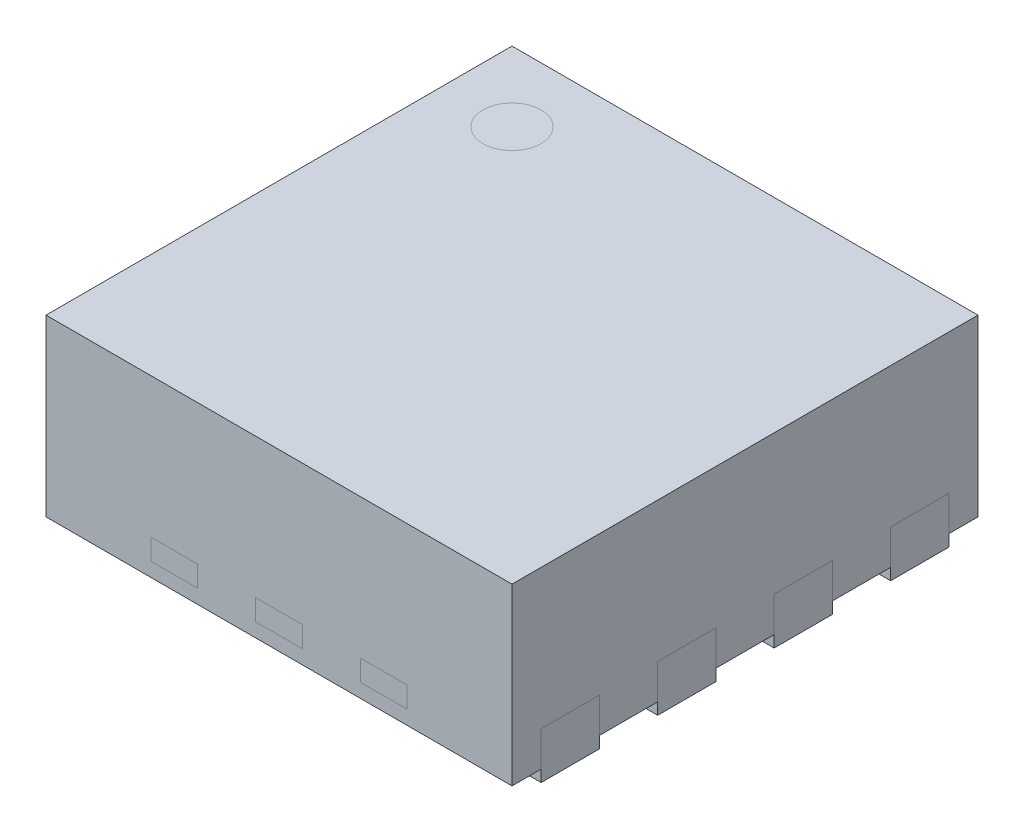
ISO-10303-21;
HEADER;
FILE_DESCRIPTION(('STEP AP214'),'2;1');
FILE_NAME('part.step','',(''),(''),'','','');
FILE_SCHEMA(('AUTOMOTIVE_DESIGN { 1 0 10303 214 1 1 1 1 }'));
ENDSEC;
DATA;
#1=APPLICATION_CONTEXT('core data for automotive mechanical design processes');
#2=APPLICATION_PROTOCOL_DEFINITION('international standard','automotive_design',2000,#1);
#3=PRODUCT_CONTEXT('',#1,'mechanical');
#4=PRODUCT('Part','Part','',(#3));
#5=PRODUCT_RELATED_PRODUCT_CATEGORY('part','',(#4));
#6=PRODUCT_DEFINITION_FORMATION('','',#4);
#7=PRODUCT_DEFINITION_CONTEXT('part definition',#1,'design');
#8=PRODUCT_DEFINITION('design','',#6,#7);
#9=PRODUCT_DEFINITION_SHAPE('','',#8);
#10=(LENGTH_UNIT() NAMED_UNIT(*) SI_UNIT(.MILLI.,.METRE.));
#11=(NAMED_UNIT(*) PLANE_ANGLE_UNIT() SI_UNIT($,.RADIAN.));
#12=(NAMED_UNIT(*) SI_UNIT($,.STERADIAN.) SOLID_ANGLE_UNIT());
#13=UNCERTAINTY_MEASURE_WITH_UNIT(LENGTH_MEASURE(1.E-05),#10,'distance_accuracy_value','');
#14=(GEOMETRIC_REPRESENTATION_CONTEXT(3) GLOBAL_UNCERTAINTY_ASSIGNED_CONTEXT((#13)) GLOBAL_UNIT_ASSIGNED_CONTEXT((#10,
#11,#12)) REPRESENTATION_CONTEXT('',''));
#15=CARTESIAN_POINT('',(0.,0.,0.));
#16=DIRECTION('',(0.,0.,1.));
#17=DIRECTION('',(1.,0.,0.));
#18=AXIS2_PLACEMENT_3D('',#15,#16,#17);
#19=CARTESIAN_POINT('',(0.,0.2,0.));
#20=DIRECTION('',(0.,-1.,0.));
#21=DIRECTION('',(0.,0.,-1.));
#22=AXIS2_PLACEMENT_3D('',#19,#20,#21);
#23=PLANE('',#22);
#24=DIRECTION('',(-1.,0.,0.));
#25=VECTOR('',#24,1.);
#26=CARTESIAN_POINT('',(-0.7,0.2,-0.625));
#27=LINE('',#26,#25);
#28=CARTESIAN_POINT('',(-0.7,0.2,-0.625));
#29=VERTEX_POINT('',#28);
#30=CARTESIAN_POINT('',(-1.,0.2,-0.625));
#31=VERTEX_POINT('',#30);
#32=EDGE_CURVE('P0_E63',#29,#31,#27,.T.);
#33=ORIENTED_EDGE('',*,*,#32,.F.);
#34=DIRECTION('',(0.,0.,1.));
#35=VECTOR('',#34,1.);
#36=CARTESIAN_POINT('',(-0.7,0.2,-0.625));
#37=LINE('',#36,#35);
#38=CARTESIAN_POINT('',(-0.7,0.2,-0.875));
#39=VERTEX_POINT('',#38);
#40=EDGE_CURVE('P0_E57',#39,#29,#37,.T.);
#41=ORIENTED_EDGE('',*,*,#40,.F.);
#42=DIRECTION('',(1.,0.,0.));
#43=VECTOR('',#42,1.);
#44=CARTESIAN_POINT('',(-0.7,0.2,-0.875));
#45=LINE('',#44,#43);
#46=CARTESIAN_POINT('',(-1.,0.2,-0.875));
#47=VERTEX_POINT('',#46);
#48=EDGE_CURVE('P0_E60',#47,#39,#45,.T.);
#49=ORIENTED_EDGE('',*,*,#48,.F.);
#50=DIRECTION('',(0.,0.,-1.));
#51=VECTOR('',#50,1.);
#52=CARTESIAN_POINT('',(-1.,0.2,-0.625));
#53=LINE('',#52,#51);
#54=EDGE_CURVE('P0_E11',#31,#47,#53,.T.);
#55=ORIENTED_EDGE('',*,*,#54,.F.);
#56=EDGE_LOOP('',(#33,#41,#49,#55));
#57=FACE_BOUND('',#56,.T.);
#58=ADVANCED_FACE('P0_F17',(#57),#23,.F.);
#59=CARTESIAN_POINT('',(-1.,0.590512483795,-0.625));
#60=DIRECTION('',(1.,0.,0.));
#61=DIRECTION('',(0.,1.,0.));
#62=AXIS2_PLACEMENT_3D('',#59,#60,#61);
#63=PLANE('',#62);
#64=DIRECTION('',(0.,-1.,0.));
#65=VECTOR('',#64,1.);
#66=CARTESIAN_POINT('',(-1.,0.590512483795,-0.625));
#67=LINE('',#66,#65);
#68=CARTESIAN_POINT('',(-1.,0.,-0.625));
#69=VERTEX_POINT('',#68);
#70=EDGE_CURVE('P0_E28',#31,#69,#67,.T.);
#71=ORIENTED_EDGE('',*,*,#70,.F.);
#72=ORIENTED_EDGE('',*,*,#54,.T.);
#73=DIRECTION('',(0.,-1.,0.));
#74=VECTOR('',#73,1.);
#75=CARTESIAN_POINT('',(-1.,0.590512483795,-0.875));
#76=LINE('',#75,#74);
#77=CARTESIAN_POINT('',(-1.,0.,-0.875));
#78=VERTEX_POINT('',#77);
#79=EDGE_CURVE('P0_E81',#47,#78,#76,.T.);
#80=ORIENTED_EDGE('',*,*,#79,.T.);
#81=DIRECTION('',(0.,0.,1.));
#82=VECTOR('',#81,1.);
#83=CARTESIAN_POINT('',(-1.,0.,-0.625));
#84=LINE('',#83,#82);
#85=EDGE_CURVE('P0_E117',#78,#69,#84,.T.);
#86=ORIENTED_EDGE('',*,*,#85,.T.);
#87=EDGE_LOOP('',(#71,#72,#80,#86));
#88=FACE_BOUND('',#87,.T.);
#89=ADVANCED_FACE('P0_F19',(#88),#63,.F.);
#90=CARTESIAN_POINT('',(-0.7,0.590512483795,-0.625));
#91=DIRECTION('',(0.,0.,-1.));
#92=DIRECTION('',(0.,-1.,0.));
#93=AXIS2_PLACEMENT_3D('',#90,#91,#92);
#94=PLANE('',#93);
#95=DIRECTION('',(0.,-1.,0.));
#96=VECTOR('',#95,1.);
#97=CARTESIAN_POINT('',(-0.7,0.590512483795,-0.625));
#98=LINE('',#97,#96);
#99=CARTESIAN_POINT('',(-0.7,0.,-0.625));
#100=VERTEX_POINT('',#99);
#101=EDGE_CURVE('P0_E21',#29,#100,#98,.T.);
#102=ORIENTED_EDGE('',*,*,#101,.F.);
#103=ORIENTED_EDGE('',*,*,#32,.T.);
#104=ORIENTED_EDGE('',*,*,#70,.T.);
#105=DIRECTION('',(1.,0.,0.));
#106=VECTOR('',#105,1.);
#107=CARTESIAN_POINT('',(-0.7,0.,-0.625));
#108=LINE('',#107,#106);
#109=EDGE_CURVE('P0_E88',#69,#100,#108,.T.);
#110=ORIENTED_EDGE('',*,*,#109,.T.);
#111=EDGE_LOOP('',(#102,#103,#104,#110));
#112=FACE_BOUND('',#111,.T.);
#113=ADVANCED_FACE('P0_F104',(#112),#94,.F.);
#114=CARTESIAN_POINT('',(-0.7,0.590512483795,-0.625));
#115=DIRECTION('',(-1.,0.,0.));
#116=DIRECTION('',(0.,0.,1.));
#117=AXIS2_PLACEMENT_3D('',#114,#115,#116);
#118=PLANE('',#117);
#119=DIRECTION('',(0.,-1.,0.));
#120=VECTOR('',#119,1.);
#121=CARTESIAN_POINT('',(-0.7,0.590512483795,-0.875));
#122=LINE('',#121,#120);
#123=CARTESIAN_POINT('',(-0.7,0.,-0.875));
#124=VERTEX_POINT('',#123);
#125=EDGE_CURVE('P0_E67',#39,#124,#122,.T.);
#126=ORIENTED_EDGE('',*,*,#125,.F.);
#127=ORIENTED_EDGE('',*,*,#40,.T.);
#128=ORIENTED_EDGE('',*,*,#101,.T.);
#129=DIRECTION('',(0.,0.,-1.));
#130=VECTOR('',#129,1.);
#131=CARTESIAN_POINT('',(-0.7,0.,-0.625));
#132=LINE('',#131,#130);
#133=EDGE_CURVE('P0_E73',#100,#124,#132,.T.);
#134=ORIENTED_EDGE('',*,*,#133,.T.);
#135=EDGE_LOOP('',(#126,#127,#128,#134));
#136=FACE_BOUND('',#135,.T.);
#137=ADVANCED_FACE('P0_F71',(#136),#118,.F.);
#138=CARTESIAN_POINT('',(-0.7,0.590512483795,-0.875));
#139=DIRECTION('',(0.,0.,1.));
#140=DIRECTION('',(1.,0.,0.));
#141=AXIS2_PLACEMENT_3D('',#138,#139,#140);
#142=PLANE('',#141);
#143=ORIENTED_EDGE('',*,*,#79,.F.);
#144=ORIENTED_EDGE('',*,*,#48,.T.);
#145=ORIENTED_EDGE('',*,*,#125,.T.);
#146=DIRECTION('',(-1.,0.,0.));
#147=VECTOR('',#146,1.);
#148=CARTESIAN_POINT('',(-0.7,0.,-0.875));
#149=LINE('',#148,#147);
#150=EDGE_CURVE('P0_E111',#124,#78,#149,.T.);
#151=ORIENTED_EDGE('',*,*,#150,.T.);
#152=EDGE_LOOP('',(#143,#144,#145,#151));
#153=FACE_BOUND('',#152,.T.);
#154=ADVANCED_FACE('P0_F79',(#153),#142,.F.);
#155=CARTESIAN_POINT('',(0.,0.,0.));
#156=DIRECTION('',(0.,1.,0.));
#157=DIRECTION('',(1.,0.,0.));
#158=AXIS2_PLACEMENT_3D('',#155,#156,#157);
#159=PLANE('',#158);
#160=ORIENTED_EDGE('',*,*,#85,.F.);
#161=ORIENTED_EDGE('',*,*,#150,.F.);
#162=ORIENTED_EDGE('',*,*,#133,.F.);
#163=ORIENTED_EDGE('',*,*,#109,.F.);
#164=EDGE_LOOP('',(#160,#161,#162,#163));
#165=FACE_BOUND('',#164,.T.);
#166=ADVANCED_FACE('P0_F110',(#165),#159,.F.);
#167=CLOSED_SHELL('',(#58,#89,#113,#137,#154,#166));
#168=MANIFOLD_SOLID_BREP('P0_B1',#167);
#169=CARTESIAN_POINT('',(0.1,0.2,-1.));
#170=DIRECTION('',(1.,0.,0.));
#171=DIRECTION('',(0.,-1.,0.));
#172=AXIS2_PLACEMENT_3D('',#169,#170,#171);
#173=PLANE('',#172);
#174=DIRECTION('',(0.,0.,1.));
#175=VECTOR('',#174,1.);
#176=CARTESIAN_POINT('',(0.1,0.2,-1.));
#177=LINE('',#176,#175);
#178=CARTESIAN_POINT('',(0.1,0.2,0.8));
#179=VERTEX_POINT('',#178);
#180=CARTESIAN_POINT('',(0.1,0.2,1.));
#181=VERTEX_POINT('',#180);
#182=EDGE_CURVE('P1_E423',#179,#181,#177,.T.);
#183=ORIENTED_EDGE('',*,*,#182,.F.);
#184=DIRECTION('',(0.,1.,0.));
#185=VECTOR('',#184,1.);
#186=CARTESIAN_POINT('',(0.1,2.035755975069,0.8));
#187=LINE('',#186,#185);
#188=CARTESIAN_POINT('',(0.1,0.11,0.8));
#189=VERTEX_POINT('',#188);
#190=EDGE_CURVE('P1_E771',#189,#179,#187,.T.);
#191=ORIENTED_EDGE('',*,*,#190,.F.);
#192=DIRECTION('',(0.,0.,1.));
#193=VECTOR('',#192,1.);
#194=CARTESIAN_POINT('',(0.1,0.11,-1.));
#195=LINE('',#194,#193);
#196=CARTESIAN_POINT('',(0.1,0.11,1.));
#197=VERTEX_POINT('',#196);
#198=EDGE_CURVE('P1_E27',#189,#197,#195,.T.);
#199=ORIENTED_EDGE('',*,*,#198,.T.);
#200=DIRECTION('',(0.,-1.,0.));
#201=VECTOR('',#200,1.);
#202=CARTESIAN_POINT('',(0.1,4.428427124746,1.));
#203=LINE('',#202,#201);
#204=EDGE_CURVE('P1_E441',#181,#197,#203,.T.);
#205=ORIENTED_EDGE('',*,*,#204,.F.);
#206=EDGE_LOOP('',(#183,#191,#199,#205));
#207=FACE_BOUND('',#206,.T.);
#208=ADVANCED_FACE('P1_F17',(#207),#173,.F.);
#209=CARTESIAN_POINT('',(-0.1,0.2,-1.));
#210=DIRECTION('',(-1.,0.,0.));
#211=DIRECTION('',(0.,1.,0.));
#212=AXIS2_PLACEMENT_3D('',#209,#210,#211);
#213=PLANE('',#212);
#214=DIRECTION('',(0.,0.,1.));
#215=VECTOR('',#214,1.);
#216=CARTESIAN_POINT('',(-0.1,0.11,-1.));
#217=LINE('',#216,#215);
#218=CARTESIAN_POINT('',(-0.1,0.11,0.8));
#219=VERTEX_POINT('',#218);
#220=CARTESIAN_POINT('',(-0.1,0.11,1.));
#221=VERTEX_POINT('',#220);
#222=EDGE_CURVE('P1_E11',#219,#221,#217,.T.);
#223=ORIENTED_EDGE('',*,*,#222,.F.);
#224=DIRECTION('',(0.,-1.,0.));
#225=VECTOR('',#224,1.);
#226=CARTESIAN_POINT('',(-0.1,2.035755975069,0.8));
#227=LINE('',#226,#225);
#228=CARTESIAN_POINT('',(-0.1,0.2,0.8));
#229=VERTEX_POINT('',#228);
#230=EDGE_CURVE('P1_E686',#229,#219,#227,.T.);
#231=ORIENTED_EDGE('',*,*,#230,.F.);
#232=DIRECTION('',(0.,0.,1.));
#233=VECTOR('',#232,1.);
#234=CARTESIAN_POINT('',(-0.1,0.2,-1.));
#235=LINE('',#234,#233);
#236=CARTESIAN_POINT('',(-0.1,0.2,1.));
#237=VERTEX_POINT('',#236);
#238=EDGE_CURVE('P1_E437',#229,#237,#235,.T.);
#239=ORIENTED_EDGE('',*,*,#238,.T.);
#240=DIRECTION('',(0.,1.,0.));
#241=VECTOR('',#240,1.);
#242=CARTESIAN_POINT('',(-0.1,4.428427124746,1.));
#243=LINE('',#242,#241);
#244=EDGE_CURVE('P1_E451',#221,#237,#243,.T.);
#245=ORIENTED_EDGE('',*,*,#244,.F.);
#246=EDGE_LOOP('',(#223,#231,#239,#245));
#247=FACE_BOUND('',#246,.T.);
#248=ADVANCED_FACE('P1_F19',(#247),#213,.F.);
#249=CARTESIAN_POINT('',(-0.1,0.11,-1.));
#250=DIRECTION('',(0.,-1.,0.));
#251=DIRECTION('',(0.,0.,-1.));
#252=AXIS2_PLACEMENT_3D('',#249,#250,#251);
#253=PLANE('',#252);
#254=ORIENTED_EDGE('',*,*,#198,.F.);
#255=DIRECTION('',(1.,0.,0.));
#256=VECTOR('',#255,1.);
#257=CARTESIAN_POINT('',(0.45,0.11,0.8));
#258=LINE('',#257,#256);
#259=EDGE_CURVE('P1_E775',#219,#189,#258,.T.);
#260=ORIENTED_EDGE('',*,*,#259,.F.);
#261=ORIENTED_EDGE('',*,*,#222,.T.);
#262=DIRECTION('',(-1.,0.,0.));
#263=VECTOR('',#262,1.);
#264=CARTESIAN_POINT('',(1.,0.11,1.));
#265=LINE('',#264,#263);
#266=EDGE_CURVE('P1_E458',#197,#221,#265,.T.);
#267=ORIENTED_EDGE('',*,*,#266,.F.);
#268=EDGE_LOOP('',(#254,#260,#261,#267));
#269=FACE_BOUND('',#268,.T.);
#270=ADVANCED_FACE('P1_F1872',(#269),#253,.F.);
#271=CARTESIAN_POINT('',(0.35,0.2,-1.));
#272=DIRECTION('',(-1.,0.,0.));
#273=DIRECTION('',(0.,1.,0.));
#274=AXIS2_PLACEMENT_3D('',#271,#272,#273);
#275=PLANE('',#274);
#276=DIRECTION('',(0.,0.,1.));
#277=VECTOR('',#276,1.);
#278=CARTESIAN_POINT('',(0.35,0.11,-1.));
#279=LINE('',#278,#277);
#280=CARTESIAN_POINT('',(0.35,0.11,-1.));
#281=VERTEX_POINT('',#280);
#282=CARTESIAN_POINT('',(0.35,0.11,-0.8));
#283=VERTEX_POINT('',#282);
#284=EDGE_CURVE('P1_E1054',#281,#283,#279,.T.);
#285=ORIENTED_EDGE('',*,*,#284,.F.);
#286=DIRECTION('',(0.,-1.,0.));
#287=VECTOR('',#286,1.);
#288=CARTESIAN_POINT('',(0.35,0.2,-1.));
#289=LINE('',#288,#287);
#290=CARTESIAN_POINT('',(0.35,0.2,-1.));
#291=VERTEX_POINT('',#290);
#292=EDGE_CURVE('P1_E552',#291,#281,#289,.T.);
#293=ORIENTED_EDGE('',*,*,#292,.F.);
#294=DIRECTION('',(0.,0.,1.));
#295=VECTOR('',#294,1.);
#296=CARTESIAN_POINT('',(0.35,0.2,-1.));
#297=LINE('',#296,#295);
#298=CARTESIAN_POINT('',(0.35,0.2,-0.8));
#299=VERTEX_POINT('',#298);
#300=EDGE_CURVE('P1_E873',#291,#299,#297,.T.);
#301=ORIENTED_EDGE('',*,*,#300,.T.);
#302=DIRECTION('',(0.,1.,0.));
#303=VECTOR('',#302,1.);
#304=CARTESIAN_POINT('',(0.35,2.035755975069,-0.8));
#305=LINE('',#304,#303);
#306=EDGE_CURVE('P1_E814',#283,#299,#305,.T.);
#307=ORIENTED_EDGE('',*,*,#306,.F.);
#308=EDGE_LOOP('',(#285,#293,#301,#307));
#309=FACE_BOUND('',#308,.T.);
#310=ADVANCED_FACE('P1_F1909',(#309),#275,.F.);
#311=CARTESIAN_POINT('',(0.35,0.2,-1.));
#312=DIRECTION('',(-1.,0.,0.));
#313=DIRECTION('',(0.,1.,0.));
#314=AXIS2_PLACEMENT_3D('',#311,#312,#313);
#315=PLANE('',#314);
#316=DIRECTION('',(0.,0.,1.));
#317=VECTOR('',#316,1.);
#318=CARTESIAN_POINT('',(0.35,0.11,-1.));
#319=LINE('',#318,#317);
#320=CARTESIAN_POINT('',(0.35,0.11,0.8));
#321=VERTEX_POINT('',#320);
#322=CARTESIAN_POINT('',(0.35,0.11,1.));
#323=VERTEX_POINT('',#322);
#324=EDGE_CURVE('P1_E1057',#321,#323,#319,.T.);
#325=ORIENTED_EDGE('',*,*,#324,.F.);
#326=DIRECTION('',(0.,-1.,0.));
#327=VECTOR('',#326,1.);
#328=CARTESIAN_POINT('',(0.35,2.035755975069,0.8));
#329=LINE('',#328,#327);
#330=CARTESIAN_POINT('',(0.35,0.2,0.8));
#331=VERTEX_POINT('',#330);
#332=EDGE_CURVE('P1_E692',#331,#321,#329,.T.);
#333=ORIENTED_EDGE('',*,*,#332,.F.);
#334=DIRECTION('',(0.,0.,1.));
#335=VECTOR('',#334,1.);
#336=CARTESIAN_POINT('',(0.35,0.2,-1.));
#337=LINE('',#336,#335);
#338=CARTESIAN_POINT('',(0.35,0.2,1.));
#339=VERTEX_POINT('',#338);
#340=EDGE_CURVE('P1_E438',#331,#339,#337,.T.);
#341=ORIENTED_EDGE('',*,*,#340,.T.);
#342=DIRECTION('',(0.,1.,0.));
#343=VECTOR('',#342,1.);
#344=CARTESIAN_POINT('',(0.35,4.428427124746,1.));
#345=LINE('',#344,#343);
#346=EDGE_CURVE('P1_E705',#323,#339,#345,.T.);
#347=ORIENTED_EDGE('',*,*,#346,.F.);
#348=EDGE_LOOP('',(#325,#333,#341,#347));
#349=FACE_BOUND('',#348,.T.);
#350=ADVANCED_FACE('P1_F1905',(#349),#315,.F.);
#351=CARTESIAN_POINT('',(0.35,0.11,-1.));
#352=DIRECTION('',(0.,-1.,0.));
#353=DIRECTION('',(0.,0.,-1.));
#354=AXIS2_PLACEMENT_3D('',#351,#352,#353);
#355=PLANE('',#354);
#356=DIRECTION('',(0.,0.,1.));
#357=VECTOR('',#356,1.);
#358=CARTESIAN_POINT('',(0.55,0.11,-1.));
#359=LINE('',#358,#357);
#360=CARTESIAN_POINT('',(0.55,0.11,-1.));
#361=VERTEX_POINT('',#360);
#362=CARTESIAN_POINT('',(0.55,0.11,1.));
#363=VERTEX_POINT('',#362);
#364=EDGE_CURVE('P1_E1050',#361,#363,#359,.T.);
#365=ORIENTED_EDGE('',*,*,#364,.F.);
#366=DIRECTION('',(1.,0.,0.));
#367=VECTOR('',#366,1.);
#368=CARTESIAN_POINT('',(0.35,0.11,-1.));
#369=LINE('',#368,#367);
#370=EDGE_CURVE('P1_E640',#281,#361,#369,.T.);
#371=ORIENTED_EDGE('',*,*,#370,.F.);
#372=ORIENTED_EDGE('',*,*,#284,.T.);
#373=DIRECTION('',(-1.,0.,0.));
#374=VECTOR('',#373,1.);
#375=CARTESIAN_POINT('',(0.45,0.11,-0.8));
#376=LINE('',#375,#374);
#377=CARTESIAN_POINT('',(0.45,0.11,-0.8));
#378=VERTEX_POINT('',#377);
#379=EDGE_CURVE('P1_E880',#378,#283,#376,.T.);
#380=ORIENTED_EDGE('',*,*,#379,.F.);
#381=DIRECTION('',(0.,0.,-1.));
#382=VECTOR('',#381,1.);
#383=CARTESIAN_POINT('',(0.45,0.11,-0.8));
#384=LINE('',#383,#382);
#385=CARTESIAN_POINT('',(0.45,0.11,0.8));
#386=VERTEX_POINT('',#385);
#387=EDGE_CURVE('P1_E774',#386,#378,#384,.T.);
#388=ORIENTED_EDGE('',*,*,#387,.F.);
#389=DIRECTION('',(1.,0.,0.));
#390=VECTOR('',#389,1.);
#391=CARTESIAN_POINT('',(0.45,0.11,0.8));
#392=LINE('',#391,#390);
#393=EDGE_CURVE('P1_E696',#321,#386,#392,.T.);
#394=ORIENTED_EDGE('',*,*,#393,.F.);
#395=ORIENTED_EDGE('',*,*,#324,.T.);
#396=DIRECTION('',(-1.,0.,0.));
#397=VECTOR('',#396,1.);
#398=CARTESIAN_POINT('',(1.,0.11,1.));
#399=LINE('',#398,#397);
#400=EDGE_CURVE('P1_E745',#363,#323,#399,.T.);
#401=ORIENTED_EDGE('',*,*,#400,.F.);
#402=EDGE_LOOP('',(#365,#371,#372,#380,#388,#394,#395,#401));
#403=FACE_BOUND('',#402,.T.);
#404=ADVANCED_FACE('P1_F1908',(#403),#355,.F.);
#405=CARTESIAN_POINT('',(0.55,0.2,-1.));
#406=DIRECTION('',(1.,0.,0.));
#407=DIRECTION('',(0.,-1.,0.));
#408=AXIS2_PLACEMENT_3D('',#405,#406,#407);
#409=PLANE('',#408);
#410=DIRECTION('',(0.,0.,1.));
#411=VECTOR('',#410,1.);
#412=CARTESIAN_POINT('',(0.55,0.2,-1.));
#413=LINE('',#412,#411);
#414=CARTESIAN_POINT('',(0.55,0.2,-1.));
#415=VERTEX_POINT('',#414);
#416=CARTESIAN_POINT('',(0.55,0.2,1.));
#417=VERTEX_POINT('',#416);
#418=EDGE_CURVE('P1_E876',#415,#417,#413,.T.);
#419=ORIENTED_EDGE('',*,*,#418,.F.);
#420=DIRECTION('',(0.,1.,0.));
#421=VECTOR('',#420,1.);
#422=CARTESIAN_POINT('',(0.55,0.2,-1.));
#423=LINE('',#422,#421);
#424=EDGE_CURVE('P1_E635',#361,#415,#423,.T.);
#425=ORIENTED_EDGE('',*,*,#424,.F.);
#426=ORIENTED_EDGE('',*,*,#364,.T.);
#427=DIRECTION('',(0.,-1.,0.));
#428=VECTOR('',#427,1.);
#429=CARTESIAN_POINT('',(0.55,4.428427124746,1.));
#430=LINE('',#429,#428);
#431=EDGE_CURVE('P1_E704',#417,#363,#430,.T.);
#432=ORIENTED_EDGE('',*,*,#431,.F.);
#433=EDGE_LOOP('',(#419,#425,#426,#432));
#434=FACE_BOUND('',#433,.T.);
#435=ADVANCED_FACE('P1_F1903',(#434),#409,.F.);
#436=CARTESIAN_POINT('',(-0.1,0.2,-1.));
#437=DIRECTION('',(-1.,0.,0.));
#438=DIRECTION('',(0.,1.,0.));
#439=AXIS2_PLACEMENT_3D('',#436,#437,#438);
#440=PLANE('',#439);
#441=DIRECTION('',(0.,0.,1.));
#442=VECTOR('',#441,1.);
#443=CARTESIAN_POINT('',(-0.1,0.11,-1.));
#444=LINE('',#443,#442);
#445=CARTESIAN_POINT('',(-0.1,0.11,-1.));
#446=VERTEX_POINT('',#445);
#447=CARTESIAN_POINT('',(-0.1,0.11,-0.8));
#448=VERTEX_POINT('',#447);
#449=EDGE_CURVE('P1_E1047',#446,#448,#444,.T.);
#450=ORIENTED_EDGE('',*,*,#449,.F.);
#451=DIRECTION('',(0.,-1.,0.));
#452=VECTOR('',#451,1.);
#453=CARTESIAN_POINT('',(-0.1,0.2,-1.));
#454=LINE('',#453,#452);
#455=CARTESIAN_POINT('',(-0.1,0.2,-1.));
#456=VERTEX_POINT('',#455);
#457=EDGE_CURVE('P1_E506',#456,#446,#454,.T.);
#458=ORIENTED_EDGE('',*,*,#457,.F.);
#459=DIRECTION('',(0.,0.,1.));
#460=VECTOR('',#459,1.);
#461=CARTESIAN_POINT('',(-0.1,0.2,-1.));
#462=LINE('',#461,#460);
#463=CARTESIAN_POINT('',(-0.1,0.2,-0.8));
#464=VERTEX_POINT('',#463);
#465=EDGE_CURVE('P1_E931',#456,#464,#462,.T.);
#466=ORIENTED_EDGE('',*,*,#465,.T.);
#467=DIRECTION('',(0.,1.,0.));
#468=VECTOR('',#467,1.);
#469=CARTESIAN_POINT('',(-0.1,2.035755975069,-0.8));
#470=LINE('',#469,#468);
#471=EDGE_CURVE('P1_E899',#448,#464,#470,.T.);
#472=ORIENTED_EDGE('',*,*,#471,.F.);
#473=EDGE_LOOP('',(#450,#458,#466,#472));
#474=FACE_BOUND('',#473,.T.);
#475=ADVANCED_FACE('P1_F1899',(#474),#440,.F.);
#476=CARTESIAN_POINT('',(0.1,0.2,-1.));
#477=DIRECTION('',(1.,0.,0.));
#478=DIRECTION('',(0.,-1.,0.));
#479=AXIS2_PLACEMENT_3D('',#476,#477,#478);
#480=PLANE('',#479);
#481=DIRECTION('',(0.,0.,1.));
#482=VECTOR('',#481,1.);
#483=CARTESIAN_POINT('',(0.1,0.2,-1.));
#484=LINE('',#483,#482);
#485=CARTESIAN_POINT('',(0.1,0.2,-1.));
#486=VERTEX_POINT('',#485);
#487=CARTESIAN_POINT('',(0.1,0.2,-0.8));
#488=VERTEX_POINT('',#487);
#489=EDGE_CURVE('P1_E877',#486,#488,#484,.T.);
#490=ORIENTED_EDGE('',*,*,#489,.F.);
#491=DIRECTION('',(0.,1.,0.));
#492=VECTOR('',#491,1.);
#493=CARTESIAN_POINT('',(0.1,0.2,-1.));
#494=LINE('',#493,#492);
#495=CARTESIAN_POINT('',(0.1,0.11,-1.));
#496=VERTEX_POINT('',#495);
#497=EDGE_CURVE('P1_E541',#496,#486,#494,.T.);
#498=ORIENTED_EDGE('',*,*,#497,.F.);
#499=DIRECTION('',(0.,0.,1.));
#500=VECTOR('',#499,1.);
#501=CARTESIAN_POINT('',(0.1,0.11,-1.));
#502=LINE('',#501,#500);
#503=CARTESIAN_POINT('',(0.1,0.11,-0.8));
#504=VERTEX_POINT('',#503);
#505=EDGE_CURVE('P1_E1044',#496,#504,#502,.T.);
#506=ORIENTED_EDGE('',*,*,#505,.T.);
#507=DIRECTION('',(0.,-1.,0.));
#508=VECTOR('',#507,1.);
#509=CARTESIAN_POINT('',(0.1,2.035755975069,-0.8));
#510=LINE('',#509,#508);
#511=EDGE_CURVE('P1_E813',#488,#504,#510,.T.);
#512=ORIENTED_EDGE('',*,*,#511,.F.);
#513=EDGE_LOOP('',(#490,#498,#506,#512));
#514=FACE_BOUND('',#513,.T.);
#515=ADVANCED_FACE('P1_F1895',(#514),#480,.F.);
#516=CARTESIAN_POINT('',(-0.1,0.11,-1.));
#517=DIRECTION('',(0.,-1.,0.));
#518=DIRECTION('',(0.,0.,-1.));
#519=AXIS2_PLACEMENT_3D('',#516,#517,#518);
#520=PLANE('',#519);
#521=ORIENTED_EDGE('',*,*,#505,.F.);
#522=DIRECTION('',(1.,0.,0.));
#523=VECTOR('',#522,1.);
#524=CARTESIAN_POINT('',(-0.1,0.11,-1.));
#525=LINE('',#524,#523);
#526=EDGE_CURVE('P1_E660',#446,#496,#525,.T.);
#527=ORIENTED_EDGE('',*,*,#526,.F.);
#528=ORIENTED_EDGE('',*,*,#449,.T.);
#529=DIRECTION('',(-1.,0.,0.));
#530=VECTOR('',#529,1.);
#531=CARTESIAN_POINT('',(0.45,0.11,-0.8));
#532=LINE('',#531,#530);
#533=EDGE_CURVE('P1_E895',#504,#448,#532,.T.);
#534=ORIENTED_EDGE('',*,*,#533,.F.);
#535=EDGE_LOOP('',(#521,#527,#528,#534));
#536=FACE_BOUND('',#535,.T.);
#537=ADVANCED_FACE('P1_F1892',(#536),#520,.F.);
#538=CARTESIAN_POINT('',(-0.35,0.2,-1.));
#539=DIRECTION('',(1.,0.,0.));
#540=DIRECTION('',(0.,-1.,0.));
#541=AXIS2_PLACEMENT_3D('',#538,#539,#540);
#542=PLANE('',#541);
#543=DIRECTION('',(0.,0.,1.));
#544=VECTOR('',#543,1.);
#545=CARTESIAN_POINT('',(-0.35,0.2,-1.));
#546=LINE('',#545,#544);
#547=CARTESIAN_POINT('',(-0.35,0.2,-1.));
#548=VERTEX_POINT('',#547);
#549=CARTESIAN_POINT('',(-0.35,0.2,-0.65));
#550=VERTEX_POINT('',#549);
#551=EDGE_CURVE('P1_E928',#548,#550,#546,.T.);
#552=ORIENTED_EDGE('',*,*,#551,.F.);
#553=DIRECTION('',(0.,1.,0.));
#554=VECTOR('',#553,1.);
#555=CARTESIAN_POINT('',(-0.35,0.2,-1.));
#556=LINE('',#555,#554);
#557=CARTESIAN_POINT('',(-0.35,0.11,-1.));
#558=VERTEX_POINT('',#557);
#559=EDGE_CURVE('P1_E639',#558,#548,#556,.T.);
#560=ORIENTED_EDGE('',*,*,#559,.F.);
#561=DIRECTION('',(0.,0.,1.));
#562=VECTOR('',#561,1.);
#563=CARTESIAN_POINT('',(-0.35,0.11,-1.));
#564=LINE('',#563,#562);
#565=CARTESIAN_POINT('',(-0.35,0.11,-0.65));
#566=VERTEX_POINT('',#565);
#567=EDGE_CURVE('P1_E1041',#558,#566,#564,.T.);
#568=ORIENTED_EDGE('',*,*,#567,.T.);
#569=DIRECTION('',(0.,-1.,0.));
#570=VECTOR('',#569,1.);
#571=CARTESIAN_POINT('',(-0.35,2.035755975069,-0.65));
#572=LINE('',#571,#570);
#573=EDGE_CURVE('P1_E915',#550,#566,#572,.T.);
#574=ORIENTED_EDGE('',*,*,#573,.F.);
#575=EDGE_LOOP('',(#552,#560,#568,#574));
#576=FACE_BOUND('',#575,.T.);
#577=ADVANCED_FACE('P1_F1890',(#576),#542,.F.);
#578=CARTESIAN_POINT('',(-0.35,0.2,-1.));
#579=DIRECTION('',(1.,0.,0.));
#580=DIRECTION('',(0.,-1.,0.));
#581=AXIS2_PLACEMENT_3D('',#578,#579,#580);
#582=PLANE('',#581);
#583=DIRECTION('',(0.,0.,1.));
#584=VECTOR('',#583,1.);
#585=CARTESIAN_POINT('',(-0.35,0.2,-1.));
#586=LINE('',#585,#584);
#587=CARTESIAN_POINT('',(-0.35,0.2,0.8));
#588=VERTEX_POINT('',#587);
#589=CARTESIAN_POINT('',(-0.35,0.2,1.));
#590=VERTEX_POINT('',#589);
#591=EDGE_CURVE('P1_E922',#588,#590,#586,.T.);
#592=ORIENTED_EDGE('',*,*,#591,.F.);
#593=DIRECTION('',(0.,1.,0.));
#594=VECTOR('',#593,1.);
#595=CARTESIAN_POINT('',(-0.35,2.035755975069,0.8));
#596=LINE('',#595,#594);
#597=CARTESIAN_POINT('',(-0.35,0.11,0.8));
#598=VERTEX_POINT('',#597);
#599=EDGE_CURVE('P1_E629',#598,#588,#596,.T.);
#600=ORIENTED_EDGE('',*,*,#599,.F.);
#601=DIRECTION('',(0.,0.,1.));
#602=VECTOR('',#601,1.);
#603=CARTESIAN_POINT('',(-0.35,0.11,-1.));
#604=LINE('',#603,#602);
#605=CARTESIAN_POINT('',(-0.35,0.11,1.));
#606=VERTEX_POINT('',#605);
#607=EDGE_CURVE('P1_E1038',#598,#606,#604,.T.);
#608=ORIENTED_EDGE('',*,*,#607,.T.);
#609=DIRECTION('',(0.,-1.,0.));
#610=VECTOR('',#609,1.);
#611=CARTESIAN_POINT('',(-0.35,4.428427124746,1.));
#612=LINE('',#611,#610);
#613=EDGE_CURVE('P1_E611',#590,#606,#612,.T.);
#614=ORIENTED_EDGE('',*,*,#613,.F.);
#615=EDGE_LOOP('',(#592,#600,#608,#614));
#616=FACE_BOUND('',#615,.T.);
#617=ADVANCED_FACE('P1_F1886',(#616),#582,.F.);
#618=CARTESIAN_POINT('',(-0.35,0.11,-1.));
#619=DIRECTION('',(0.,-1.,0.));
#620=DIRECTION('',(0.,0.,-1.));
#621=AXIS2_PLACEMENT_3D('',#618,#619,#620);
#622=PLANE('',#621);
#623=ORIENTED_EDGE('',*,*,#607,.F.);
#624=DIRECTION('',(1.,0.,0.));
#625=VECTOR('',#624,1.);
#626=CARTESIAN_POINT('',(0.45,0.11,0.8));
#627=LINE('',#626,#625);
#628=CARTESIAN_POINT('',(-0.45,0.11,0.8));
#629=VERTEX_POINT('',#628);
#630=EDGE_CURVE('P1_E625',#629,#598,#627,.T.);
#631=ORIENTED_EDGE('',*,*,#630,.F.);
#632=DIRECTION('',(0.,0.,1.));
#633=VECTOR('',#632,1.);
#634=CARTESIAN_POINT('',(-0.45,0.11,-0.55));
#635=LINE('',#634,#633);
#636=CARTESIAN_POINT('',(-0.45,0.11,-0.55));
#637=VERTEX_POINT('',#636);
#638=EDGE_CURVE('P1_E770',#637,#629,#635,.T.);
#639=ORIENTED_EDGE('',*,*,#638,.F.);
#640=DIRECTION('',(-0.707106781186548,0.,0.707106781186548));
#641=VECTOR('',#640,1.);
#642=CARTESIAN_POINT('',(-0.2,0.11,-0.8));
#643=LINE('',#642,#641);
#644=EDGE_CURVE('P1_E919',#566,#637,#643,.T.);
#645=ORIENTED_EDGE('',*,*,#644,.F.);
#646=ORIENTED_EDGE('',*,*,#567,.F.);
#647=DIRECTION('',(1.,0.,0.));
#648=VECTOR('',#647,1.);
#649=CARTESIAN_POINT('',(-0.35,0.11,-1.));
#650=LINE('',#649,#648);
#651=CARTESIAN_POINT('',(-0.55,0.11,-1.));
#652=VERTEX_POINT('',#651);
#653=EDGE_CURVE('P1_E507',#652,#558,#650,.T.);
#654=ORIENTED_EDGE('',*,*,#653,.F.);
#655=DIRECTION('',(0.,0.,1.));
#656=VECTOR('',#655,1.);
#657=CARTESIAN_POINT('',(-0.55,0.11,-1.));
#658=LINE('',#657,#656);
#659=CARTESIAN_POINT('',(-0.55,0.11,1.));
#660=VERTEX_POINT('',#659);
#661=EDGE_CURVE('P1_E1034',#652,#660,#658,.T.);
#662=ORIENTED_EDGE('',*,*,#661,.T.);
#663=DIRECTION('',(-1.,0.,0.));
#664=VECTOR('',#663,1.);
#665=CARTESIAN_POINT('',(1.,0.11,1.));
#666=LINE('',#665,#664);
#667=EDGE_CURVE('P1_E796',#606,#660,#666,.T.);
#668=ORIENTED_EDGE('',*,*,#667,.F.);
#669=EDGE_LOOP('',(#623,#631,#639,#645,#646,#654,#662,#668));
#670=FACE_BOUND('',#669,.T.);
#671=ADVANCED_FACE('P1_F1883',(#670),#622,.F.);
#672=CARTESIAN_POINT('',(-0.55,0.2,-1.));
#673=DIRECTION('',(-1.,0.,0.));
#674=DIRECTION('',(0.,1.,0.));
#675=AXIS2_PLACEMENT_3D('',#672,#673,#674);
#676=PLANE('',#675);
#677=ORIENTED_EDGE('',*,*,#661,.F.);
#678=DIRECTION('',(0.,-1.,0.));
#679=VECTOR('',#678,1.);
#680=CARTESIAN_POINT('',(-0.55,0.2,-1.));
#681=LINE('',#680,#679);
#682=CARTESIAN_POINT('',(-0.55,0.2,-1.));
#683=VERTEX_POINT('',#682);
#684=EDGE_CURVE('P1_E574',#683,#652,#681,.T.);
#685=ORIENTED_EDGE('',*,*,#684,.F.);
#686=DIRECTION('',(0.,0.,1.));
#687=VECTOR('',#686,1.);
#688=CARTESIAN_POINT('',(-0.55,0.2,-1.));
#689=LINE('',#688,#687);
#690=CARTESIAN_POINT('',(-0.55,0.2,1.));
#691=VERTEX_POINT('',#690);
#692=EDGE_CURVE('P1_E925',#683,#691,#689,.T.);
#693=ORIENTED_EDGE('',*,*,#692,.T.);
#694=DIRECTION('',(0.,1.,0.));
#695=VECTOR('',#694,1.);
#696=CARTESIAN_POINT('',(-0.55,4.428427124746,1.));
#697=LINE('',#696,#695);
#698=EDGE_CURVE('P1_E612',#660,#691,#697,.T.);
#699=ORIENTED_EDGE('',*,*,#698,.F.);
#700=EDGE_LOOP('',(#677,#685,#693,#699));
#701=FACE_BOUND('',#700,.T.);
#702=ADVANCED_FACE('P1_F1881',(#701),#676,.F.);
#703=CARTESIAN_POINT('',(-0.7,0.7,-0.7));
#704=DIRECTION('',(0.,1.,0.));
#705=DIRECTION('',(1.,0.,0.));
#706=AXIS2_PLACEMENT_3D('',#703,#704,#705);
#707=PLANE('',#706);
#708=CARTESIAN_POINT('',(-0.7,0.7,-0.7));
#709=DIRECTION('',(0.,1.,0.));
#710=DIRECTION('',(0.,0.,1.));
#711=AXIS2_PLACEMENT_3D('',#708,#709,#710);
#712=CIRCLE('',#711,0.125);
#713=CARTESIAN_POINT('',(-0.7,0.7,-0.575));
#714=VERTEX_POINT('',#713);
#715=CARTESIAN_POINT('',(-0.7,0.7,-0.825));
#716=VERTEX_POINT('',#715);
#717=EDGE_CURVE('P1_E1030',#714,#716,#712,.T.);
#718=ORIENTED_EDGE('',*,*,#717,.T.);
#719=CARTESIAN_POINT('',(-0.7,0.7,-0.7));
#720=DIRECTION('',(0.,1.,0.));
#721=DIRECTION('',(0.,0.,1.));
#722=AXIS2_PLACEMENT_3D('',#719,#720,#721);
#723=CIRCLE('',#722,0.125);
#724=EDGE_CURVE('P1_E1577',#716,#714,#723,.T.);
#725=ORIENTED_EDGE('',*,*,#724,.T.);
#726=EDGE_LOOP('',(#718,#725));
#727=FACE_BOUND('',#726,.T.);
#728=ADVANCED_FACE('P1_F1878',(#727),#707,.T.);
#729=CARTESIAN_POINT('',(-0.7,0.7,-0.7));
#730=DIRECTION('',(0.,1.,0.));
#731=DIRECTION('',(0.,0.,1.));
#732=AXIS2_PLACEMENT_3D('',#729,#730,#731);
#733=CYLINDRICAL_SURFACE('',#732,0.125);
#734=DIRECTION('',(0.,1.,0.));
#735=VECTOR('',#734,1.);
#736=CARTESIAN_POINT('',(-0.7,0.7,-0.825));
#737=LINE('',#736,#735);
#738=CARTESIAN_POINT('',(-0.7,0.8,-0.825));
#739=VERTEX_POINT('',#738);
#740=EDGE_CURVE('P1_E1574',#716,#739,#737,.T.);
#741=ORIENTED_EDGE('',*,*,#740,.F.);
#742=ORIENTED_EDGE('',*,*,#717,.F.);
#743=DIRECTION('',(0.,1.,0.));
#744=VECTOR('',#743,1.);
#745=CARTESIAN_POINT('',(-0.7,0.7,-0.575));
#746=LINE('',#745,#744);
#747=CARTESIAN_POINT('',(-0.7,0.8,-0.575));
#748=VERTEX_POINT('',#747);
#749=EDGE_CURVE('P1_E1591',#714,#748,#746,.T.);
#750=ORIENTED_EDGE('',*,*,#749,.T.);
#751=CARTESIAN_POINT('',(-0.7,0.8,-0.7));
#752=DIRECTION('',(0.,1.,0.));
#753=DIRECTION('',(0.,0.,1.));
#754=AXIS2_PLACEMENT_3D('',#751,#752,#753);
#755=CIRCLE('',#754,0.125);
#756=EDGE_CURVE('P1_E540',#748,#739,#755,.T.);
#757=ORIENTED_EDGE('',*,*,#756,.T.);
#758=EDGE_LOOP('',(#741,#742,#750,#757));
#759=FACE_BOUND('',#758,.T.);
#760=ADVANCED_FACE('P1_F1876',(#759),#733,.F.);
#761=CARTESIAN_POINT('',(0.,0.2,1.5));
#762=DIRECTION('',(0.,1.,0.));
#763=DIRECTION('',(1.,0.,0.));
#764=AXIS2_PLACEMENT_3D('',#761,#762,#763);
#765=PLANE('',#764);
#766=DIRECTION('',(0.,0.,1.));
#767=VECTOR('',#766,1.);
#768=CARTESIAN_POINT('',(-1.,0.2,0.875));
#769=LINE('',#768,#767);
#770=CARTESIAN_POINT('',(-1.,0.2,0.625));
#771=VERTEX_POINT('',#770);
#772=CARTESIAN_POINT('',(-1.,0.2,0.875));
#773=VERTEX_POINT('',#772);
#774=EDGE_CURVE('P1_E526',#771,#773,#769,.T.);
#775=ORIENTED_EDGE('',*,*,#774,.F.);
#776=DIRECTION('',(-1.,0.,0.));
#777=VECTOR('',#776,1.);
#778=CARTESIAN_POINT('',(-0.7,0.2,0.625));
#779=LINE('',#778,#777);
#780=CARTESIAN_POINT('',(-0.7,0.2,0.625));
#781=VERTEX_POINT('',#780);
#782=EDGE_CURVE('P1_E40',#781,#771,#779,.T.);
#783=ORIENTED_EDGE('',*,*,#782,.F.);
#784=DIRECTION('',(0.,0.,-1.));
#785=VECTOR('',#784,1.);
#786=CARTESIAN_POINT('',(-0.7,0.2,0.875));
#787=LINE('',#786,#785);
#788=CARTESIAN_POINT('',(-0.7,0.2,0.875));
#789=VERTEX_POINT('',#788);
#790=EDGE_CURVE('P1_E1020',#789,#781,#787,.T.);
#791=ORIENTED_EDGE('',*,*,#790,.F.);
#792=DIRECTION('',(1.,0.,0.));
#793=VECTOR('',#792,1.);
#794=CARTESIAN_POINT('',(-0.7,0.2,0.875));
#795=LINE('',#794,#793);
#796=EDGE_CURVE('P1_E1013',#773,#789,#795,.T.);
#797=ORIENTED_EDGE('',*,*,#796,.F.);
#798=EDGE_LOOP('',(#775,#783,#791,#797));
#799=FACE_BOUND('',#798,.T.);
#800=ADVANCED_FACE('P1_F1787',(#799),#765,.F.);
#801=CARTESIAN_POINT('',(-0.7,0.2,0.625));
#802=DIRECTION('',(0.,0.,1.));
#803=DIRECTION('',(1.,0.,0.));
#804=AXIS2_PLACEMENT_3D('',#801,#802,#803);
#805=PLANE('',#804);
#806=DIRECTION('',(1.,0.,0.));
#807=VECTOR('',#806,1.);
#808=CARTESIAN_POINT('',(0.,0.05,0.625));
#809=LINE('',#808,#807);
#810=CARTESIAN_POINT('',(-1.,0.05,0.625));
#811=VERTEX_POINT('',#810);
#812=CARTESIAN_POINT('',(-0.7,0.05,0.625));
#813=VERTEX_POINT('',#812);
#814=EDGE_CURVE('P1_E681',#811,#813,#809,.T.);
#815=ORIENTED_EDGE('',*,*,#814,.T.);
#816=DIRECTION('',(0.,-1.,0.));
#817=VECTOR('',#816,1.);
#818=CARTESIAN_POINT('',(-0.7,0.2,0.625));
#819=LINE('',#818,#817);
#820=EDGE_CURVE('P1_E1024',#781,#813,#819,.T.);
#821=ORIENTED_EDGE('',*,*,#820,.F.);
#822=ORIENTED_EDGE('',*,*,#782,.T.);
#823=DIRECTION('',(0.,-1.,0.));
#824=VECTOR('',#823,1.);
#825=CARTESIAN_POINT('',(-1.,0.2,0.625));
#826=LINE('',#825,#824);
#827=EDGE_CURVE('P1_E519',#771,#811,#826,.T.);
#828=ORIENTED_EDGE('',*,*,#827,.T.);
#829=EDGE_LOOP('',(#815,#821,#822,#828));
#830=FACE_BOUND('',#829,.T.);
#831=ADVANCED_FACE('P1_F1785',(#830),#805,.T.);
#832=CARTESIAN_POINT('',(-0.7,0.2,0.875));
#833=DIRECTION('',(-1.,0.,0.));
#834=DIRECTION('',(0.,0.,1.));
#835=AXIS2_PLACEMENT_3D('',#832,#833,#834);
#836=PLANE('',#835);
#837=DIRECTION('',(0.,0.,1.));
#838=VECTOR('',#837,1.);
#839=CARTESIAN_POINT('',(-0.7,0.05,0.));
#840=LINE('',#839,#838);
#841=CARTESIAN_POINT('',(-0.7,0.05,0.875));
#842=VERTEX_POINT('',#841);
#843=EDGE_CURVE('P1_E473',#813,#842,#840,.T.);
#844=ORIENTED_EDGE('',*,*,#843,.T.);
#845=DIRECTION('',(0.,-1.,0.));
#846=VECTOR('',#845,1.);
#847=CARTESIAN_POINT('',(-0.7,0.2,0.875));
#848=LINE('',#847,#846);
#849=EDGE_CURVE('P1_E1017',#789,#842,#848,.T.);
#850=ORIENTED_EDGE('',*,*,#849,.F.);
#851=ORIENTED_EDGE('',*,*,#790,.T.);
#852=ORIENTED_EDGE('',*,*,#820,.T.);
#853=EDGE_LOOP('',(#844,#850,#851,#852));
#854=FACE_BOUND('',#853,.T.);
#855=ADVANCED_FACE('P1_F2132',(#854),#836,.T.);
#856=CARTESIAN_POINT('',(-0.7,0.2,0.875));
#857=DIRECTION('',(0.,0.,-1.));
#858=DIRECTION('',(0.,-1.,0.));
#859=AXIS2_PLACEMENT_3D('',#856,#857,#858);
#860=PLANE('',#859);
#861=DIRECTION('',(-1.,0.,0.));
#862=VECTOR('',#861,1.);
#863=CARTESIAN_POINT('',(0.,0.05,0.875));
#864=LINE('',#863,#862);
#865=CARTESIAN_POINT('',(-1.,0.05,0.875));
#866=VERTEX_POINT('',#865);
#867=EDGE_CURVE('P1_E469',#842,#866,#864,.T.);
#868=ORIENTED_EDGE('',*,*,#867,.T.);
#869=DIRECTION('',(0.,-1.,0.));
#870=VECTOR('',#869,1.);
#871=CARTESIAN_POINT('',(-1.,0.2,0.875));
#872=LINE('',#871,#870);
#873=EDGE_CURVE('P1_E1597',#773,#866,#872,.T.);
#874=ORIENTED_EDGE('',*,*,#873,.F.);
#875=ORIENTED_EDGE('',*,*,#796,.T.);
#876=ORIENTED_EDGE('',*,*,#849,.T.);
#877=EDGE_LOOP('',(#868,#874,#875,#876));
#878=FACE_BOUND('',#877,.T.);
#879=ADVANCED_FACE('P1_F2093',(#878),#860,.T.);
#880=CARTESIAN_POINT('',(0.,0.2,1.));
#881=DIRECTION('',(0.,-1.,0.));
#882=DIRECTION('',(0.,0.,-1.));
#883=AXIS2_PLACEMENT_3D('',#880,#881,#882);
#884=PLANE('',#883);
#885=DIRECTION('',(0.,0.,1.));
#886=VECTOR('',#885,1.);
#887=CARTESIAN_POINT('',(0.7,0.2,0.375));
#888=LINE('',#887,#886);
#889=CARTESIAN_POINT('',(0.7,0.2,0.125));
#890=VERTEX_POINT('',#889);
#891=CARTESIAN_POINT('',(0.7,0.2,0.375));
#892=VERTEX_POINT('',#891);
#893=EDGE_CURVE('P1_E1000',#890,#892,#888,.T.);
#894=ORIENTED_EDGE('',*,*,#893,.F.);
#895=DIRECTION('',(-1.,0.,0.));
#896=VECTOR('',#895,1.);
#897=CARTESIAN_POINT('',(0.7,0.2,0.125));
#898=LINE('',#897,#896);
#899=CARTESIAN_POINT('',(1.,0.2,0.125));
#900=VERTEX_POINT('',#899);
#901=EDGE_CURVE('P1_E1010',#900,#890,#898,.T.);
#902=ORIENTED_EDGE('',*,*,#901,.F.);
#903=DIRECTION('',(0.,0.,-1.));
#904=VECTOR('',#903,1.);
#905=CARTESIAN_POINT('',(1.,0.2,0.375));
#906=LINE('',#905,#904);
#907=CARTESIAN_POINT('',(1.,0.2,0.375));
#908=VERTEX_POINT('',#907);
#909=EDGE_CURVE('P1_E531',#908,#900,#906,.T.);
#910=ORIENTED_EDGE('',*,*,#909,.F.);
#911=DIRECTION('',(1.,0.,0.));
#912=VECTOR('',#911,1.);
#913=CARTESIAN_POINT('',(0.7,0.2,0.375));
#914=LINE('',#913,#912);
#915=EDGE_CURVE('P1_E1007',#892,#908,#914,.T.);
#916=ORIENTED_EDGE('',*,*,#915,.F.);
#917=EDGE_LOOP('',(#894,#902,#910,#916));
#918=FACE_BOUND('',#917,.T.);
#919=ADVANCED_FACE('P1_F2089',(#918),#884,.T.);
#920=CARTESIAN_POINT('',(0.7,0.2,0.125));
#921=DIRECTION('',(0.,0.,1.));
#922=DIRECTION('',(1.,0.,0.));
#923=AXIS2_PLACEMENT_3D('',#920,#921,#922);
#924=PLANE('',#923);
#925=DIRECTION('',(1.,0.,0.));
#926=VECTOR('',#925,1.);
#927=CARTESIAN_POINT('',(0.,0.05,0.125));
#928=LINE('',#927,#926);
#929=CARTESIAN_POINT('',(0.7,0.05,0.125));
#930=VERTEX_POINT('',#929);
#931=CARTESIAN_POINT('',(1.,0.05,0.125));
#932=VERTEX_POINT('',#931);
#933=EDGE_CURVE('P1_E725',#930,#932,#928,.T.);
#934=ORIENTED_EDGE('',*,*,#933,.T.);
#935=DIRECTION('',(0.,-1.,0.));
#936=VECTOR('',#935,1.);
#937=CARTESIAN_POINT('',(1.,0.2,0.125));
#938=LINE('',#937,#936);
#939=EDGE_CURVE('P1_E535',#900,#932,#938,.T.);
#940=ORIENTED_EDGE('',*,*,#939,.F.);
#941=ORIENTED_EDGE('',*,*,#901,.T.);
#942=DIRECTION('',(0.,-1.,0.));
#943=VECTOR('',#942,1.);
#944=CARTESIAN_POINT('',(0.7,0.2,0.125));
#945=LINE('',#944,#943);
#946=EDGE_CURVE('P1_E997',#890,#930,#945,.T.);
#947=ORIENTED_EDGE('',*,*,#946,.T.);
#948=EDGE_LOOP('',(#934,#940,#941,#947));
#949=FACE_BOUND('',#948,.T.);
#950=ADVANCED_FACE('P1_F2092',(#949),#924,.T.);
#951=CARTESIAN_POINT('',(0.7,0.2,0.375));
#952=DIRECTION('',(0.,0.,-1.));
#953=DIRECTION('',(0.,-1.,0.));
#954=AXIS2_PLACEMENT_3D('',#951,#952,#953);
#955=PLANE('',#954);
#956=DIRECTION('',(-1.,0.,0.));
#957=VECTOR('',#956,1.);
#958=CARTESIAN_POINT('',(0.,0.05,0.375));
#959=LINE('',#958,#957);
#960=CARTESIAN_POINT('',(1.,0.05,0.375));
#961=VERTEX_POINT('',#960);
#962=CARTESIAN_POINT('',(0.7,0.05,0.375));
#963=VERTEX_POINT('',#962);
#964=EDGE_CURVE('P1_E581',#961,#963,#959,.T.);
#965=ORIENTED_EDGE('',*,*,#964,.T.);
#966=DIRECTION('',(0.,-1.,0.));
#967=VECTOR('',#966,1.);
#968=CARTESIAN_POINT('',(0.7,0.2,0.375));
#969=LINE('',#968,#967);
#970=EDGE_CURVE('P1_E1004',#892,#963,#969,.T.);
#971=ORIENTED_EDGE('',*,*,#970,.F.);
#972=ORIENTED_EDGE('',*,*,#915,.T.);
#973=DIRECTION('',(0.,-1.,0.));
#974=VECTOR('',#973,1.);
#975=CARTESIAN_POINT('',(1.,0.2,0.375));
#976=LINE('',#975,#974);
#977=EDGE_CURVE('P1_E530',#908,#961,#976,.T.);
#978=ORIENTED_EDGE('',*,*,#977,.T.);
#979=EDGE_LOOP('',(#965,#971,#972,#978));
#980=FACE_BOUND('',#979,.T.);
#981=ADVANCED_FACE('P1_F2105',(#980),#955,.T.);
#982=CARTESIAN_POINT('',(0.7,0.2,0.375));
#983=DIRECTION('',(1.,0.,0.));
#984=DIRECTION('',(0.,0.,-1.));
#985=AXIS2_PLACEMENT_3D('',#982,#983,#984);
#986=PLANE('',#985);
#987=DIRECTION('',(0.,0.,-1.));
#988=VECTOR('',#987,1.);
#989=CARTESIAN_POINT('',(0.7,0.05,0.));
#990=LINE('',#989,#988);
#991=EDGE_CURVE('P1_E721',#963,#930,#990,.T.);
#992=ORIENTED_EDGE('',*,*,#991,.T.);
#993=ORIENTED_EDGE('',*,*,#946,.F.);
#994=ORIENTED_EDGE('',*,*,#893,.T.);
#995=ORIENTED_EDGE('',*,*,#970,.T.);
#996=EDGE_LOOP('',(#992,#993,#994,#995));
#997=FACE_BOUND('',#996,.T.);
#998=ADVANCED_FACE('P1_F2153',(#997),#986,.T.);
#999=CARTESIAN_POINT('',(0.,0.2,1.));
#1000=DIRECTION('',(0.,1.,0.));
#1001=DIRECTION('',(1.,0.,0.));
#1002=AXIS2_PLACEMENT_3D('',#999,#1000,#1001);
#1003=PLANE('',#1002);
#1004=DIRECTION('',(0.,0.,1.));
#1005=VECTOR('',#1004,1.);
#1006=CARTESIAN_POINT('',(-1.,0.2,0.375));
#1007=LINE('',#1006,#1005);
#1008=CARTESIAN_POINT('',(-1.,0.2,0.125));
#1009=VERTEX_POINT('',#1008);
#1010=CARTESIAN_POINT('',(-1.,0.2,0.375));
#1011=VERTEX_POINT('',#1010);
#1012=EDGE_CURVE('P1_E501',#1009,#1011,#1007,.T.);
#1013=ORIENTED_EDGE('',*,*,#1012,.F.);
#1014=DIRECTION('',(-1.,0.,0.));
#1015=VECTOR('',#1014,1.);
#1016=CARTESIAN_POINT('',(-0.7,0.2,0.125));
#1017=LINE('',#1016,#1015);
#1018=CARTESIAN_POINT('',(-0.7,0.2,0.125));
#1019=VERTEX_POINT('',#1018);
#1020=EDGE_CURVE('P1_E264',#1019,#1009,#1017,.T.);
#1021=ORIENTED_EDGE('',*,*,#1020,.F.);
#1022=DIRECTION('',(0.,0.,-1.));
#1023=VECTOR('',#1022,1.);
#1024=CARTESIAN_POINT('',(-0.7,0.2,0.375));
#1025=LINE('',#1024,#1023);
#1026=CARTESIAN_POINT('',(-0.7,0.2,0.375));
#1027=VERTEX_POINT('',#1026);
#1028=EDGE_CURVE('P1_E275',#1027,#1019,#1025,.T.);
#1029=ORIENTED_EDGE('',*,*,#1028,.F.);
#1030=DIRECTION('',(1.,0.,0.));
#1031=VECTOR('',#1030,1.);
#1032=CARTESIAN_POINT('',(-0.7,0.2,0.375));
#1033=LINE('',#1032,#1031);
#1034=EDGE_CURVE('P1_E887',#1011,#1027,#1033,.T.);
#1035=ORIENTED_EDGE('',*,*,#1034,.F.);
#1036=EDGE_LOOP('',(#1013,#1021,#1029,#1035));
#1037=FACE_BOUND('',#1036,.T.);
#1038=ADVANCED_FACE('P1_F2150',(#1037),#1003,.F.);
#1039=CARTESIAN_POINT('',(-0.7,0.2,0.125));
#1040=DIRECTION('',(0.,0.,1.));
#1041=DIRECTION('',(1.,0.,0.));
#1042=AXIS2_PLACEMENT_3D('',#1039,#1040,#1041);
#1043=PLANE('',#1042);
#1044=DIRECTION('',(1.,0.,0.));
#1045=VECTOR('',#1044,1.);
#1046=CARTESIAN_POINT('',(0.,0.05,0.125));
#1047=LINE('',#1046,#1045);
#1048=CARTESIAN_POINT('',(-1.,0.05,0.125));
#1049=VERTEX_POINT('',#1048);
#1050=CARTESIAN_POINT('',(-0.7,0.05,0.125));
#1051=VERTEX_POINT('',#1050);
#1052=EDGE_CURVE('P1_E715',#1049,#1051,#1047,.T.);
#1053=ORIENTED_EDGE('',*,*,#1052,.T.);
#1054=DIRECTION('',(0.,-1.,0.));
#1055=VECTOR('',#1054,1.);
#1056=CARTESIAN_POINT('',(-0.7,0.2,0.125));
#1057=LINE('',#1056,#1055);
#1058=EDGE_CURVE('P1_E992',#1019,#1051,#1057,.T.);
#1059=ORIENTED_EDGE('',*,*,#1058,.F.);
#1060=ORIENTED_EDGE('',*,*,#1020,.T.);
#1061=DIRECTION('',(0.,-1.,0.));
#1062=VECTOR('',#1061,1.);
#1063=CARTESIAN_POINT('',(-1.,0.2,0.125));
#1064=LINE('',#1063,#1062);
#1065=EDGE_CURVE('P1_E497',#1009,#1049,#1064,.T.);
#1066=ORIENTED_EDGE('',*,*,#1065,.T.);
#1067=EDGE_LOOP('',(#1053,#1059,#1060,#1066));
#1068=FACE_BOUND('',#1067,.T.);
#1069=ADVANCED_FACE('P1_F1800',(#1068),#1043,.T.);
#1070=CARTESIAN_POINT('',(-0.7,0.2,0.375));
#1071=DIRECTION('',(-1.,0.,0.));
#1072=DIRECTION('',(0.,0.,1.));
#1073=AXIS2_PLACEMENT_3D('',#1070,#1071,#1072);
#1074=PLANE('',#1073);
#1075=DIRECTION('',(0.,0.,1.));
#1076=VECTOR('',#1075,1.);
#1077=CARTESIAN_POINT('',(-0.7,0.05,0.));
#1078=LINE('',#1077,#1076);
#1079=CARTESIAN_POINT('',(-0.7,0.05,0.375));
#1080=VERTEX_POINT('',#1079);
#1081=EDGE_CURVE('P1_E691',#1051,#1080,#1078,.T.);
#1082=ORIENTED_EDGE('',*,*,#1081,.T.);
#1083=DIRECTION('',(0.,-1.,0.));
#1084=VECTOR('',#1083,1.);
#1085=CARTESIAN_POINT('',(-0.7,0.2,0.375));
#1086=LINE('',#1085,#1084);
#1087=EDGE_CURVE('P1_E987',#1027,#1080,#1086,.T.);
#1088=ORIENTED_EDGE('',*,*,#1087,.F.);
#1089=ORIENTED_EDGE('',*,*,#1028,.T.);
#1090=ORIENTED_EDGE('',*,*,#1058,.T.);
#1091=EDGE_LOOP('',(#1082,#1088,#1089,#1090));
#1092=FACE_BOUND('',#1091,.T.);
#1093=ADVANCED_FACE('P1_F1798',(#1092),#1074,.T.);
#1094=CARTESIAN_POINT('',(-0.7,0.2,0.375));
#1095=DIRECTION('',(0.,0.,-1.));
#1096=DIRECTION('',(0.,-1.,0.));
#1097=AXIS2_PLACEMENT_3D('',#1094,#1095,#1096);
#1098=PLANE('',#1097);
#1099=DIRECTION('',(-1.,0.,0.));
#1100=VECTOR('',#1099,1.);
#1101=CARTESIAN_POINT('',(0.,0.05,0.375));
#1102=LINE('',#1101,#1100);
#1103=CARTESIAN_POINT('',(-1.,0.05,0.375));
#1104=VERTEX_POINT('',#1103);
#1105=EDGE_CURVE('P1_E687',#1080,#1104,#1102,.T.);
#1106=ORIENTED_EDGE('',*,*,#1105,.T.);
#1107=DIRECTION('',(0.,-1.,0.));
#1108=VECTOR('',#1107,1.);
#1109=CARTESIAN_POINT('',(-1.,0.2,0.375));
#1110=LINE('',#1109,#1108);
#1111=EDGE_CURVE('P1_E511',#1011,#1104,#1110,.T.);
#1112=ORIENTED_EDGE('',*,*,#1111,.F.);
#1113=ORIENTED_EDGE('',*,*,#1034,.T.);
#1114=ORIENTED_EDGE('',*,*,#1087,.T.);
#1115=EDGE_LOOP('',(#1106,#1112,#1113,#1114));
#1116=FACE_BOUND('',#1115,.T.);
#1117=ADVANCED_FACE('P1_F1796',(#1116),#1098,.T.);
#1118=CARTESIAN_POINT('',(0.,0.2,0.5));
#1119=DIRECTION('',(0.,-1.,0.));
#1120=DIRECTION('',(0.,0.,-1.));
#1121=AXIS2_PLACEMENT_3D('',#1118,#1119,#1120);
#1122=PLANE('',#1121);
#1123=DIRECTION('',(0.,0.,1.));
#1124=VECTOR('',#1123,1.);
#1125=CARTESIAN_POINT('',(0.7,0.2,-0.125));
#1126=LINE('',#1125,#1124);
#1127=CARTESIAN_POINT('',(0.7,0.2,-0.375));
#1128=VERTEX_POINT('',#1127);
#1129=CARTESIAN_POINT('',(0.7,0.2,-0.125));
#1130=VERTEX_POINT('',#1129);
#1131=EDGE_CURVE('P1_E975',#1128,#1130,#1126,.T.);
#1132=ORIENTED_EDGE('',*,*,#1131,.F.);
#1133=DIRECTION('',(-1.,0.,0.));
#1134=VECTOR('',#1133,1.);
#1135=CARTESIAN_POINT('',(0.7,0.2,-0.375));
#1136=LINE('',#1135,#1134);
#1137=CARTESIAN_POINT('',(1.,0.2,-0.375));
#1138=VERTEX_POINT('',#1137);
#1139=EDGE_CURVE('P1_E884',#1138,#1128,#1136,.T.);
#1140=ORIENTED_EDGE('',*,*,#1139,.F.);
#1141=DIRECTION('',(0.,0.,-1.));
#1142=VECTOR('',#1141,1.);
#1143=CARTESIAN_POINT('',(1.,0.2,-0.125));
#1144=LINE('',#1143,#1142);
#1145=CARTESIAN_POINT('',(1.,0.2,-0.125));
#1146=VERTEX_POINT('',#1145);
#1147=EDGE_CURVE('P1_E567',#1146,#1138,#1144,.T.);
#1148=ORIENTED_EDGE('',*,*,#1147,.F.);
#1149=DIRECTION('',(1.,0.,0.));
#1150=VECTOR('',#1149,1.);
#1151=CARTESIAN_POINT('',(0.7,0.2,-0.125));
#1152=LINE('',#1151,#1150);
#1153=EDGE_CURVE('P1_E888',#1130,#1146,#1152,.T.);
#1154=ORIENTED_EDGE('',*,*,#1153,.F.);
#1155=EDGE_LOOP('',(#1132,#1140,#1148,#1154));
#1156=FACE_BOUND('',#1155,.T.);
#1157=ADVANCED_FACE('P1_F1699',(#1156),#1122,.T.);
#1158=CARTESIAN_POINT('',(0.7,0.2,-0.375));
#1159=DIRECTION('',(0.,0.,1.));
#1160=DIRECTION('',(1.,0.,0.));
#1161=AXIS2_PLACEMENT_3D('',#1158,#1159,#1160);
#1162=PLANE('',#1161);
#1163=DIRECTION('',(1.,0.,0.));
#1164=VECTOR('',#1163,1.);
#1165=CARTESIAN_POINT('',(0.,0.05,-0.375));
#1166=LINE('',#1165,#1164);
#1167=CARTESIAN_POINT('',(0.7,0.05,-0.375));
#1168=VERTEX_POINT('',#1167);
#1169=CARTESIAN_POINT('',(1.,0.05,-0.375));
#1170=VERTEX_POINT('',#1169);
#1171=EDGE_CURVE('P1_E710',#1168,#1170,#1166,.T.);
#1172=ORIENTED_EDGE('',*,*,#1171,.T.);
#1173=DIRECTION('',(0.,-1.,0.));
#1174=VECTOR('',#1173,1.);
#1175=CARTESIAN_POINT('',(1.,0.2,-0.375));
#1176=LINE('',#1175,#1174);
#1177=EDGE_CURVE('P1_E585',#1138,#1170,#1176,.T.);
#1178=ORIENTED_EDGE('',*,*,#1177,.F.);
#1179=ORIENTED_EDGE('',*,*,#1139,.T.);
#1180=DIRECTION('',(0.,-1.,0.));
#1181=VECTOR('',#1180,1.);
#1182=CARTESIAN_POINT('',(0.7,0.2,-0.375));
#1183=LINE('',#1182,#1181);
#1184=EDGE_CURVE('P1_E972',#1128,#1168,#1183,.T.);
#1185=ORIENTED_EDGE('',*,*,#1184,.T.);
#1186=EDGE_LOOP('',(#1172,#1178,#1179,#1185));
#1187=FACE_BOUND('',#1186,.T.);
#1188=ADVANCED_FACE('P1_F1854',(#1187),#1162,.T.);
#1189=CARTESIAN_POINT('',(0.7,0.2,-0.125));
#1190=DIRECTION('',(0.,0.,-1.));
#1191=DIRECTION('',(0.,-1.,0.));
#1192=AXIS2_PLACEMENT_3D('',#1189,#1190,#1191);
#1193=PLANE('',#1192);
#1194=DIRECTION('',(-1.,0.,0.));
#1195=VECTOR('',#1194,1.);
#1196=CARTESIAN_POINT('',(0.,0.05,-0.125));
#1197=LINE('',#1196,#1195);
#1198=CARTESIAN_POINT('',(1.,0.05,-0.125));
#1199=VERTEX_POINT('',#1198);
#1200=CARTESIAN_POINT('',(0.7,0.05,-0.125));
#1201=VERTEX_POINT('',#1200);
#1202=EDGE_CURVE('P1_E764',#1199,#1201,#1197,.T.);
#1203=ORIENTED_EDGE('',*,*,#1202,.T.);
#1204=DIRECTION('',(0.,-1.,0.));
#1205=VECTOR('',#1204,1.);
#1206=CARTESIAN_POINT('',(0.7,0.2,-0.125));
#1207=LINE('',#1206,#1205);
#1208=EDGE_CURVE('P1_E979',#1130,#1201,#1207,.T.);
#1209=ORIENTED_EDGE('',*,*,#1208,.F.);
#1210=ORIENTED_EDGE('',*,*,#1153,.T.);
#1211=DIRECTION('',(0.,-1.,0.));
#1212=VECTOR('',#1211,1.);
#1213=CARTESIAN_POINT('',(1.,0.2,-0.125));
#1214=LINE('',#1213,#1212);
#1215=EDGE_CURVE('P1_E563',#1146,#1199,#1214,.T.);
#1216=ORIENTED_EDGE('',*,*,#1215,.T.);
#1217=EDGE_LOOP('',(#1203,#1209,#1210,#1216));
#1218=FACE_BOUND('',#1217,.T.);
#1219=ADVANCED_FACE('P1_F1685',(#1218),#1193,.T.);
#1220=CARTESIAN_POINT('',(0.7,0.2,-0.125));
#1221=DIRECTION('',(1.,0.,0.));
#1222=DIRECTION('',(0.,0.,-1.));
#1223=AXIS2_PLACEMENT_3D('',#1220,#1221,#1222);
#1224=PLANE('',#1223);
#1225=DIRECTION('',(0.,0.,-1.));
#1226=VECTOR('',#1225,1.);
#1227=CARTESIAN_POINT('',(0.7,0.05,0.));
#1228=LINE('',#1227,#1226);
#1229=EDGE_CURVE('P1_E757',#1201,#1168,#1228,.T.);
#1230=ORIENTED_EDGE('',*,*,#1229,.T.);
#1231=ORIENTED_EDGE('',*,*,#1184,.F.);
#1232=ORIENTED_EDGE('',*,*,#1131,.T.);
#1233=ORIENTED_EDGE('',*,*,#1208,.T.);
#1234=EDGE_LOOP('',(#1230,#1231,#1232,#1233));
#1235=FACE_BOUND('',#1234,.T.);
#1236=ADVANCED_FACE('P1_F1696',(#1235),#1224,.T.);
#1237=CARTESIAN_POINT('',(0.,0.2,1.5));
#1238=DIRECTION('',(0.,-1.,0.));
#1239=DIRECTION('',(0.,0.,-1.));
#1240=AXIS2_PLACEMENT_3D('',#1237,#1238,#1239);
#1241=PLANE('',#1240);
#1242=DIRECTION('',(0.,0.,1.));
#1243=VECTOR('',#1242,1.);
#1244=CARTESIAN_POINT('',(0.7,0.2,0.875));
#1245=LINE('',#1244,#1243);
#1246=CARTESIAN_POINT('',(0.7,0.2,0.625));
#1247=VERTEX_POINT('',#1246);
#1248=CARTESIAN_POINT('',(0.7,0.2,0.875));
#1249=VERTEX_POINT('',#1248);
#1250=EDGE_CURVE('P1_E847',#1247,#1249,#1245,.T.);
#1251=ORIENTED_EDGE('',*,*,#1250,.F.);
#1252=DIRECTION('',(-1.,0.,0.));
#1253=VECTOR('',#1252,1.);
#1254=CARTESIAN_POINT('',(0.7,0.2,0.625));
#1255=LINE('',#1254,#1253);
#1256=CARTESIAN_POINT('',(1.,0.2,0.625));
#1257=VERTEX_POINT('',#1256);
#1258=EDGE_CURVE('P1_E968',#1257,#1247,#1255,.T.);
#1259=ORIENTED_EDGE('',*,*,#1258,.F.);
#1260=DIRECTION('',(0.,0.,-1.));
#1261=VECTOR('',#1260,1.);
#1262=CARTESIAN_POINT('',(1.,0.2,0.875));
#1263=LINE('',#1262,#1261);
#1264=CARTESIAN_POINT('',(1.,0.2,0.875));
#1265=VERTEX_POINT('',#1264);
#1266=EDGE_CURVE('P1_E644',#1265,#1257,#1263,.T.);
#1267=ORIENTED_EDGE('',*,*,#1266,.F.);
#1268=DIRECTION('',(1.,0.,0.));
#1269=VECTOR('',#1268,1.);
#1270=CARTESIAN_POINT('',(0.7,0.2,0.875));
#1271=LINE('',#1270,#1269);
#1272=EDGE_CURVE('P1_E965',#1249,#1265,#1271,.T.);
#1273=ORIENTED_EDGE('',*,*,#1272,.F.);
#1274=EDGE_LOOP('',(#1251,#1259,#1267,#1273));
#1275=FACE_BOUND('',#1274,.T.);
#1276=ADVANCED_FACE('P1_F2112',(#1275),#1241,.T.);
#1277=CARTESIAN_POINT('',(0.7,0.2,0.625));
#1278=DIRECTION('',(0.,0.,1.));
#1279=DIRECTION('',(1.,0.,0.));
#1280=AXIS2_PLACEMENT_3D('',#1277,#1278,#1279);
#1281=PLANE('',#1280);
#1282=DIRECTION('',(1.,0.,0.));
#1283=VECTOR('',#1282,1.);
#1284=CARTESIAN_POINT('',(0.,0.05,0.625));
#1285=LINE('',#1284,#1283);
#1286=CARTESIAN_POINT('',(0.7,0.05,0.625));
#1287=VERTEX_POINT('',#1286);
#1288=CARTESIAN_POINT('',(1.,0.05,0.625));
#1289=VERTEX_POINT('',#1288);
#1290=EDGE_CURVE('P1_E525',#1287,#1289,#1285,.T.);
#1291=ORIENTED_EDGE('',*,*,#1290,.T.);
#1292=DIRECTION('',(0.,-1.,0.));
#1293=VECTOR('',#1292,1.);
#1294=CARTESIAN_POINT('',(1.,0.2,0.625));
#1295=LINE('',#1294,#1293);
#1296=EDGE_CURVE('P1_E648',#1257,#1289,#1295,.T.);
#1297=ORIENTED_EDGE('',*,*,#1296,.F.);
#1298=ORIENTED_EDGE('',*,*,#1258,.T.);
#1299=DIRECTION('',(0.,-1.,0.));
#1300=VECTOR('',#1299,1.);
#1301=CARTESIAN_POINT('',(0.7,0.2,0.625));
#1302=LINE('',#1301,#1300);
#1303=EDGE_CURVE('P1_E852',#1247,#1287,#1302,.T.);
#1304=ORIENTED_EDGE('',*,*,#1303,.T.);
#1305=EDGE_LOOP('',(#1291,#1297,#1298,#1304));
#1306=FACE_BOUND('',#1305,.T.);
#1307=ADVANCED_FACE('P1_F2108',(#1306),#1281,.T.);
#1308=CARTESIAN_POINT('',(0.7,0.2,0.875));
#1309=DIRECTION('',(0.,0.,-1.));
#1310=DIRECTION('',(0.,-1.,0.));
#1311=AXIS2_PLACEMENT_3D('',#1308,#1309,#1310);
#1312=PLANE('',#1311);
#1313=DIRECTION('',(-1.,0.,0.));
#1314=VECTOR('',#1313,1.);
#1315=CARTESIAN_POINT('',(0.,0.05,0.875));
#1316=LINE('',#1315,#1314);
#1317=CARTESIAN_POINT('',(1.,0.05,0.875));
#1318=VERTEX_POINT('',#1317);
#1319=CARTESIAN_POINT('',(0.7,0.05,0.875));
#1320=VERTEX_POINT('',#1319);
#1321=EDGE_CURVE('P1_E524',#1318,#1320,#1316,.T.);
#1322=ORIENTED_EDGE('',*,*,#1321,.T.);
#1323=DIRECTION('',(0.,-1.,0.));
#1324=VECTOR('',#1323,1.);
#1325=CARTESIAN_POINT('',(0.7,0.2,0.875));
#1326=LINE('',#1325,#1324);
#1327=EDGE_CURVE('P1_E851',#1249,#1320,#1326,.T.);
#1328=ORIENTED_EDGE('',*,*,#1327,.F.);
#1329=ORIENTED_EDGE('',*,*,#1272,.T.);
#1330=DIRECTION('',(0.,-1.,0.));
#1331=VECTOR('',#1330,1.);
#1332=CARTESIAN_POINT('',(1.,0.2,0.875));
#1333=LINE('',#1332,#1331);
#1334=EDGE_CURVE('P1_E634',#1265,#1318,#1333,.T.);
#1335=ORIENTED_EDGE('',*,*,#1334,.T.);
#1336=EDGE_LOOP('',(#1322,#1328,#1329,#1335));
#1337=FACE_BOUND('',#1336,.T.);
#1338=ADVANCED_FACE('P1_F2101',(#1337),#1312,.T.);
#1339=CARTESIAN_POINT('',(0.7,0.2,0.875));
#1340=DIRECTION('',(1.,0.,0.));
#1341=DIRECTION('',(0.,0.,-1.));
#1342=AXIS2_PLACEMENT_3D('',#1339,#1340,#1341);
#1343=PLANE('',#1342);
#1344=DIRECTION('',(0.,0.,-1.));
#1345=VECTOR('',#1344,1.);
#1346=CARTESIAN_POINT('',(0.7,0.05,0.));
#1347=LINE('',#1346,#1345);
#1348=EDGE_CURVE('P1_E520',#1320,#1287,#1347,.T.);
#1349=ORIENTED_EDGE('',*,*,#1348,.T.);
#1350=ORIENTED_EDGE('',*,*,#1303,.F.);
#1351=ORIENTED_EDGE('',*,*,#1250,.T.);
#1352=ORIENTED_EDGE('',*,*,#1327,.T.);
#1353=EDGE_LOOP('',(#1349,#1350,#1351,#1352));
#1354=FACE_BOUND('',#1353,.T.);
#1355=ADVANCED_FACE('P1_F2097',(#1354),#1343,.T.);
#1356=CARTESIAN_POINT('',(0.,0.2,0.5));
#1357=DIRECTION('',(0.,1.,0.));
#1358=DIRECTION('',(1.,0.,0.));
#1359=AXIS2_PLACEMENT_3D('',#1356,#1357,#1358);
#1360=PLANE('',#1359);
#1361=DIRECTION('',(0.,0.,1.));
#1362=VECTOR('',#1361,1.);
#1363=CARTESIAN_POINT('',(-1.,0.2,-0.125));
#1364=LINE('',#1363,#1362);
#1365=CARTESIAN_POINT('',(-1.,0.2,-0.375));
#1366=VERTEX_POINT('',#1365);
#1367=CARTESIAN_POINT('',(-1.,0.2,-0.125));
#1368=VERTEX_POINT('',#1367);
#1369=EDGE_CURVE('P1_E479',#1366,#1368,#1364,.T.);
#1370=ORIENTED_EDGE('',*,*,#1369,.F.);
#1371=DIRECTION('',(-1.,0.,0.));
#1372=VECTOR('',#1371,1.);
#1373=CARTESIAN_POINT('',(-0.7,0.2,-0.375));
#1374=LINE('',#1373,#1372);
#1375=CARTESIAN_POINT('',(-0.7,0.2,-0.375));
#1376=VERTEX_POINT('',#1375);
#1377=EDGE_CURVE('P1_E957',#1376,#1366,#1374,.T.);
#1378=ORIENTED_EDGE('',*,*,#1377,.F.);
#1379=DIRECTION('',(0.,0.,-1.));
#1380=VECTOR('',#1379,1.);
#1381=CARTESIAN_POINT('',(-0.7,0.2,-0.125));
#1382=LINE('',#1381,#1380);
#1383=CARTESIAN_POINT('',(-0.7,0.2,-0.125));
#1384=VERTEX_POINT('',#1383);
#1385=EDGE_CURVE('P1_E939',#1384,#1376,#1382,.T.);
#1386=ORIENTED_EDGE('',*,*,#1385,.F.);
#1387=DIRECTION('',(1.,0.,0.));
#1388=VECTOR('',#1387,1.);
#1389=CARTESIAN_POINT('',(-0.7,0.2,-0.125));
#1390=LINE('',#1389,#1388);
#1391=EDGE_CURVE('P1_E949',#1368,#1384,#1390,.T.);
#1392=ORIENTED_EDGE('',*,*,#1391,.F.);
#1393=EDGE_LOOP('',(#1370,#1378,#1386,#1392));
#1394=FACE_BOUND('',#1393,.T.);
#1395=ADVANCED_FACE('P1_F2088',(#1394),#1360,.F.);
#1396=CARTESIAN_POINT('',(-0.7,0.2,-0.375));
#1397=DIRECTION('',(0.,0.,1.));
#1398=DIRECTION('',(1.,0.,0.));
#1399=AXIS2_PLACEMENT_3D('',#1396,#1397,#1398);
#1400=PLANE('',#1399);
#1401=DIRECTION('',(1.,0.,0.));
#1402=VECTOR('',#1401,1.);
#1403=CARTESIAN_POINT('',(0.,0.05,-0.375));
#1404=LINE('',#1403,#1402);
#1405=CARTESIAN_POINT('',(-1.,0.05,-0.375));
#1406=VERTEX_POINT('',#1405);
#1407=CARTESIAN_POINT('',(-0.7,0.05,-0.375));
#1408=VERTEX_POINT('',#1407);
#1409=EDGE_CURVE('P1_E573',#1406,#1408,#1404,.T.);
#1410=ORIENTED_EDGE('',*,*,#1409,.T.);
#1411=DIRECTION('',(0.,-1.,0.));
#1412=VECTOR('',#1411,1.);
#1413=CARTESIAN_POINT('',(-0.7,0.2,-0.375));
#1414=LINE('',#1413,#1412);
#1415=EDGE_CURVE('P1_E943',#1376,#1408,#1414,.T.);
#1416=ORIENTED_EDGE('',*,*,#1415,.F.);
#1417=ORIENTED_EDGE('',*,*,#1377,.T.);
#1418=DIRECTION('',(0.,-1.,0.));
#1419=VECTOR('',#1418,1.);
#1420=CARTESIAN_POINT('',(-1.,0.2,-0.375));
#1421=LINE('',#1420,#1419);
#1422=EDGE_CURVE('P1_E475',#1366,#1406,#1421,.T.);
#1423=ORIENTED_EDGE('',*,*,#1422,.T.);
#1424=EDGE_LOOP('',(#1410,#1416,#1417,#1423));
#1425=FACE_BOUND('',#1424,.T.);
#1426=ADVANCED_FACE('P1_F1817',(#1425),#1400,.T.);
#1427=CARTESIAN_POINT('',(-0.7,0.2,-0.125));
#1428=DIRECTION('',(-1.,0.,0.));
#1429=DIRECTION('',(0.,0.,1.));
#1430=AXIS2_PLACEMENT_3D('',#1427,#1428,#1429);
#1431=PLANE('',#1430);
#1432=DIRECTION('',(0.,0.,1.));
#1433=VECTOR('',#1432,1.);
#1434=CARTESIAN_POINT('',(-0.7,0.05,0.));
#1435=LINE('',#1434,#1433);
#1436=CARTESIAN_POINT('',(-0.7,0.05,-0.125));
#1437=VERTEX_POINT('',#1436);
#1438=EDGE_CURVE('P1_E716',#1408,#1437,#1435,.T.);
#1439=ORIENTED_EDGE('',*,*,#1438,.T.);
#1440=DIRECTION('',(0.,-1.,0.));
#1441=VECTOR('',#1440,1.);
#1442=CARTESIAN_POINT('',(-0.7,0.2,-0.125));
#1443=LINE('',#1442,#1441);
#1444=EDGE_CURVE('P1_E944',#1384,#1437,#1443,.T.);
#1445=ORIENTED_EDGE('',*,*,#1444,.F.);
#1446=ORIENTED_EDGE('',*,*,#1385,.T.);
#1447=ORIENTED_EDGE('',*,*,#1415,.T.);
#1448=EDGE_LOOP('',(#1439,#1445,#1446,#1447));
#1449=FACE_BOUND('',#1448,.T.);
#1450=ADVANCED_FACE('P1_F1812',(#1449),#1431,.T.);
#1451=CARTESIAN_POINT('',(-0.7,0.2,-0.125));
#1452=DIRECTION('',(0.,0.,-1.));
#1453=DIRECTION('',(0.,-1.,0.));
#1454=AXIS2_PLACEMENT_3D('',#1451,#1452,#1453);
#1455=PLANE('',#1454);
#1456=DIRECTION('',(-1.,0.,0.));
#1457=VECTOR('',#1456,1.);
#1458=CARTESIAN_POINT('',(0.,0.05,-0.125));
#1459=LINE('',#1458,#1457);
#1460=CARTESIAN_POINT('',(-1.,0.05,-0.125));
#1461=VERTEX_POINT('',#1460);
#1462=EDGE_CURVE('P1_E720',#1437,#1461,#1459,.T.);
#1463=ORIENTED_EDGE('',*,*,#1462,.T.);
#1464=DIRECTION('',(0.,-1.,0.));
#1465=VECTOR('',#1464,1.);
#1466=CARTESIAN_POINT('',(-1.,0.2,-0.125));
#1467=LINE('',#1466,#1465);
#1468=EDGE_CURVE('P1_E483',#1368,#1461,#1467,.T.);
#1469=ORIENTED_EDGE('',*,*,#1468,.F.);
#1470=ORIENTED_EDGE('',*,*,#1391,.T.);
#1471=ORIENTED_EDGE('',*,*,#1444,.T.);
#1472=EDGE_LOOP('',(#1463,#1469,#1470,#1471));
#1473=FACE_BOUND('',#1472,.T.);
#1474=ADVANCED_FACE('P1_F1809',(#1473),#1455,.T.);
#1475=CARTESIAN_POINT('',(0.,0.2,0.));
#1476=DIRECTION('',(0.,-1.,0.));
#1477=DIRECTION('',(0.,0.,-1.));
#1478=AXIS2_PLACEMENT_3D('',#1475,#1476,#1477);
#1479=PLANE('',#1478);
#1480=DIRECTION('',(1.,0.,0.));
#1481=VECTOR('',#1480,1.);
#1482=CARTESIAN_POINT('',(0.45,0.2,0.8));
#1483=LINE('',#1482,#1481);
#1484=EDGE_CURVE('P1_E682',#588,#229,#1483,.T.);
#1485=ORIENTED_EDGE('',*,*,#1484,.F.);
#1486=ORIENTED_EDGE('',*,*,#591,.T.);
#1487=DIRECTION('',(1.,0.,0.));
#1488=VECTOR('',#1487,1.);
#1489=CARTESIAN_POINT('',(1.,0.2,1.));
#1490=LINE('',#1489,#1488);
#1491=EDGE_CURVE('P1_E607',#691,#590,#1490,.T.);
#1492=ORIENTED_EDGE('',*,*,#1491,.F.);
#1493=ORIENTED_EDGE('',*,*,#692,.F.);
#1494=DIRECTION('',(-1.,0.,0.));
#1495=VECTOR('',#1494,1.);
#1496=CARTESIAN_POINT('',(-0.35,0.2,-1.));
#1497=LINE('',#1496,#1495);
#1498=EDGE_CURVE('P1_E577',#548,#683,#1497,.T.);
#1499=ORIENTED_EDGE('',*,*,#1498,.F.);
#1500=ORIENTED_EDGE('',*,*,#551,.T.);
#1501=DIRECTION('',(-0.707106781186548,0.,0.707106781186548));
#1502=VECTOR('',#1501,1.);
#1503=CARTESIAN_POINT('',(-0.2,0.2,-0.8));
#1504=LINE('',#1503,#1502);
#1505=CARTESIAN_POINT('',(-0.2,0.2,-0.8));
#1506=VERTEX_POINT('',#1505);
#1507=EDGE_CURVE('P1_E911',#1506,#550,#1504,.T.);
#1508=ORIENTED_EDGE('',*,*,#1507,.F.);
#1509=DIRECTION('',(-1.,0.,0.));
#1510=VECTOR('',#1509,1.);
#1511=CARTESIAN_POINT('',(0.45,0.2,-0.8));
#1512=LINE('',#1511,#1510);
#1513=EDGE_CURVE('P1_E903',#464,#1506,#1512,.T.);
#1514=ORIENTED_EDGE('',*,*,#1513,.F.);
#1515=ORIENTED_EDGE('',*,*,#465,.F.);
#1516=DIRECTION('',(-1.,0.,0.));
#1517=VECTOR('',#1516,1.);
#1518=CARTESIAN_POINT('',(-0.1,0.2,-1.));
#1519=LINE('',#1518,#1517);
#1520=EDGE_CURVE('P1_E502',#486,#456,#1519,.T.);
#1521=ORIENTED_EDGE('',*,*,#1520,.F.);
#1522=ORIENTED_EDGE('',*,*,#489,.T.);
#1523=DIRECTION('',(-1.,0.,0.));
#1524=VECTOR('',#1523,1.);
#1525=CARTESIAN_POINT('',(0.45,0.2,-0.8));
#1526=LINE('',#1525,#1524);
#1527=EDGE_CURVE('P1_E810',#299,#488,#1526,.T.);
#1528=ORIENTED_EDGE('',*,*,#1527,.F.);
#1529=ORIENTED_EDGE('',*,*,#300,.F.);
#1530=DIRECTION('',(-1.,0.,0.));
#1531=VECTOR('',#1530,1.);
#1532=CARTESIAN_POINT('',(0.35,0.2,-1.));
#1533=LINE('',#1532,#1531);
#1534=EDGE_CURVE('P1_E548',#415,#291,#1533,.T.);
#1535=ORIENTED_EDGE('',*,*,#1534,.F.);
#1536=ORIENTED_EDGE('',*,*,#418,.T.);
#1537=DIRECTION('',(1.,0.,0.));
#1538=VECTOR('',#1537,1.);
#1539=CARTESIAN_POINT('',(1.,0.2,1.));
#1540=LINE('',#1539,#1538);
#1541=EDGE_CURVE('P1_E700',#339,#417,#1540,.T.);
#1542=ORIENTED_EDGE('',*,*,#1541,.F.);
#1543=ORIENTED_EDGE('',*,*,#340,.F.);
#1544=DIRECTION('',(1.,0.,0.));
#1545=VECTOR('',#1544,1.);
#1546=CARTESIAN_POINT('',(0.45,0.2,0.8));
#1547=LINE('',#1546,#1545);
#1548=EDGE_CURVE('P1_E432',#179,#331,#1547,.T.);
#1549=ORIENTED_EDGE('',*,*,#1548,.F.);
#1550=ORIENTED_EDGE('',*,*,#182,.T.);
#1551=DIRECTION('',(1.,0.,0.));
#1552=VECTOR('',#1551,1.);
#1553=CARTESIAN_POINT('',(1.,0.2,1.));
#1554=LINE('',#1553,#1552);
#1555=EDGE_CURVE('P1_E428',#237,#181,#1554,.T.);
#1556=ORIENTED_EDGE('',*,*,#1555,.F.);
#1557=ORIENTED_EDGE('',*,*,#238,.F.);
#1558=EDGE_LOOP('',(#1485,#1486,#1492,#1493,#1499,#1500,#1508,#1514,#1515,#1521,#1522,#1528,
#1529,#1535,#1536,#1542,#1543,#1549,#1550,#1556,#1557));
#1559=FACE_BOUND('',#1558,.T.);
#1560=ADVANCED_FACE('P1_F426',(#1559),#1479,.T.);
#1561=CARTESIAN_POINT('',(-0.2,2.035755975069,-0.8));
#1562=DIRECTION('',(-0.707106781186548,0.,-0.707106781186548));
#1563=DIRECTION('',(-0.707106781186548,0.,0.707106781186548));
#1564=AXIS2_PLACEMENT_3D('',#1561,#1562,#1563);
#1565=PLANE('',#1564);
#1566=ORIENTED_EDGE('',*,*,#1507,.T.);
#1567=ORIENTED_EDGE('',*,*,#573,.T.);
#1568=ORIENTED_EDGE('',*,*,#644,.T.);
#1569=DIRECTION('',(0.,-1.,0.));
#1570=VECTOR('',#1569,1.);
#1571=CARTESIAN_POINT('',(-0.45,2.035755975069,-0.55));
#1572=LINE('',#1571,#1570);
#1573=CARTESIAN_POINT('',(-0.45,0.05,-0.55));
#1574=VERTEX_POINT('',#1573);
#1575=EDGE_CURVE('P1_E671',#637,#1574,#1572,.T.);
#1576=ORIENTED_EDGE('',*,*,#1575,.T.);
#1577=DIRECTION('',(-0.707106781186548,0.,0.707106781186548));
#1578=VECTOR('',#1577,1.);
#1579=CARTESIAN_POINT('',(-0.5,0.05,-0.5));
#1580=LINE('',#1579,#1578);
#1581=CARTESIAN_POINT('',(-0.2,0.05,-0.8));
#1582=VERTEX_POINT('',#1581);
#1583=EDGE_CURVE('P1_E656',#1582,#1574,#1580,.T.);
#1584=ORIENTED_EDGE('',*,*,#1583,.F.);
#1585=DIRECTION('',(0.,-1.,0.));
#1586=VECTOR('',#1585,1.);
#1587=CARTESIAN_POINT('',(-0.2,2.035755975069,-0.8));
#1588=LINE('',#1587,#1586);
#1589=EDGE_CURVE('P1_E907',#1506,#1582,#1588,.T.);
#1590=ORIENTED_EDGE('',*,*,#1589,.F.);
#1591=EDGE_LOOP('',(#1566,#1567,#1568,#1576,#1584,#1590));
#1592=FACE_BOUND('',#1591,.T.);
#1593=ADVANCED_FACE('P1_F1943',(#1592),#1565,.F.);
#1594=CARTESIAN_POINT('',(0.45,2.035755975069,-0.8));
#1595=DIRECTION('',(0.,0.,-1.));
#1596=DIRECTION('',(-1.,0.,0.));
#1597=AXIS2_PLACEMENT_3D('',#1594,#1595,#1596);
#1598=PLANE('',#1597);
#1599=ORIENTED_EDGE('',*,*,#379,.T.);
#1600=ORIENTED_EDGE('',*,*,#306,.T.);
#1601=ORIENTED_EDGE('',*,*,#1527,.T.);
#1602=ORIENTED_EDGE('',*,*,#511,.T.);
#1603=ORIENTED_EDGE('',*,*,#533,.T.);
#1604=ORIENTED_EDGE('',*,*,#471,.T.);
#1605=ORIENTED_EDGE('',*,*,#1513,.T.);
#1606=ORIENTED_EDGE('',*,*,#1589,.T.);
#1607=DIRECTION('',(-1.,0.,0.));
#1608=VECTOR('',#1607,1.);
#1609=CARTESIAN_POINT('',(0.,0.05,-0.8));
#1610=LINE('',#1609,#1608);
#1611=CARTESIAN_POINT('',(0.45,0.05,-0.8));
#1612=VERTEX_POINT('',#1611);
#1613=EDGE_CURVE('P1_E474',#1612,#1582,#1610,.T.);
#1614=ORIENTED_EDGE('',*,*,#1613,.F.);
#1615=DIRECTION('',(0.,-1.,0.));
#1616=VECTOR('',#1615,1.);
#1617=CARTESIAN_POINT('',(0.45,2.035755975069,-0.8));
#1618=LINE('',#1617,#1616);
#1619=EDGE_CURVE('P1_E872',#378,#1612,#1618,.T.);
#1620=ORIENTED_EDGE('',*,*,#1619,.F.);
#1621=EDGE_LOOP('',(#1599,#1600,#1601,#1602,#1603,#1604,#1605,#1606,#1614,#1620));
#1622=FACE_BOUND('',#1621,.T.);
#1623=ADVANCED_FACE('P1_F1946',(#1622),#1598,.F.);
#1624=CARTESIAN_POINT('',(0.45,2.035755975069,-0.8));
#1625=DIRECTION('',(1.,0.,0.));
#1626=DIRECTION('',(0.,1.,0.));
#1627=AXIS2_PLACEMENT_3D('',#1624,#1625,#1626);
#1628=PLANE('',#1627);
#1629=DIRECTION('',(0.,-1.,0.));
#1630=VECTOR('',#1629,1.);
#1631=CARTESIAN_POINT('',(0.45,2.035755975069,0.8));
#1632=LINE('',#1631,#1630);
#1633=CARTESIAN_POINT('',(0.45,0.05,0.8));
#1634=VERTEX_POINT('',#1633);
#1635=EDGE_CURVE('P1_E630',#386,#1634,#1632,.T.);
#1636=ORIENTED_EDGE('',*,*,#1635,.F.);
#1637=ORIENTED_EDGE('',*,*,#387,.T.);
#1638=ORIENTED_EDGE('',*,*,#1619,.T.);
#1639=DIRECTION('',(0.,0.,-1.));
#1640=VECTOR('',#1639,1.);
#1641=CARTESIAN_POINT('',(0.45,0.05,0.));
#1642=LINE('',#1641,#1640);
#1643=EDGE_CURVE('P1_E546',#1634,#1612,#1642,.T.);
#1644=ORIENTED_EDGE('',*,*,#1643,.F.);
#1645=EDGE_LOOP('',(#1636,#1637,#1638,#1644));
#1646=FACE_BOUND('',#1645,.T.);
#1647=ADVANCED_FACE('P1_F1976',(#1646),#1628,.F.);
#1648=CARTESIAN_POINT('',(0.45,2.035755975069,0.8));
#1649=DIRECTION('',(0.,0.,1.));
#1650=DIRECTION('',(1.,0.,0.));
#1651=AXIS2_PLACEMENT_3D('',#1648,#1649,#1650);
#1652=PLANE('',#1651);
#1653=ORIENTED_EDGE('',*,*,#1548,.T.);
#1654=ORIENTED_EDGE('',*,*,#332,.T.);
#1655=ORIENTED_EDGE('',*,*,#393,.T.);
#1656=ORIENTED_EDGE('',*,*,#1635,.T.);
#1657=DIRECTION('',(1.,0.,0.));
#1658=VECTOR('',#1657,1.);
#1659=CARTESIAN_POINT('',(0.,0.05,0.8));
#1660=LINE('',#1659,#1658);
#1661=CARTESIAN_POINT('',(-0.45,0.05,0.8));
#1662=VERTEX_POINT('',#1661);
#1663=EDGE_CURVE('P1_E542',#1662,#1634,#1660,.T.);
#1664=ORIENTED_EDGE('',*,*,#1663,.F.);
#1665=DIRECTION('',(0.,-1.,0.));
#1666=VECTOR('',#1665,1.);
#1667=CARTESIAN_POINT('',(-0.45,2.035755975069,0.8));
#1668=LINE('',#1667,#1666);
#1669=EDGE_CURVE('P1_E776',#629,#1662,#1668,.T.);
#1670=ORIENTED_EDGE('',*,*,#1669,.F.);
#1671=ORIENTED_EDGE('',*,*,#630,.T.);
#1672=ORIENTED_EDGE('',*,*,#599,.T.);
#1673=ORIENTED_EDGE('',*,*,#1484,.T.);
#1674=ORIENTED_EDGE('',*,*,#230,.T.);
#1675=ORIENTED_EDGE('',*,*,#259,.T.);
#1676=ORIENTED_EDGE('',*,*,#190,.T.);
#1677=EDGE_LOOP('',(#1653,#1654,#1655,#1656,#1664,#1670,#1671,#1672,#1673,#1674,#1675,#1676));
#1678=FACE_BOUND('',#1677,.T.);
#1679=ADVANCED_FACE('P1_F1920',(#1678),#1652,.F.);
#1680=CARTESIAN_POINT('',(-0.45,2.035755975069,-0.55));
#1681=DIRECTION('',(-1.,0.,0.));
#1682=DIRECTION('',(0.,0.,1.));
#1683=AXIS2_PLACEMENT_3D('',#1680,#1681,#1682);
#1684=PLANE('',#1683);
#1685=ORIENTED_EDGE('',*,*,#1575,.F.);
#1686=ORIENTED_EDGE('',*,*,#638,.T.);
#1687=ORIENTED_EDGE('',*,*,#1669,.T.);
#1688=DIRECTION('',(0.,0.,1.));
#1689=VECTOR('',#1688,1.);
#1690=CARTESIAN_POINT('',(-0.45,0.05,0.));
#1691=LINE('',#1690,#1689);
#1692=EDGE_CURVE('P1_E547',#1574,#1662,#1691,.T.);
#1693=ORIENTED_EDGE('',*,*,#1692,.F.);
#1694=EDGE_LOOP('',(#1685,#1686,#1687,#1693));
#1695=FACE_BOUND('',#1694,.T.);
#1696=ADVANCED_FACE('P1_F1981',(#1695),#1684,.F.);
#1697=CARTESIAN_POINT('',(0.,0.2,0.));
#1698=DIRECTION('',(0.,1.,0.));
#1699=DIRECTION('',(1.,0.,0.));
#1700=AXIS2_PLACEMENT_3D('',#1697,#1698,#1699);
#1701=PLANE('',#1700);
#1702=DIRECTION('',(0.,0.,1.));
#1703=VECTOR('',#1702,1.);
#1704=CARTESIAN_POINT('',(-1.,0.2,-0.625));
#1705=LINE('',#1704,#1703);
#1706=CARTESIAN_POINT('',(-1.,0.2,-0.875));
#1707=VERTEX_POINT('',#1706);
#1708=CARTESIAN_POINT('',(-1.,0.2,-0.625));
#1709=VERTEX_POINT('',#1708);
#1710=EDGE_CURVE('P1_E462',#1707,#1709,#1705,.T.);
#1711=ORIENTED_EDGE('',*,*,#1710,.F.);
#1712=DIRECTION('',(-1.,0.,0.));
#1713=VECTOR('',#1712,1.);
#1714=CARTESIAN_POINT('',(-0.7,0.2,-0.875));
#1715=LINE('',#1714,#1713);
#1716=CARTESIAN_POINT('',(-0.7,0.2,-0.875));
#1717=VERTEX_POINT('',#1716);
#1718=EDGE_CURVE('P1_E667',#1717,#1707,#1715,.T.);
#1719=ORIENTED_EDGE('',*,*,#1718,.F.);
#1720=DIRECTION('',(0.,0.,-1.));
#1721=VECTOR('',#1720,1.);
#1722=CARTESIAN_POINT('',(-0.7,0.2,-0.625));
#1723=LINE('',#1722,#1721);
#1724=CARTESIAN_POINT('',(-0.7,0.2,-0.625));
#1725=VERTEX_POINT('',#1724);
#1726=EDGE_CURVE('P1_E484',#1725,#1717,#1723,.T.);
#1727=ORIENTED_EDGE('',*,*,#1726,.F.);
#1728=DIRECTION('',(1.,0.,0.));
#1729=VECTOR('',#1728,1.);
#1730=CARTESIAN_POINT('',(-0.7,0.2,-0.625));
#1731=LINE('',#1730,#1729);
#1732=EDGE_CURVE('P1_E800',#1709,#1725,#1731,.T.);
#1733=ORIENTED_EDGE('',*,*,#1732,.F.);
#1734=EDGE_LOOP('',(#1711,#1719,#1727,#1733));
#1735=FACE_BOUND('',#1734,.T.);
#1736=ADVANCED_FACE('P1_F2052',(#1735),#1701,.F.);
#1737=CARTESIAN_POINT('',(-0.7,0.2,-0.875));
#1738=DIRECTION('',(0.,0.,1.));
#1739=DIRECTION('',(1.,0.,0.));
#1740=AXIS2_PLACEMENT_3D('',#1737,#1738,#1739);
#1741=PLANE('',#1740);
#1742=DIRECTION('',(1.,0.,0.));
#1743=VECTOR('',#1742,1.);
#1744=CARTESIAN_POINT('',(0.,0.05,-0.875));
#1745=LINE('',#1744,#1743);
#1746=CARTESIAN_POINT('',(-1.,0.05,-0.875));
#1747=VERTEX_POINT('',#1746);
#1748=CARTESIAN_POINT('',(-0.7,0.05,-0.875));
#1749=VERTEX_POINT('',#1748);
#1750=EDGE_CURVE('P1_E732',#1747,#1749,#1745,.T.);
#1751=ORIENTED_EDGE('',*,*,#1750,.T.);
#1752=DIRECTION('',(0.,-1.,0.));
#1753=VECTOR('',#1752,1.);
#1754=CARTESIAN_POINT('',(-0.7,0.2,-0.875));
#1755=LINE('',#1754,#1753);
#1756=EDGE_CURVE('P1_E488',#1717,#1749,#1755,.T.);
#1757=ORIENTED_EDGE('',*,*,#1756,.F.);
#1758=ORIENTED_EDGE('',*,*,#1718,.T.);
#1759=DIRECTION('',(0.,-1.,0.));
#1760=VECTOR('',#1759,1.);
#1761=CARTESIAN_POINT('',(-1.,0.2,-0.875));
#1762=LINE('',#1761,#1760);
#1763=EDGE_CURVE('P1_E1637',#1707,#1747,#1762,.T.);
#1764=ORIENTED_EDGE('',*,*,#1763,.T.);
#1765=EDGE_LOOP('',(#1751,#1757,#1758,#1764));
#1766=FACE_BOUND('',#1765,.T.);
#1767=ADVANCED_FACE('P1_F1830',(#1766),#1741,.T.);
#1768=CARTESIAN_POINT('',(-0.7,0.2,-0.625));
#1769=DIRECTION('',(-1.,0.,0.));
#1770=DIRECTION('',(0.,0.,1.));
#1771=AXIS2_PLACEMENT_3D('',#1768,#1769,#1770);
#1772=PLANE('',#1771);
#1773=DIRECTION('',(0.,0.,1.));
#1774=VECTOR('',#1773,1.);
#1775=CARTESIAN_POINT('',(-0.7,0.05,0.));
#1776=LINE('',#1775,#1774);
#1777=CARTESIAN_POINT('',(-0.7,0.05,-0.625));
#1778=VERTEX_POINT('',#1777);
#1779=EDGE_CURVE('P1_E572',#1749,#1778,#1776,.T.);
#1780=ORIENTED_EDGE('',*,*,#1779,.T.);
#1781=DIRECTION('',(0.,-1.,0.));
#1782=VECTOR('',#1781,1.);
#1783=CARTESIAN_POINT('',(-0.7,0.2,-0.625));
#1784=LINE('',#1783,#1782);
#1785=EDGE_CURVE('P1_E489',#1725,#1778,#1784,.T.);
#1786=ORIENTED_EDGE('',*,*,#1785,.F.);
#1787=ORIENTED_EDGE('',*,*,#1726,.T.);
#1788=ORIENTED_EDGE('',*,*,#1756,.T.);
#1789=EDGE_LOOP('',(#1780,#1786,#1787,#1788));
#1790=FACE_BOUND('',#1789,.T.);
#1791=ADVANCED_FACE('P1_F1827',(#1790),#1772,.T.);
#1792=CARTESIAN_POINT('',(-0.7,0.2,-0.625));
#1793=DIRECTION('',(0.,0.,-1.));
#1794=DIRECTION('',(0.,-1.,0.));
#1795=AXIS2_PLACEMENT_3D('',#1792,#1793,#1794);
#1796=PLANE('',#1795);
#1797=DIRECTION('',(-1.,0.,0.));
#1798=VECTOR('',#1797,1.);
#1799=CARTESIAN_POINT('',(0.,0.05,-0.625));
#1800=LINE('',#1799,#1798);
#1801=CARTESIAN_POINT('',(-1.,0.05,-0.625));
#1802=VERTEX_POINT('',#1801);
#1803=EDGE_CURVE('P1_E568',#1778,#1802,#1800,.T.);
#1804=ORIENTED_EDGE('',*,*,#1803,.T.);
#1805=DIRECTION('',(0.,-1.,0.));
#1806=VECTOR('',#1805,1.);
#1807=CARTESIAN_POINT('',(-1.,0.2,-0.625));
#1808=LINE('',#1807,#1806);
#1809=EDGE_CURVE('P1_E464',#1709,#1802,#1808,.T.);
#1810=ORIENTED_EDGE('',*,*,#1809,.F.);
#1811=ORIENTED_EDGE('',*,*,#1732,.T.);
#1812=ORIENTED_EDGE('',*,*,#1785,.T.);
#1813=EDGE_LOOP('',(#1804,#1810,#1811,#1812));
#1814=FACE_BOUND('',#1813,.T.);
#1815=ADVANCED_FACE('P1_F1822',(#1814),#1796,.T.);
#1816=CARTESIAN_POINT('',(0.,0.2,0.));
#1817=DIRECTION('',(0.,-1.,0.));
#1818=DIRECTION('',(0.,0.,-1.));
#1819=AXIS2_PLACEMENT_3D('',#1816,#1817,#1818);
#1820=PLANE('',#1819);
#1821=DIRECTION('',(0.,0.,1.));
#1822=VECTOR('',#1821,1.);
#1823=CARTESIAN_POINT('',(0.7,0.2,-0.625));
#1824=LINE('',#1823,#1822);
#1825=CARTESIAN_POINT('',(0.7,0.2,-0.875));
#1826=VERTEX_POINT('',#1825);
#1827=CARTESIAN_POINT('',(0.7,0.2,-0.625));
#1828=VERTEX_POINT('',#1827);
#1829=EDGE_CURVE('P1_E837',#1826,#1828,#1824,.T.);
#1830=ORIENTED_EDGE('',*,*,#1829,.F.);
#1831=DIRECTION('',(-1.,0.,0.));
#1832=VECTOR('',#1831,1.);
#1833=CARTESIAN_POINT('',(0.7,0.2,-0.875));
#1834=LINE('',#1833,#1832);
#1835=CARTESIAN_POINT('',(1.,0.2,-0.875));
#1836=VERTEX_POINT('',#1835);
#1837=EDGE_CURVE('P1_E804',#1836,#1826,#1834,.T.);
#1838=ORIENTED_EDGE('',*,*,#1837,.F.);
#1839=DIRECTION('',(0.,0.,-1.));
#1840=VECTOR('',#1839,1.);
#1841=CARTESIAN_POINT('',(1.,0.2,-0.625));
#1842=LINE('',#1841,#1840);
#1843=CARTESIAN_POINT('',(1.,0.2,-0.625));
#1844=VERTEX_POINT('',#1843);
#1845=EDGE_CURVE('P1_E603',#1844,#1836,#1842,.T.);
#1846=ORIENTED_EDGE('',*,*,#1845,.F.);
#1847=DIRECTION('',(1.,0.,0.));
#1848=VECTOR('',#1847,1.);
#1849=CARTESIAN_POINT('',(0.7,0.2,-0.625));
#1850=LINE('',#1849,#1848);
#1851=EDGE_CURVE('P1_E844',#1828,#1844,#1850,.T.);
#1852=ORIENTED_EDGE('',*,*,#1851,.F.);
#1853=EDGE_LOOP('',(#1830,#1838,#1846,#1852));
#1854=FACE_BOUND('',#1853,.T.);
#1855=ADVANCED_FACE('P1_F2046',(#1854),#1820,.T.);
#1856=CARTESIAN_POINT('',(0.7,0.2,-0.875));
#1857=DIRECTION('',(0.,0.,1.));
#1858=DIRECTION('',(1.,0.,0.));
#1859=AXIS2_PLACEMENT_3D('',#1856,#1857,#1858);
#1860=PLANE('',#1859);
#1861=DIRECTION('',(1.,0.,0.));
#1862=VECTOR('',#1861,1.);
#1863=CARTESIAN_POINT('',(0.,0.05,-0.875));
#1864=LINE('',#1863,#1862);
#1865=CARTESIAN_POINT('',(0.7,0.05,-0.875));
#1866=VERTEX_POINT('',#1865);
#1867=CARTESIAN_POINT('',(1.,0.05,-0.875));
#1868=VERTEX_POINT('',#1867);
#1869=EDGE_CURVE('P1_E741',#1866,#1868,#1864,.T.);
#1870=ORIENTED_EDGE('',*,*,#1869,.T.);
#1871=DIRECTION('',(0.,-1.,0.));
#1872=VECTOR('',#1871,1.);
#1873=CARTESIAN_POINT('',(1.,0.2,-0.875));
#1874=LINE('',#1873,#1872);
#1875=EDGE_CURVE('P1_E591',#1836,#1868,#1874,.T.);
#1876=ORIENTED_EDGE('',*,*,#1875,.F.);
#1877=ORIENTED_EDGE('',*,*,#1837,.T.);
#1878=DIRECTION('',(0.,-1.,0.));
#1879=VECTOR('',#1878,1.);
#1880=CARTESIAN_POINT('',(0.7,0.2,-0.875));
#1881=LINE('',#1880,#1879);
#1882=EDGE_CURVE('P1_E736',#1826,#1866,#1881,.T.);
#1883=ORIENTED_EDGE('',*,*,#1882,.T.);
#1884=EDGE_LOOP('',(#1870,#1876,#1877,#1883));
#1885=FACE_BOUND('',#1884,.T.);
#1886=ADVANCED_FACE('P1_F1844',(#1885),#1860,.T.);
#1887=CARTESIAN_POINT('',(0.7,0.2,-0.625));
#1888=DIRECTION('',(0.,0.,-1.));
#1889=DIRECTION('',(0.,-1.,0.));
#1890=AXIS2_PLACEMENT_3D('',#1887,#1888,#1889);
#1891=PLANE('',#1890);
#1892=DIRECTION('',(-1.,0.,0.));
#1893=VECTOR('',#1892,1.);
#1894=CARTESIAN_POINT('',(0.,0.05,-0.625));
#1895=LINE('',#1894,#1893);
#1896=CARTESIAN_POINT('',(1.,0.05,-0.625));
#1897=VERTEX_POINT('',#1896);
#1898=CARTESIAN_POINT('',(0.7,0.05,-0.625));
#1899=VERTEX_POINT('',#1898);
#1900=EDGE_CURVE('P1_E706',#1897,#1899,#1895,.T.);
#1901=ORIENTED_EDGE('',*,*,#1900,.T.);
#1902=DIRECTION('',(0.,-1.,0.));
#1903=VECTOR('',#1902,1.);
#1904=CARTESIAN_POINT('',(0.7,0.2,-0.625));
#1905=LINE('',#1904,#1903);
#1906=EDGE_CURVE('P1_E841',#1828,#1899,#1905,.T.);
#1907=ORIENTED_EDGE('',*,*,#1906,.F.);
#1908=ORIENTED_EDGE('',*,*,#1851,.T.);
#1909=DIRECTION('',(0.,-1.,0.));
#1910=VECTOR('',#1909,1.);
#1911=CARTESIAN_POINT('',(1.,0.2,-0.625));
#1912=LINE('',#1911,#1910);
#1913=EDGE_CURVE('P1_E599',#1844,#1897,#1912,.T.);
#1914=ORIENTED_EDGE('',*,*,#1913,.T.);
#1915=EDGE_LOOP('',(#1901,#1907,#1908,#1914));
#1916=FACE_BOUND('',#1915,.T.);
#1917=ADVANCED_FACE('P1_F1852',(#1916),#1891,.T.);
#1918=CARTESIAN_POINT('',(0.7,0.2,-0.625));
#1919=DIRECTION('',(1.,0.,0.));
#1920=DIRECTION('',(0.,0.,-1.));
#1921=AXIS2_PLACEMENT_3D('',#1918,#1919,#1920);
#1922=PLANE('',#1921);
#1923=DIRECTION('',(0.,0.,-1.));
#1924=VECTOR('',#1923,1.);
#1925=CARTESIAN_POINT('',(0.7,0.05,0.));
#1926=LINE('',#1925,#1924);
#1927=EDGE_CURVE('P1_E711',#1899,#1866,#1926,.T.);
#1928=ORIENTED_EDGE('',*,*,#1927,.T.);
#1929=ORIENTED_EDGE('',*,*,#1882,.F.);
#1930=ORIENTED_EDGE('',*,*,#1829,.T.);
#1931=ORIENTED_EDGE('',*,*,#1906,.T.);
#1932=EDGE_LOOP('',(#1928,#1929,#1930,#1931));
#1933=FACE_BOUND('',#1932,.T.);
#1934=ADVANCED_FACE('P1_F1849',(#1933),#1922,.T.);
#1935=CARTESIAN_POINT('',(0.,0.8,0.));
#1936=DIRECTION('',(0.,1.,0.));
#1937=DIRECTION('',(1.,0.,0.));
#1938=AXIS2_PLACEMENT_3D('',#1935,#1936,#1937);
#1939=PLANE('',#1938);
#1940=DIRECTION('',(-1.,0.,0.));
#1941=VECTOR('',#1940,1.);
#1942=CARTESIAN_POINT('',(1.,0.8,-1.));
#1943=LINE('',#1942,#1941);
#1944=CARTESIAN_POINT('',(1.,0.8,-1.));
#1945=VERTEX_POINT('',#1944);
#1946=CARTESIAN_POINT('',(-1.,0.8,-1.));
#1947=VERTEX_POINT('',#1946);
#1948=EDGE_CURVE('P1_E536',#1945,#1947,#1943,.T.);
#1949=ORIENTED_EDGE('',*,*,#1948,.T.);
#1950=DIRECTION('',(0.,0.,1.));
#1951=VECTOR('',#1950,1.);
#1952=CARTESIAN_POINT('',(-1.,0.8,1.));
#1953=LINE('',#1952,#1951);
#1954=CARTESIAN_POINT('',(-1.,0.8,1.));
#1955=VERTEX_POINT('',#1954);
#1956=EDGE_CURVE('P1_E1617',#1947,#1955,#1953,.T.);
#1957=ORIENTED_EDGE('',*,*,#1956,.T.);
#1958=DIRECTION('',(1.,0.,0.));
#1959=VECTOR('',#1958,1.);
#1960=CARTESIAN_POINT('',(1.,0.8,1.));
#1961=LINE('',#1960,#1959);
#1962=CARTESIAN_POINT('',(1.,0.8,1.));
#1963=VERTEX_POINT('',#1962);
#1964=EDGE_CURVE('P1_E446',#1955,#1963,#1961,.T.);
#1965=ORIENTED_EDGE('',*,*,#1964,.T.);
#1966=DIRECTION('',(0.,0.,-1.));
#1967=VECTOR('',#1966,1.);
#1968=CARTESIAN_POINT('',(1.,0.8,1.));
#1969=LINE('',#1968,#1967);
#1970=EDGE_CURVE('P1_E616',#1963,#1945,#1969,.T.);
#1971=ORIENTED_EDGE('',*,*,#1970,.T.);
#1972=EDGE_LOOP('',(#1949,#1957,#1965,#1971));
#1973=FACE_BOUND('',#1972,.T.);
#1974=ORIENTED_EDGE('',*,*,#756,.F.);
#1975=CARTESIAN_POINT('',(-0.7,0.8,-0.7));
#1976=DIRECTION('',(0.,1.,0.));
#1977=DIRECTION('',(0.,0.,1.));
#1978=AXIS2_PLACEMENT_3D('',#1975,#1976,#1977);
#1979=CIRCLE('',#1978,0.125);
#1980=EDGE_CURVE('P1_E1586',#739,#748,#1979,.T.);
#1981=ORIENTED_EDGE('',*,*,#1980,.F.);
#1982=EDGE_LOOP('',(#1974,#1981));
#1983=FACE_BOUND('',#1982,.T.);
#1984=ADVANCED_FACE('P1_F2019',(#1973,#1983),#1939,.T.);
#1985=CARTESIAN_POINT('',(1.,4.428427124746,-1.));
#1986=DIRECTION('',(0.,0.,1.));
#1987=DIRECTION('',(1.,0.,0.));
#1988=AXIS2_PLACEMENT_3D('',#1985,#1986,#1987);
#1989=PLANE('',#1988);
#1990=ORIENTED_EDGE('',*,*,#1948,.F.);
#1991=DIRECTION('',(0.,-1.,0.));
#1992=VECTOR('',#1991,1.);
#1993=CARTESIAN_POINT('',(1.,4.428427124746,-1.));
#1994=LINE('',#1993,#1992);
#1995=CARTESIAN_POINT('',(1.,0.05,-1.));
#1996=VERTEX_POINT('',#1995);
#1997=EDGE_CURVE('P1_E590',#1945,#1996,#1994,.T.);
#1998=ORIENTED_EDGE('',*,*,#1997,.T.);
#1999=DIRECTION('',(-1.,0.,0.));
#2000=VECTOR('',#1999,1.);
#2001=CARTESIAN_POINT('',(1.,0.05,-1.));
#2002=LINE('',#2001,#2000);
#2003=CARTESIAN_POINT('',(-1.,0.05,-1.));
#2004=VERTEX_POINT('',#2003);
#2005=EDGE_CURVE('P1_E737',#1996,#2004,#2002,.T.);
#2006=ORIENTED_EDGE('',*,*,#2005,.T.);
#2007=DIRECTION('',(0.,-1.,0.));
#2008=VECTOR('',#2007,1.);
#2009=CARTESIAN_POINT('',(-1.,4.428427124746,-1.));
#2010=LINE('',#2009,#2008);
#2011=EDGE_CURVE('P1_E1623',#1947,#2004,#2010,.T.);
#2012=ORIENTED_EDGE('',*,*,#2011,.F.);
#2013=EDGE_LOOP('',(#1990,#1998,#2006,#2012));
#2014=FACE_BOUND('',#2013,.T.);
#2015=ORIENTED_EDGE('',*,*,#1520,.T.);
#2016=ORIENTED_EDGE('',*,*,#457,.T.);
#2017=ORIENTED_EDGE('',*,*,#526,.T.);
#2018=ORIENTED_EDGE('',*,*,#497,.T.);
#2019=EDGE_LOOP('',(#2015,#2016,#2017,#2018));
#2020=FACE_BOUND('',#2019,.T.);
#2021=ORIENTED_EDGE('',*,*,#559,.T.);
#2022=ORIENTED_EDGE('',*,*,#1498,.T.);
#2023=ORIENTED_EDGE('',*,*,#684,.T.);
#2024=ORIENTED_EDGE('',*,*,#653,.T.);
#2025=EDGE_LOOP('',(#2021,#2022,#2023,#2024));
#2026=FACE_BOUND('',#2025,.T.);
#2027=ORIENTED_EDGE('',*,*,#1534,.T.);
#2028=ORIENTED_EDGE('',*,*,#292,.T.);
#2029=ORIENTED_EDGE('',*,*,#370,.T.);
#2030=ORIENTED_EDGE('',*,*,#424,.T.);
#2031=EDGE_LOOP('',(#2027,#2028,#2029,#2030));
#2032=FACE_BOUND('',#2031,.T.);
#2033=ADVANCED_FACE('P1_F1837',(#2014,#2020,#2026,#2032),#1989,.F.);
#2034=CARTESIAN_POINT('',(1.,4.428427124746,1.));
#2035=DIRECTION('',(0.,0.,-1.));
#2036=DIRECTION('',(-1.,0.,0.));
#2037=AXIS2_PLACEMENT_3D('',#2034,#2035,#2036);
#2038=PLANE('',#2037);
#2039=ORIENTED_EDGE('',*,*,#1964,.F.);
#2040=DIRECTION('',(0.,-1.,0.));
#2041=VECTOR('',#2040,1.);
#2042=CARTESIAN_POINT('',(-1.,4.428427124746,1.));
#2043=LINE('',#2042,#2041);
#2044=CARTESIAN_POINT('',(-1.,0.05,1.));
#2045=VERTEX_POINT('',#2044);
#2046=EDGE_CURVE('P1_E1611',#1955,#2045,#2043,.T.);
#2047=ORIENTED_EDGE('',*,*,#2046,.T.);
#2048=DIRECTION('',(1.,0.,0.));
#2049=VECTOR('',#2048,1.);
#2050=CARTESIAN_POINT('',(1.,0.05,1.));
#2051=LINE('',#2050,#2049);
#2052=CARTESIAN_POINT('',(1.,0.05,1.));
#2053=VERTEX_POINT('',#2052);
#2054=EDGE_CURVE('P1_E749',#2045,#2053,#2051,.T.);
#2055=ORIENTED_EDGE('',*,*,#2054,.T.);
#2056=DIRECTION('',(0.,-1.,0.));
#2057=VECTOR('',#2056,1.);
#2058=CARTESIAN_POINT('',(1.,4.428427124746,1.));
#2059=LINE('',#2058,#2057);
#2060=EDGE_CURVE('P1_E620',#1963,#2053,#2059,.T.);
#2061=ORIENTED_EDGE('',*,*,#2060,.F.);
#2062=EDGE_LOOP('',(#2039,#2047,#2055,#2061));
#2063=FACE_BOUND('',#2062,.T.);
#2064=ORIENTED_EDGE('',*,*,#266,.T.);
#2065=ORIENTED_EDGE('',*,*,#244,.T.);
#2066=ORIENTED_EDGE('',*,*,#1555,.T.);
#2067=ORIENTED_EDGE('',*,*,#204,.T.);
#2068=EDGE_LOOP('',(#2064,#2065,#2066,#2067));
#2069=FACE_BOUND('',#2068,.T.);
#2070=ORIENTED_EDGE('',*,*,#698,.T.);
#2071=ORIENTED_EDGE('',*,*,#1491,.T.);
#2072=ORIENTED_EDGE('',*,*,#613,.T.);
#2073=ORIENTED_EDGE('',*,*,#667,.T.);
#2074=EDGE_LOOP('',(#2070,#2071,#2072,#2073));
#2075=FACE_BOUND('',#2074,.T.);
#2076=ORIENTED_EDGE('',*,*,#400,.T.);
#2077=ORIENTED_EDGE('',*,*,#346,.T.);
#2078=ORIENTED_EDGE('',*,*,#1541,.T.);
#2079=ORIENTED_EDGE('',*,*,#431,.T.);
#2080=EDGE_LOOP('',(#2076,#2077,#2078,#2079));
#2081=FACE_BOUND('',#2080,.T.);
#2082=ADVANCED_FACE('P1_F448',(#2063,#2069,#2075,#2081),#2038,.F.);
#2083=CARTESIAN_POINT('',(0.,0.05,0.));
#2084=DIRECTION('',(0.,1.,0.));
#2085=DIRECTION('',(1.,0.,0.));
#2086=AXIS2_PLACEMENT_3D('',#2083,#2084,#2085);
#2087=PLANE('',#2086);
#2088=ORIENTED_EDGE('',*,*,#867,.F.);
#2089=ORIENTED_EDGE('',*,*,#843,.F.);
#2090=ORIENTED_EDGE('',*,*,#814,.F.);
#2091=DIRECTION('',(0.,0.,1.));
#2092=VECTOR('',#2091,1.);
#2093=CARTESIAN_POINT('',(-1.,0.05,1.));
#2094=LINE('',#2093,#2092);
#2095=EDGE_CURVE('P1_E515',#1104,#811,#2094,.T.);
#2096=ORIENTED_EDGE('',*,*,#2095,.F.);
#2097=ORIENTED_EDGE('',*,*,#1105,.F.);
#2098=ORIENTED_EDGE('',*,*,#1081,.F.);
#2099=ORIENTED_EDGE('',*,*,#1052,.F.);
#2100=DIRECTION('',(0.,0.,1.));
#2101=VECTOR('',#2100,1.);
#2102=CARTESIAN_POINT('',(-1.,0.05,1.));
#2103=LINE('',#2102,#2101);
#2104=EDGE_CURVE('P1_E493',#1461,#1049,#2103,.T.);
#2105=ORIENTED_EDGE('',*,*,#2104,.F.);
#2106=ORIENTED_EDGE('',*,*,#1462,.F.);
#2107=ORIENTED_EDGE('',*,*,#1438,.F.);
#2108=ORIENTED_EDGE('',*,*,#1409,.F.);
#2109=DIRECTION('',(0.,0.,1.));
#2110=VECTOR('',#2109,1.);
#2111=CARTESIAN_POINT('',(-1.,0.05,1.));
#2112=LINE('',#2111,#2110);
#2113=EDGE_CURVE('P1_E468',#1802,#1406,#2112,.T.);
#2114=ORIENTED_EDGE('',*,*,#2113,.F.);
#2115=ORIENTED_EDGE('',*,*,#1803,.F.);
#2116=ORIENTED_EDGE('',*,*,#1779,.F.);
#2117=ORIENTED_EDGE('',*,*,#1750,.F.);
#2118=DIRECTION('',(0.,0.,1.));
#2119=VECTOR('',#2118,1.);
#2120=CARTESIAN_POINT('',(-1.,0.05,1.));
#2121=LINE('',#2120,#2119);
#2122=EDGE_CURVE('P1_E1630',#2004,#1747,#2121,.T.);
#2123=ORIENTED_EDGE('',*,*,#2122,.F.);
#2124=ORIENTED_EDGE('',*,*,#2005,.F.);
#2125=DIRECTION('',(0.,0.,-1.));
#2126=VECTOR('',#2125,1.);
#2127=CARTESIAN_POINT('',(1.,0.05,1.));
#2128=LINE('',#2127,#2126);
#2129=EDGE_CURVE('P1_E586',#1868,#1996,#2128,.T.);
#2130=ORIENTED_EDGE('',*,*,#2129,.F.);
#2131=ORIENTED_EDGE('',*,*,#1869,.F.);
#2132=ORIENTED_EDGE('',*,*,#1927,.F.);
#2133=ORIENTED_EDGE('',*,*,#1900,.F.);
#2134=DIRECTION('',(0.,0.,-1.));
#2135=VECTOR('',#2134,1.);
#2136=CARTESIAN_POINT('',(1.,0.05,1.));
#2137=LINE('',#2136,#2135);
#2138=EDGE_CURVE('P1_E595',#1170,#1897,#2137,.T.);
#2139=ORIENTED_EDGE('',*,*,#2138,.F.);
#2140=ORIENTED_EDGE('',*,*,#1171,.F.);
#2141=ORIENTED_EDGE('',*,*,#1229,.F.);
#2142=ORIENTED_EDGE('',*,*,#1202,.F.);
#2143=DIRECTION('',(0.,0.,-1.));
#2144=VECTOR('',#2143,1.);
#2145=CARTESIAN_POINT('',(1.,0.05,1.));
#2146=LINE('',#2145,#2144);
#2147=EDGE_CURVE('P1_E556',#932,#1199,#2146,.T.);
#2148=ORIENTED_EDGE('',*,*,#2147,.F.);
#2149=ORIENTED_EDGE('',*,*,#933,.F.);
#2150=ORIENTED_EDGE('',*,*,#991,.F.);
#2151=ORIENTED_EDGE('',*,*,#964,.F.);
#2152=DIRECTION('',(0.,0.,-1.));
#2153=VECTOR('',#2152,1.);
#2154=CARTESIAN_POINT('',(1.,0.05,1.));
#2155=LINE('',#2154,#2153);
#2156=EDGE_CURVE('P1_E652',#1289,#961,#2155,.T.);
#2157=ORIENTED_EDGE('',*,*,#2156,.F.);
#2158=ORIENTED_EDGE('',*,*,#1290,.F.);
#2159=ORIENTED_EDGE('',*,*,#1348,.F.);
#2160=ORIENTED_EDGE('',*,*,#1321,.F.);
#2161=DIRECTION('',(0.,0.,-1.));
#2162=VECTOR('',#2161,1.);
#2163=CARTESIAN_POINT('',(1.,0.05,1.));
#2164=LINE('',#2163,#2162);
#2165=EDGE_CURVE('P1_E624',#2053,#1318,#2164,.T.);
#2166=ORIENTED_EDGE('',*,*,#2165,.F.);
#2167=ORIENTED_EDGE('',*,*,#2054,.F.);
#2168=DIRECTION('',(0.,0.,1.));
#2169=VECTOR('',#2168,1.);
#2170=CARTESIAN_POINT('',(-1.,0.05,1.));
#2171=LINE('',#2170,#2169);
#2172=EDGE_CURVE('P1_E1605',#866,#2045,#2171,.T.);
#2173=ORIENTED_EDGE('',*,*,#2172,.F.);
#2174=EDGE_LOOP('',(#2088,#2089,#2090,#2096,#2097,#2098,#2099,#2105,#2106,#2107,#2108,#2114,
#2115,#2116,#2117,#2123,#2124,#2130,#2131,#2132,#2133,#2139,#2140,#2141,#2142,#2148,#2149,#2150,
#2151,#2157,#2158,#2159,#2160,#2166,#2167,#2173));
#2175=FACE_BOUND('',#2174,.T.);
#2176=ORIENTED_EDGE('',*,*,#1583,.T.);
#2177=ORIENTED_EDGE('',*,*,#1692,.T.);
#2178=ORIENTED_EDGE('',*,*,#1663,.T.);
#2179=ORIENTED_EDGE('',*,*,#1643,.T.);
#2180=ORIENTED_EDGE('',*,*,#1613,.T.);
#2181=EDGE_LOOP('',(#2176,#2177,#2178,#2179,#2180));
#2182=FACE_BOUND('',#2181,.T.);
#2183=ADVANCED_FACE('P1_F1691',(#2175,#2182),#2087,.F.);
#2184=CARTESIAN_POINT('',(1.,4.428427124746,1.));
#2185=DIRECTION('',(-1.,0.,0.));
#2186=DIRECTION('',(0.,0.,1.));
#2187=AXIS2_PLACEMENT_3D('',#2184,#2185,#2186);
#2188=PLANE('',#2187);
#2189=ORIENTED_EDGE('',*,*,#977,.F.);
#2190=ORIENTED_EDGE('',*,*,#909,.T.);
#2191=ORIENTED_EDGE('',*,*,#939,.T.);
#2192=ORIENTED_EDGE('',*,*,#2147,.T.);
#2193=ORIENTED_EDGE('',*,*,#1215,.F.);
#2194=ORIENTED_EDGE('',*,*,#1147,.T.);
#2195=ORIENTED_EDGE('',*,*,#1177,.T.);
#2196=ORIENTED_EDGE('',*,*,#2138,.T.);
#2197=ORIENTED_EDGE('',*,*,#1913,.F.);
#2198=ORIENTED_EDGE('',*,*,#1845,.T.);
#2199=ORIENTED_EDGE('',*,*,#1875,.T.);
#2200=ORIENTED_EDGE('',*,*,#2129,.T.);
#2201=ORIENTED_EDGE('',*,*,#1997,.F.);
#2202=ORIENTED_EDGE('',*,*,#1970,.F.);
#2203=ORIENTED_EDGE('',*,*,#2060,.T.);
#2204=ORIENTED_EDGE('',*,*,#2165,.T.);
#2205=ORIENTED_EDGE('',*,*,#1334,.F.);
#2206=ORIENTED_EDGE('',*,*,#1266,.T.);
#2207=ORIENTED_EDGE('',*,*,#1296,.T.);
#2208=ORIENTED_EDGE('',*,*,#2156,.T.);
#2209=EDGE_LOOP('',(#2189,#2190,#2191,#2192,#2193,#2194,#2195,#2196,#2197,#2198,#2199,#2200,
#2201,#2202,#2203,#2204,#2205,#2206,#2207,#2208));
#2210=FACE_BOUND('',#2209,.T.);
#2211=ADVANCED_FACE('P1_F1704',(#2210),#2188,.F.);
#2212=CARTESIAN_POINT('',(-1.,4.428427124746,1.));
#2213=DIRECTION('',(1.,0.,0.));
#2214=DIRECTION('',(0.,1.,0.));
#2215=AXIS2_PLACEMENT_3D('',#2212,#2213,#2214);
#2216=PLANE('',#2215);
#2217=ORIENTED_EDGE('',*,*,#873,.T.);
#2218=ORIENTED_EDGE('',*,*,#2172,.T.);
#2219=ORIENTED_EDGE('',*,*,#2046,.F.);
#2220=ORIENTED_EDGE('',*,*,#1956,.F.);
#2221=ORIENTED_EDGE('',*,*,#2011,.T.);
#2222=ORIENTED_EDGE('',*,*,#2122,.T.);
#2223=ORIENTED_EDGE('',*,*,#1763,.F.);
#2224=ORIENTED_EDGE('',*,*,#1710,.T.);
#2225=ORIENTED_EDGE('',*,*,#1809,.T.);
#2226=ORIENTED_EDGE('',*,*,#2113,.T.);
#2227=ORIENTED_EDGE('',*,*,#1422,.F.);
#2228=ORIENTED_EDGE('',*,*,#1369,.T.);
#2229=ORIENTED_EDGE('',*,*,#1468,.T.);
#2230=ORIENTED_EDGE('',*,*,#2104,.T.);
#2231=ORIENTED_EDGE('',*,*,#1065,.F.);
#2232=ORIENTED_EDGE('',*,*,#1012,.T.);
#2233=ORIENTED_EDGE('',*,*,#1111,.T.);
#2234=ORIENTED_EDGE('',*,*,#2095,.T.);
#2235=ORIENTED_EDGE('',*,*,#827,.F.);
#2236=ORIENTED_EDGE('',*,*,#774,.T.);
#2237=EDGE_LOOP('',(#2217,#2218,#2219,#2220,#2221,#2222,#2223,#2224,#2225,#2226,#2227,#2228,
#2229,#2230,#2231,#2232,#2233,#2234,#2235,#2236));
#2238=FACE_BOUND('',#2237,.T.);
#2239=ADVANCED_FACE('P1_F1791',(#2238),#2216,.F.);
#2240=CARTESIAN_POINT('',(-0.7,0.7,-0.7));
#2241=DIRECTION('',(0.,1.,0.));
#2242=DIRECTION('',(0.,0.,1.));
#2243=AXIS2_PLACEMENT_3D('',#2240,#2241,#2242);
#2244=CYLINDRICAL_SURFACE('',#2243,0.125);
#2245=ORIENTED_EDGE('',*,*,#724,.F.);
#2246=ORIENTED_EDGE('',*,*,#740,.T.);
#2247=ORIENTED_EDGE('',*,*,#1980,.T.);
#2248=ORIENTED_EDGE('',*,*,#749,.F.);
#2249=EDGE_LOOP('',(#2245,#2246,#2247,#2248));
#2250=FACE_BOUND('',#2249,.T.);
#2251=ADVANCED_FACE('P1_F2025',(#2250),#2244,.F.);
#2252=CLOSED_SHELL('',(#208,#248,#270,#310,#350,#404,#435,#475,#515,#537,#577,#617,#671,#702,
#728,#760,#800,#831,#855,#879,#919,#950,#981,#998,#1038,#1069,#1093,#1117,#1157,#1188,#1219,
#1236,#1276,#1307,#1338,#1355,#1395,#1426,#1450,#1474,#1560,#1593,#1623,#1647,#1679,#1696,#1736,
#1767,#1791,#1815,#1855,#1886,#1917,#1934,#1984,#2033,#2082,#2183,#2211,#2239,#2251));
#2253=MANIFOLD_SOLID_BREP('P1_B1',#2252);
#2254=CARTESIAN_POINT('',(0.,0.,1.));
#2255=DIRECTION('',(0.,0.,1.));
#2256=DIRECTION('',(1.,0.,0.));
#2257=AXIS2_PLACEMENT_3D('',#2254,#2255,#2256);
#2258=PLANE('',#2257);
#2259=DIRECTION('',(0.,-1.,0.));
#2260=VECTOR('',#2259,1.);
#2261=CARTESIAN_POINT('',(-0.1,0.2,1.));
#2262=LINE('',#2261,#2260);
#2263=CARTESIAN_POINT('',(-0.1,0.2,1.));
#2264=VERTEX_POINT('',#2263);
#2265=CARTESIAN_POINT('',(-0.1,0.11,1.));
#2266=VERTEX_POINT('',#2265);
#2267=EDGE_CURVE('P2_E402',#2264,#2266,#2262,.T.);
#2268=ORIENTED_EDGE('',*,*,#2267,.T.);
#2269=DIRECTION('',(1.,0.,0.));
#2270=VECTOR('',#2269,1.);
#2271=CARTESIAN_POINT('',(-0.1,0.11,1.));
#2272=LINE('',#2271,#2270);
#2273=CARTESIAN_POINT('',(0.1,0.11,1.));
#2274=VERTEX_POINT('',#2273);
#2275=EDGE_CURVE('P2_E406',#2266,#2274,#2272,.T.);
#2276=ORIENTED_EDGE('',*,*,#2275,.T.);
#2277=DIRECTION('',(0.,1.,0.));
#2278=VECTOR('',#2277,1.);
#2279=CARTESIAN_POINT('',(0.1,0.2,1.));
#2280=LINE('',#2279,#2278);
#2281=CARTESIAN_POINT('',(0.1,0.2,1.));
#2282=VERTEX_POINT('',#2281);
#2283=EDGE_CURVE('P2_E405',#2274,#2282,#2280,.T.);
#2284=ORIENTED_EDGE('',*,*,#2283,.T.);
#2285=DIRECTION('',(-1.,0.,0.));
#2286=VECTOR('',#2285,1.);
#2287=CARTESIAN_POINT('',(-0.1,0.2,1.));
#2288=LINE('',#2287,#2286);
#2289=EDGE_CURVE('P2_E334',#2282,#2264,#2288,.T.);
#2290=ORIENTED_EDGE('',*,*,#2289,.T.);
#2291=EDGE_LOOP('',(#2268,#2276,#2284,#2290));
#2292=FACE_BOUND('',#2291,.T.);
#2293=ADVANCED_FACE('P2_F17',(#2292),#2258,.T.);
#2294=CARTESIAN_POINT('',(0.,0.,-1.));
#2295=DIRECTION('',(0.,0.,1.));
#2296=DIRECTION('',(1.,0.,0.));
#2297=AXIS2_PLACEMENT_3D('',#2294,#2295,#2296);
#2298=PLANE('',#2297);
#2299=DIRECTION('',(0.,-1.,0.));
#2300=VECTOR('',#2299,1.);
#2301=CARTESIAN_POINT('',(-0.1,0.2,-1.));
#2302=LINE('',#2301,#2300);
#2303=CARTESIAN_POINT('',(-0.1,0.2,-1.));
#2304=VERTEX_POINT('',#2303);
#2305=CARTESIAN_POINT('',(-0.1,0.11,-1.));
#2306=VERTEX_POINT('',#2305);
#2307=EDGE_CURVE('P2_E390',#2304,#2306,#2302,.T.);
#2308=ORIENTED_EDGE('',*,*,#2307,.F.);
#2309=DIRECTION('',(-1.,0.,0.));
#2310=VECTOR('',#2309,1.);
#2311=CARTESIAN_POINT('',(-0.1,0.2,-1.));
#2312=LINE('',#2311,#2310);
#2313=CARTESIAN_POINT('',(0.1,0.2,-1.));
#2314=VERTEX_POINT('',#2313);
#2315=EDGE_CURVE('P2_E303',#2314,#2304,#2312,.T.);
#2316=ORIENTED_EDGE('',*,*,#2315,.F.);
#2317=DIRECTION('',(0.,1.,0.));
#2318=VECTOR('',#2317,1.);
#2319=CARTESIAN_POINT('',(0.1,0.2,-1.));
#2320=LINE('',#2319,#2318);
#2321=CARTESIAN_POINT('',(0.1,0.11,-1.));
#2322=VERTEX_POINT('',#2321);
#2323=EDGE_CURVE('P2_E20',#2322,#2314,#2320,.T.);
#2324=ORIENTED_EDGE('',*,*,#2323,.F.);
#2325=DIRECTION('',(1.,0.,0.));
#2326=VECTOR('',#2325,1.);
#2327=CARTESIAN_POINT('',(-0.1,0.11,-1.));
#2328=LINE('',#2327,#2326);
#2329=EDGE_CURVE('P2_E11',#2306,#2322,#2328,.T.);
#2330=ORIENTED_EDGE('',*,*,#2329,.F.);
#2331=EDGE_LOOP('',(#2308,#2316,#2324,#2330));
#2332=FACE_BOUND('',#2331,.T.);
#2333=ADVANCED_FACE('P2_F994',(#2332),#2298,.F.);
#2334=CARTESIAN_POINT('',(-0.1,0.11,-1.));
#2335=DIRECTION('',(0.,-1.,0.));
#2336=DIRECTION('',(0.,0.,-1.));
#2337=AXIS2_PLACEMENT_3D('',#2334,#2335,#2336);
#2338=PLANE('',#2337);
#2339=DIRECTION('',(0.,0.,1.));
#2340=VECTOR('',#2339,1.);
#2341=CARTESIAN_POINT('',(0.1,0.11,-1.));
#2342=LINE('',#2341,#2340);
#2343=CARTESIAN_POINT('',(0.1,0.11,-0.8));
#2344=VERTEX_POINT('',#2343);
#2345=EDGE_CURVE('P2_E393',#2322,#2344,#2342,.T.);
#2346=ORIENTED_EDGE('',*,*,#2345,.T.);
#2347=DIRECTION('',(-1.,0.,0.));
#2348=VECTOR('',#2347,1.);
#2349=CARTESIAN_POINT('',(0.45,0.11,-0.8));
#2350=LINE('',#2349,#2348);
#2351=CARTESIAN_POINT('',(-0.1,0.11,-0.8));
#2352=VERTEX_POINT('',#2351);
#2353=EDGE_CURVE('P2_E299',#2344,#2352,#2350,.T.);
#2354=ORIENTED_EDGE('',*,*,#2353,.T.);
#2355=DIRECTION('',(0.,0.,1.));
#2356=VECTOR('',#2355,1.);
#2357=CARTESIAN_POINT('',(-0.1,0.11,-1.));
#2358=LINE('',#2357,#2356);
#2359=EDGE_CURVE('P2_E394',#2306,#2352,#2358,.T.);
#2360=ORIENTED_EDGE('',*,*,#2359,.F.);
#2361=ORIENTED_EDGE('',*,*,#2329,.T.);
#2362=EDGE_LOOP('',(#2346,#2354,#2360,#2361));
#2363=FACE_BOUND('',#2362,.T.);
#2364=ADVANCED_FACE('P2_F440',(#2363),#2338,.T.);
#2365=CARTESIAN_POINT('',(0.1,0.2,-1.));
#2366=DIRECTION('',(1.,0.,0.));
#2367=DIRECTION('',(0.,-1.,0.));
#2368=AXIS2_PLACEMENT_3D('',#2365,#2366,#2367);
#2369=PLANE('',#2368);
#2370=DIRECTION('',(0.,0.,1.));
#2371=VECTOR('',#2370,1.);
#2372=CARTESIAN_POINT('',(0.1,0.2,-1.));
#2373=LINE('',#2372,#2371);
#2374=CARTESIAN_POINT('',(0.1,0.2,-0.8));
#2375=VERTEX_POINT('',#2374);
#2376=EDGE_CURVE('P2_E308',#2314,#2375,#2373,.T.);
#2377=ORIENTED_EDGE('',*,*,#2376,.T.);
#2378=DIRECTION('',(0.,-1.,0.));
#2379=VECTOR('',#2378,1.);
#2380=CARTESIAN_POINT('',(0.1,2.035755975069,-0.8));
#2381=LINE('',#2380,#2379);
#2382=EDGE_CURVE('P2_E281',#2375,#2344,#2381,.T.);
#2383=ORIENTED_EDGE('',*,*,#2382,.T.);
#2384=ORIENTED_EDGE('',*,*,#2345,.F.);
#2385=ORIENTED_EDGE('',*,*,#2323,.T.);
#2386=EDGE_LOOP('',(#2377,#2383,#2384,#2385));
#2387=FACE_BOUND('',#2386,.T.);
#2388=ADVANCED_FACE('P2_F978',(#2387),#2369,.T.);
#2389=CARTESIAN_POINT('',(-0.1,0.2,-1.));
#2390=DIRECTION('',(-1.,0.,0.));
#2391=DIRECTION('',(0.,1.,0.));
#2392=AXIS2_PLACEMENT_3D('',#2389,#2390,#2391);
#2393=PLANE('',#2392);
#2394=ORIENTED_EDGE('',*,*,#2359,.T.);
#2395=DIRECTION('',(0.,1.,0.));
#2396=VECTOR('',#2395,1.);
#2397=CARTESIAN_POINT('',(-0.1,2.035755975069,-0.8));
#2398=LINE('',#2397,#2396);
#2399=CARTESIAN_POINT('',(-0.1,0.2,-0.8));
#2400=VERTEX_POINT('',#2399);
#2401=EDGE_CURVE('P2_E298',#2352,#2400,#2398,.T.);
#2402=ORIENTED_EDGE('',*,*,#2401,.T.);
#2403=DIRECTION('',(0.,0.,1.));
#2404=VECTOR('',#2403,1.);
#2405=CARTESIAN_POINT('',(-0.1,0.2,-1.));
#2406=LINE('',#2405,#2404);
#2407=EDGE_CURVE('P2_E307',#2304,#2400,#2406,.T.);
#2408=ORIENTED_EDGE('',*,*,#2407,.F.);
#2409=ORIENTED_EDGE('',*,*,#2307,.T.);
#2410=EDGE_LOOP('',(#2394,#2402,#2408,#2409));
#2411=FACE_BOUND('',#2410,.T.);
#2412=ADVANCED_FACE('P2_F435',(#2411),#2393,.T.);
#2413=CARTESIAN_POINT('',(0.1,0.2,-1.));
#2414=DIRECTION('',(1.,0.,0.));
#2415=DIRECTION('',(0.,-1.,0.));
#2416=AXIS2_PLACEMENT_3D('',#2413,#2414,#2415);
#2417=PLANE('',#2416);
#2418=DIRECTION('',(0.,0.,1.));
#2419=VECTOR('',#2418,1.);
#2420=CARTESIAN_POINT('',(0.1,0.11,-1.));
#2421=LINE('',#2420,#2419);
#2422=CARTESIAN_POINT('',(0.1,0.11,0.8));
#2423=VERTEX_POINT('',#2422);
#2424=EDGE_CURVE('P2_E422',#2423,#2274,#2421,.T.);
#2425=ORIENTED_EDGE('',*,*,#2424,.F.);
#2426=DIRECTION('',(0.,1.,0.));
#2427=VECTOR('',#2426,1.);
#2428=CARTESIAN_POINT('',(0.1,2.035755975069,0.8));
#2429=LINE('',#2428,#2427);
#2430=CARTESIAN_POINT('',(0.1,0.2,0.8));
#2431=VERTEX_POINT('',#2430);
#2432=EDGE_CURVE('P2_E514',#2423,#2431,#2429,.T.);
#2433=ORIENTED_EDGE('',*,*,#2432,.T.);
#2434=DIRECTION('',(0.,0.,1.));
#2435=VECTOR('',#2434,1.);
#2436=CARTESIAN_POINT('',(0.1,0.2,-1.));
#2437=LINE('',#2436,#2435);
#2438=EDGE_CURVE('P2_E329',#2431,#2282,#2437,.T.);
#2439=ORIENTED_EDGE('',*,*,#2438,.T.);
#2440=ORIENTED_EDGE('',*,*,#2283,.F.);
#2441=EDGE_LOOP('',(#2425,#2433,#2439,#2440));
#2442=FACE_BOUND('',#2441,.T.);
#2443=ADVANCED_FACE('P2_F927',(#2442),#2417,.T.);
#2444=CARTESIAN_POINT('',(-0.1,0.2,-1.));
#2445=DIRECTION('',(-1.,0.,0.));
#2446=DIRECTION('',(0.,1.,0.));
#2447=AXIS2_PLACEMENT_3D('',#2444,#2445,#2446);
#2448=PLANE('',#2447);
#2449=DIRECTION('',(0.,0.,1.));
#2450=VECTOR('',#2449,1.);
#2451=CARTESIAN_POINT('',(-0.1,0.2,-1.));
#2452=LINE('',#2451,#2450);
#2453=CARTESIAN_POINT('',(-0.1,0.2,0.8));
#2454=VERTEX_POINT('',#2453);
#2455=EDGE_CURVE('P2_E364',#2454,#2264,#2452,.T.);
#2456=ORIENTED_EDGE('',*,*,#2455,.F.);
#2457=DIRECTION('',(0.,-1.,0.));
#2458=VECTOR('',#2457,1.);
#2459=CARTESIAN_POINT('',(-0.1,2.035755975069,0.8));
#2460=LINE('',#2459,#2458);
#2461=CARTESIAN_POINT('',(-0.1,0.11,0.8));
#2462=VERTEX_POINT('',#2461);
#2463=EDGE_CURVE('P2_E534',#2454,#2462,#2460,.T.);
#2464=ORIENTED_EDGE('',*,*,#2463,.T.);
#2465=DIRECTION('',(0.,0.,1.));
#2466=VECTOR('',#2465,1.);
#2467=CARTESIAN_POINT('',(-0.1,0.11,-1.));
#2468=LINE('',#2467,#2466);
#2469=EDGE_CURVE('P2_E418',#2462,#2266,#2468,.T.);
#2470=ORIENTED_EDGE('',*,*,#2469,.T.);
#2471=ORIENTED_EDGE('',*,*,#2267,.F.);
#2472=EDGE_LOOP('',(#2456,#2464,#2470,#2471));
#2473=FACE_BOUND('',#2472,.T.);
#2474=ADVANCED_FACE('P2_F932',(#2473),#2448,.T.);
#2475=CARTESIAN_POINT('',(-0.1,0.11,-1.));
#2476=DIRECTION('',(0.,-1.,0.));
#2477=DIRECTION('',(0.,0.,-1.));
#2478=AXIS2_PLACEMENT_3D('',#2475,#2476,#2477);
#2479=PLANE('',#2478);
#2480=ORIENTED_EDGE('',*,*,#2469,.F.);
#2481=DIRECTION('',(1.,0.,0.));
#2482=VECTOR('',#2481,1.);
#2483=CARTESIAN_POINT('',(0.45,0.11,0.8));
#2484=LINE('',#2483,#2482);
#2485=EDGE_CURVE('P2_E528',#2462,#2423,#2484,.T.);
#2486=ORIENTED_EDGE('',*,*,#2485,.T.);
#2487=ORIENTED_EDGE('',*,*,#2424,.T.);
#2488=ORIENTED_EDGE('',*,*,#2275,.F.);
#2489=EDGE_LOOP('',(#2480,#2486,#2487,#2488));
#2490=FACE_BOUND('',#2489,.T.);
#2491=ADVANCED_FACE('P2_F956',(#2490),#2479,.T.);
#2492=CARTESIAN_POINT('',(0.,0.,1.));
#2493=DIRECTION('',(0.,0.,1.));
#2494=DIRECTION('',(1.,0.,0.));
#2495=AXIS2_PLACEMENT_3D('',#2492,#2493,#2494);
#2496=PLANE('',#2495);
#2497=DIRECTION('',(-1.,0.,0.));
#2498=VECTOR('',#2497,1.);
#2499=CARTESIAN_POINT('',(-0.35,0.2,1.));
#2500=LINE('',#2499,#2498);
#2501=CARTESIAN_POINT('',(-0.35,0.2,1.));
#2502=VERTEX_POINT('',#2501);
#2503=CARTESIAN_POINT('',(-0.55,0.2,1.));
#2504=VERTEX_POINT('',#2503);
#2505=EDGE_CURVE('P2_E359',#2502,#2504,#2500,.T.);
#2506=ORIENTED_EDGE('',*,*,#2505,.T.);
#2507=DIRECTION('',(0.,-1.,0.));
#2508=VECTOR('',#2507,1.);
#2509=CARTESIAN_POINT('',(-0.55,0.2,1.));
#2510=LINE('',#2509,#2508);
#2511=CARTESIAN_POINT('',(-0.55,0.11,1.));
#2512=VERTEX_POINT('',#2511);
#2513=EDGE_CURVE('P2_E414',#2504,#2512,#2510,.T.);
#2514=ORIENTED_EDGE('',*,*,#2513,.T.);
#2515=DIRECTION('',(1.,0.,0.));
#2516=VECTOR('',#2515,1.);
#2517=CARTESIAN_POINT('',(-0.35,0.11,1.));
#2518=LINE('',#2517,#2516);
#2519=CARTESIAN_POINT('',(-0.35,0.11,1.));
#2520=VERTEX_POINT('',#2519);
#2521=EDGE_CURVE('P2_E291',#2512,#2520,#2518,.T.);
#2522=ORIENTED_EDGE('',*,*,#2521,.T.);
#2523=DIRECTION('',(0.,1.,0.));
#2524=VECTOR('',#2523,1.);
#2525=CARTESIAN_POINT('',(-0.35,0.2,1.));
#2526=LINE('',#2525,#2524);
#2527=EDGE_CURVE('P2_E397',#2520,#2502,#2526,.T.);
#2528=ORIENTED_EDGE('',*,*,#2527,.T.);
#2529=EDGE_LOOP('',(#2506,#2514,#2522,#2528));
#2530=FACE_BOUND('',#2529,.T.);
#2531=ADVANCED_FACE('P2_F560',(#2530),#2496,.T.);
#2532=CARTESIAN_POINT('',(0.,0.,-1.));
#2533=DIRECTION('',(0.,0.,1.));
#2534=DIRECTION('',(1.,0.,0.));
#2535=AXIS2_PLACEMENT_3D('',#2532,#2533,#2534);
#2536=PLANE('',#2535);
#2537=DIRECTION('',(-1.,0.,0.));
#2538=VECTOR('',#2537,1.);
#2539=CARTESIAN_POINT('',(-0.35,0.2,-1.));
#2540=LINE('',#2539,#2538);
#2541=CARTESIAN_POINT('',(-0.35,0.2,-1.));
#2542=VERTEX_POINT('',#2541);
#2543=CARTESIAN_POINT('',(-0.55,0.2,-1.));
#2544=VERTEX_POINT('',#2543);
#2545=EDGE_CURVE('P2_E351',#2542,#2544,#2540,.T.);
#2546=ORIENTED_EDGE('',*,*,#2545,.F.);
#2547=DIRECTION('',(0.,1.,0.));
#2548=VECTOR('',#2547,1.);
#2549=CARTESIAN_POINT('',(-0.35,0.2,-1.));
#2550=LINE('',#2549,#2548);
#2551=CARTESIAN_POINT('',(-0.35,0.11,-1.));
#2552=VERTEX_POINT('',#2551);
#2553=EDGE_CURVE('P2_E409',#2552,#2542,#2550,.T.);
#2554=ORIENTED_EDGE('',*,*,#2553,.F.);
#2555=DIRECTION('',(1.,0.,0.));
#2556=VECTOR('',#2555,1.);
#2557=CARTESIAN_POINT('',(-0.35,0.11,-1.));
#2558=LINE('',#2557,#2556);
#2559=CARTESIAN_POINT('',(-0.55,0.11,-1.));
#2560=VERTEX_POINT('',#2559);
#2561=EDGE_CURVE('P2_E290',#2560,#2552,#2558,.T.);
#2562=ORIENTED_EDGE('',*,*,#2561,.F.);
#2563=DIRECTION('',(0.,-1.,0.));
#2564=VECTOR('',#2563,1.);
#2565=CARTESIAN_POINT('',(-0.55,0.2,-1.));
#2566=LINE('',#2565,#2564);
#2567=EDGE_CURVE('P2_E417',#2544,#2560,#2566,.T.);
#2568=ORIENTED_EDGE('',*,*,#2567,.F.);
#2569=EDGE_LOOP('',(#2546,#2554,#2562,#2568));
#2570=FACE_BOUND('',#2569,.T.);
#2571=ADVANCED_FACE('P2_F551',(#2570),#2536,.F.);
#2572=CARTESIAN_POINT('',(-0.55,0.2,-1.));
#2573=DIRECTION('',(-1.,0.,0.));
#2574=DIRECTION('',(0.,1.,0.));
#2575=AXIS2_PLACEMENT_3D('',#2572,#2573,#2574);
#2576=PLANE('',#2575);
#2577=ORIENTED_EDGE('',*,*,#2513,.F.);
#2578=DIRECTION('',(0.,0.,1.));
#2579=VECTOR('',#2578,1.);
#2580=CARTESIAN_POINT('',(-0.55,0.2,-1.));
#2581=LINE('',#2580,#2579);
#2582=EDGE_CURVE('P2_E355',#2544,#2504,#2581,.T.);
#2583=ORIENTED_EDGE('',*,*,#2582,.F.);
#2584=ORIENTED_EDGE('',*,*,#2567,.T.);
#2585=DIRECTION('',(0.,0.,1.));
#2586=VECTOR('',#2585,1.);
#2587=CARTESIAN_POINT('',(-0.55,0.11,-1.));
#2588=LINE('',#2587,#2586);
#2589=EDGE_CURVE('P2_E286',#2560,#2512,#2588,.T.);
#2590=ORIENTED_EDGE('',*,*,#2589,.T.);
#2591=EDGE_LOOP('',(#2577,#2583,#2584,#2590));
#2592=FACE_BOUND('',#2591,.T.);
#2593=ADVANCED_FACE('P2_F545',(#2592),#2576,.T.);
#2594=CARTESIAN_POINT('',(-0.35,0.11,-1.));
#2595=DIRECTION('',(0.,-1.,0.));
#2596=DIRECTION('',(0.,0.,-1.));
#2597=AXIS2_PLACEMENT_3D('',#2594,#2595,#2596);
#2598=PLANE('',#2597);
#2599=DIRECTION('',(0.,0.,1.));
#2600=VECTOR('',#2599,1.);
#2601=CARTESIAN_POINT('',(-0.45,0.11,-0.55));
#2602=LINE('',#2601,#2600);
#2603=CARTESIAN_POINT('',(-0.45,0.11,-0.55));
#2604=VERTEX_POINT('',#2603);
#2605=CARTESIAN_POINT('',(-0.45,0.11,0.8));
#2606=VERTEX_POINT('',#2605);
#2607=EDGE_CURVE('P2_E659',#2604,#2606,#2602,.T.);
#2608=ORIENTED_EDGE('',*,*,#2607,.T.);
#2609=DIRECTION('',(1.,0.,0.));
#2610=VECTOR('',#2609,1.);
#2611=CARTESIAN_POINT('',(0.45,0.11,0.8));
#2612=LINE('',#2611,#2610);
#2613=CARTESIAN_POINT('',(-0.35,0.11,0.8));
#2614=VERTEX_POINT('',#2613);
#2615=EDGE_CURVE('P2_E458',#2606,#2614,#2612,.T.);
#2616=ORIENTED_EDGE('',*,*,#2615,.T.);
#2617=DIRECTION('',(0.,0.,1.));
#2618=VECTOR('',#2617,1.);
#2619=CARTESIAN_POINT('',(-0.35,0.11,-1.));
#2620=LINE('',#2619,#2618);
#2621=EDGE_CURVE('P2_E401',#2614,#2520,#2620,.T.);
#2622=ORIENTED_EDGE('',*,*,#2621,.T.);
#2623=ORIENTED_EDGE('',*,*,#2521,.F.);
#2624=ORIENTED_EDGE('',*,*,#2589,.F.);
#2625=ORIENTED_EDGE('',*,*,#2561,.T.);
#2626=DIRECTION('',(0.,0.,1.));
#2627=VECTOR('',#2626,1.);
#2628=CARTESIAN_POINT('',(-0.35,0.11,-1.));
#2629=LINE('',#2628,#2627);
#2630=CARTESIAN_POINT('',(-0.35,0.11,-0.65));
#2631=VERTEX_POINT('',#2630);
#2632=EDGE_CURVE('P2_E400',#2552,#2631,#2629,.T.);
#2633=ORIENTED_EDGE('',*,*,#2632,.T.);
#2634=DIRECTION('',(-0.707106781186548,0.,0.707106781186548));
#2635=VECTOR('',#2634,1.);
#2636=CARTESIAN_POINT('',(-0.2,0.11,-0.8));
#2637=LINE('',#2636,#2635);
#2638=EDGE_CURVE('P2_E321',#2631,#2604,#2637,.T.);
#2639=ORIENTED_EDGE('',*,*,#2638,.T.);
#2640=EDGE_LOOP('',(#2608,#2616,#2622,#2623,#2624,#2625,#2633,#2639));
#2641=FACE_BOUND('',#2640,.T.);
#2642=ADVANCED_FACE('P2_F555',(#2641),#2598,.T.);
#2643=CARTESIAN_POINT('',(-0.35,0.2,-1.));
#2644=DIRECTION('',(1.,0.,0.));
#2645=DIRECTION('',(0.,-1.,0.));
#2646=AXIS2_PLACEMENT_3D('',#2643,#2644,#2645);
#2647=PLANE('',#2646);
#2648=DIRECTION('',(0.,0.,1.));
#2649=VECTOR('',#2648,1.);
#2650=CARTESIAN_POINT('',(-0.35,0.2,-1.));
#2651=LINE('',#2650,#2649);
#2652=CARTESIAN_POINT('',(-0.35,0.2,-0.65));
#2653=VERTEX_POINT('',#2652);
#2654=EDGE_CURVE('P2_E348',#2542,#2653,#2651,.T.);
#2655=ORIENTED_EDGE('',*,*,#2654,.T.);
#2656=DIRECTION('',(0.,-1.,0.));
#2657=VECTOR('',#2656,1.);
#2658=CARTESIAN_POINT('',(-0.35,2.035755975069,-0.65));
#2659=LINE('',#2658,#2657);
#2660=EDGE_CURVE('P2_E280',#2653,#2631,#2659,.T.);
#2661=ORIENTED_EDGE('',*,*,#2660,.T.);
#2662=ORIENTED_EDGE('',*,*,#2632,.F.);
#2663=ORIENTED_EDGE('',*,*,#2553,.T.);
#2664=EDGE_LOOP('',(#2655,#2661,#2662,#2663));
#2665=FACE_BOUND('',#2664,.T.);
#2666=ADVANCED_FACE('P2_F868',(#2665),#2647,.T.);
#2667=CARTESIAN_POINT('',(-0.35,0.2,-1.));
#2668=DIRECTION('',(1.,0.,0.));
#2669=DIRECTION('',(0.,-1.,0.));
#2670=AXIS2_PLACEMENT_3D('',#2667,#2668,#2669);
#2671=PLANE('',#2670);
#2672=ORIENTED_EDGE('',*,*,#2621,.F.);
#2673=DIRECTION('',(0.,1.,0.));
#2674=VECTOR('',#2673,1.);
#2675=CARTESIAN_POINT('',(-0.35,2.035755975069,0.8));
#2676=LINE('',#2675,#2674);
#2677=CARTESIAN_POINT('',(-0.35,0.2,0.8));
#2678=VERTEX_POINT('',#2677);
#2679=EDGE_CURVE('P2_E454',#2614,#2678,#2676,.T.);
#2680=ORIENTED_EDGE('',*,*,#2679,.T.);
#2681=DIRECTION('',(0.,0.,1.));
#2682=VECTOR('',#2681,1.);
#2683=CARTESIAN_POINT('',(-0.35,0.2,-1.));
#2684=LINE('',#2683,#2682);
#2685=EDGE_CURVE('P2_E360',#2678,#2502,#2684,.T.);
#2686=ORIENTED_EDGE('',*,*,#2685,.T.);
#2687=ORIENTED_EDGE('',*,*,#2527,.F.);
#2688=EDGE_LOOP('',(#2672,#2680,#2686,#2687));
#2689=FACE_BOUND('',#2688,.T.);
#2690=ADVANCED_FACE('P2_F562',(#2689),#2671,.T.);
#2691=CARTESIAN_POINT('',(0.,0.,1.));
#2692=DIRECTION('',(0.,0.,1.));
#2693=DIRECTION('',(1.,0.,0.));
#2694=AXIS2_PLACEMENT_3D('',#2691,#2692,#2693);
#2695=PLANE('',#2694);
#2696=DIRECTION('',(0.,-1.,0.));
#2697=VECTOR('',#2696,1.);
#2698=CARTESIAN_POINT('',(0.35,0.2,1.));
#2699=LINE('',#2698,#2697);
#2700=CARTESIAN_POINT('',(0.35,0.2,1.));
#2701=VERTEX_POINT('',#2700);
#2702=CARTESIAN_POINT('',(0.35,0.11,1.));
#2703=VERTEX_POINT('',#2702);
#2704=EDGE_CURVE('P2_E374',#2701,#2703,#2699,.T.);
#2705=ORIENTED_EDGE('',*,*,#2704,.T.);
#2706=DIRECTION('',(1.,0.,0.));
#2707=VECTOR('',#2706,1.);
#2708=CARTESIAN_POINT('',(0.35,0.11,1.));
#2709=LINE('',#2708,#2707);
#2710=CARTESIAN_POINT('',(0.55,0.11,1.));
#2711=VERTEX_POINT('',#2710);
#2712=EDGE_CURVE('P2_E462',#2703,#2711,#2709,.T.);
#2713=ORIENTED_EDGE('',*,*,#2712,.T.);
#2714=DIRECTION('',(0.,1.,0.));
#2715=VECTOR('',#2714,1.);
#2716=CARTESIAN_POINT('',(0.55,0.2,1.));
#2717=LINE('',#2716,#2715);
#2718=CARTESIAN_POINT('',(0.55,0.2,1.));
#2719=VERTEX_POINT('',#2718);
#2720=EDGE_CURVE('P2_E382',#2711,#2719,#2717,.T.);
#2721=ORIENTED_EDGE('',*,*,#2720,.T.);
#2722=DIRECTION('',(-1.,0.,0.));
#2723=VECTOR('',#2722,1.);
#2724=CARTESIAN_POINT('',(0.35,0.2,1.));
#2725=LINE('',#2724,#2723);
#2726=EDGE_CURVE('P2_E328',#2719,#2701,#2725,.T.);
#2727=ORIENTED_EDGE('',*,*,#2726,.T.);
#2728=EDGE_LOOP('',(#2705,#2713,#2721,#2727));
#2729=FACE_BOUND('',#2728,.T.);
#2730=ADVANCED_FACE('P2_F498',(#2729),#2695,.T.);
#2731=CARTESIAN_POINT('',(0.,0.,-1.));
#2732=DIRECTION('',(0.,0.,1.));
#2733=DIRECTION('',(1.,0.,0.));
#2734=AXIS2_PLACEMENT_3D('',#2731,#2732,#2733);
#2735=PLANE('',#2734);
#2736=DIRECTION('',(0.,-1.,0.));
#2737=VECTOR('',#2736,1.);
#2738=CARTESIAN_POINT('',(0.35,0.2,-1.));
#2739=LINE('',#2738,#2737);
#2740=CARTESIAN_POINT('',(0.35,0.2,-1.));
#2741=VERTEX_POINT('',#2740);
#2742=CARTESIAN_POINT('',(0.35,0.11,-1.));
#2743=VERTEX_POINT('',#2742);
#2744=EDGE_CURVE('P2_E381',#2741,#2743,#2739,.T.);
#2745=ORIENTED_EDGE('',*,*,#2744,.F.);
#2746=DIRECTION('',(-1.,0.,0.));
#2747=VECTOR('',#2746,1.);
#2748=CARTESIAN_POINT('',(0.35,0.2,-1.));
#2749=LINE('',#2748,#2747);
#2750=CARTESIAN_POINT('',(0.55,0.2,-1.));
#2751=VERTEX_POINT('',#2750);
#2752=EDGE_CURVE('P2_E339',#2751,#2741,#2749,.T.);
#2753=ORIENTED_EDGE('',*,*,#2752,.F.);
#2754=DIRECTION('',(0.,1.,0.));
#2755=VECTOR('',#2754,1.);
#2756=CARTESIAN_POINT('',(0.55,0.2,-1.));
#2757=LINE('',#2756,#2755);
#2758=CARTESIAN_POINT('',(0.55,0.11,-1.));
#2759=VERTEX_POINT('',#2758);
#2760=EDGE_CURVE('P2_E389',#2759,#2751,#2757,.T.);
#2761=ORIENTED_EDGE('',*,*,#2760,.F.);
#2762=DIRECTION('',(1.,0.,0.));
#2763=VECTOR('',#2762,1.);
#2764=CARTESIAN_POINT('',(0.35,0.11,-1.));
#2765=LINE('',#2764,#2763);
#2766=EDGE_CURVE('P2_E276',#2743,#2759,#2765,.T.);
#2767=ORIENTED_EDGE('',*,*,#2766,.F.);
#2768=EDGE_LOOP('',(#2745,#2753,#2761,#2767));
#2769=FACE_BOUND('',#2768,.T.);
#2770=ADVANCED_FACE('P2_F491',(#2769),#2735,.F.);
#2771=CARTESIAN_POINT('',(0.35,0.11,-1.));
#2772=DIRECTION('',(0.,-1.,0.));
#2773=DIRECTION('',(0.,0.,-1.));
#2774=AXIS2_PLACEMENT_3D('',#2771,#2772,#2773);
#2775=PLANE('',#2774);
#2776=DIRECTION('',(0.,0.,1.));
#2777=VECTOR('',#2776,1.);
#2778=CARTESIAN_POINT('',(0.35,0.11,-1.));
#2779=LINE('',#2778,#2777);
#2780=CARTESIAN_POINT('',(0.35,0.11,0.8));
#2781=VERTEX_POINT('',#2780);
#2782=EDGE_CURVE('P2_E333',#2781,#2703,#2779,.T.);
#2783=ORIENTED_EDGE('',*,*,#2782,.F.);
#2784=DIRECTION('',(1.,0.,0.));
#2785=VECTOR('',#2784,1.);
#2786=CARTESIAN_POINT('',(0.45,0.11,0.8));
#2787=LINE('',#2786,#2785);
#2788=CARTESIAN_POINT('',(0.45,0.11,0.8));
#2789=VERTEX_POINT('',#2788);
#2790=EDGE_CURVE('P2_E272',#2781,#2789,#2787,.T.);
#2791=ORIENTED_EDGE('',*,*,#2790,.T.);
#2792=DIRECTION('',(0.,0.,-1.));
#2793=VECTOR('',#2792,1.);
#2794=CARTESIAN_POINT('',(0.45,0.11,-0.8));
#2795=LINE('',#2794,#2793);
#2796=CARTESIAN_POINT('',(0.45,0.11,-0.8));
#2797=VERTEX_POINT('',#2796);
#2798=EDGE_CURVE('P2_E266',#2789,#2797,#2795,.T.);
#2799=ORIENTED_EDGE('',*,*,#2798,.T.);
#2800=DIRECTION('',(-1.,0.,0.));
#2801=VECTOR('',#2800,1.);
#2802=CARTESIAN_POINT('',(0.45,0.11,-0.8));
#2803=LINE('',#2802,#2801);
#2804=CARTESIAN_POINT('',(0.35,0.11,-0.8));
#2805=VERTEX_POINT('',#2804);
#2806=EDGE_CURVE('P2_E249',#2797,#2805,#2803,.T.);
#2807=ORIENTED_EDGE('',*,*,#2806,.T.);
#2808=DIRECTION('',(0.,0.,1.));
#2809=VECTOR('',#2808,1.);
#2810=CARTESIAN_POINT('',(0.35,0.11,-1.));
#2811=LINE('',#2810,#2809);
#2812=EDGE_CURVE('P2_E378',#2743,#2805,#2811,.T.);
#2813=ORIENTED_EDGE('',*,*,#2812,.F.);
#2814=ORIENTED_EDGE('',*,*,#2766,.T.);
#2815=DIRECTION('',(0.,0.,1.));
#2816=VECTOR('',#2815,1.);
#2817=CARTESIAN_POINT('',(0.55,0.11,-1.));
#2818=LINE('',#2817,#2816);
#2819=EDGE_CURVE('P2_E385',#2759,#2711,#2818,.T.);
#2820=ORIENTED_EDGE('',*,*,#2819,.T.);
#2821=ORIENTED_EDGE('',*,*,#2712,.F.);
#2822=EDGE_LOOP('',(#2783,#2791,#2799,#2807,#2813,#2814,#2820,#2821));
#2823=FACE_BOUND('',#2822,.T.);
#2824=ADVANCED_FACE('P2_F479',(#2823),#2775,.T.);
#2825=CARTESIAN_POINT('',(0.55,0.2,-1.));
#2826=DIRECTION('',(1.,0.,0.));
#2827=DIRECTION('',(0.,-1.,0.));
#2828=AXIS2_PLACEMENT_3D('',#2825,#2826,#2827);
#2829=PLANE('',#2828);
#2830=ORIENTED_EDGE('',*,*,#2720,.F.);
#2831=ORIENTED_EDGE('',*,*,#2819,.F.);
#2832=ORIENTED_EDGE('',*,*,#2760,.T.);
#2833=DIRECTION('',(0.,0.,1.));
#2834=VECTOR('',#2833,1.);
#2835=CARTESIAN_POINT('',(0.55,0.2,-1.));
#2836=LINE('',#2835,#2834);
#2837=EDGE_CURVE('P2_E338',#2751,#2719,#2836,.T.);
#2838=ORIENTED_EDGE('',*,*,#2837,.T.);
#2839=EDGE_LOOP('',(#2830,#2831,#2832,#2838));
#2840=FACE_BOUND('',#2839,.T.);
#2841=ADVANCED_FACE('P2_F495',(#2840),#2829,.T.);
#2842=CARTESIAN_POINT('',(0.35,0.2,-1.));
#2843=DIRECTION('',(-1.,0.,0.));
#2844=DIRECTION('',(0.,1.,0.));
#2845=AXIS2_PLACEMENT_3D('',#2842,#2843,#2844);
#2846=PLANE('',#2845);
#2847=ORIENTED_EDGE('',*,*,#2812,.T.);
#2848=DIRECTION('',(0.,1.,0.));
#2849=VECTOR('',#2848,1.);
#2850=CARTESIAN_POINT('',(0.35,2.035755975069,-0.8));
#2851=LINE('',#2850,#2849);
#2852=CARTESIAN_POINT('',(0.35,0.2,-0.8));
#2853=VERTEX_POINT('',#2852);
#2854=EDGE_CURVE('P2_E259',#2805,#2853,#2851,.T.);
#2855=ORIENTED_EDGE('',*,*,#2854,.T.);
#2856=DIRECTION('',(0.,0.,1.));
#2857=VECTOR('',#2856,1.);
#2858=CARTESIAN_POINT('',(0.35,0.2,-1.));
#2859=LINE('',#2858,#2857);
#2860=EDGE_CURVE('P2_E343',#2741,#2853,#2859,.T.);
#2861=ORIENTED_EDGE('',*,*,#2860,.F.);
#2862=ORIENTED_EDGE('',*,*,#2744,.T.);
#2863=EDGE_LOOP('',(#2847,#2855,#2861,#2862));
#2864=FACE_BOUND('',#2863,.T.);
#2865=ADVANCED_FACE('P2_F475',(#2864),#2846,.T.);
#2866=CARTESIAN_POINT('',(0.35,0.2,-1.));
#2867=DIRECTION('',(-1.,0.,0.));
#2868=DIRECTION('',(0.,1.,0.));
#2869=AXIS2_PLACEMENT_3D('',#2866,#2867,#2868);
#2870=PLANE('',#2869);
#2871=DIRECTION('',(0.,0.,1.));
#2872=VECTOR('',#2871,1.);
#2873=CARTESIAN_POINT('',(0.35,0.2,-1.));
#2874=LINE('',#2873,#2872);
#2875=CARTESIAN_POINT('',(0.35,0.2,0.8));
#2876=VERTEX_POINT('',#2875);
#2877=EDGE_CURVE('P2_E324',#2876,#2701,#2874,.T.);
#2878=ORIENTED_EDGE('',*,*,#2877,.F.);
#2879=DIRECTION('',(0.,-1.,0.));
#2880=VECTOR('',#2879,1.);
#2881=CARTESIAN_POINT('',(0.35,2.035755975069,0.8));
#2882=LINE('',#2881,#2880);
#2883=EDGE_CURVE('P2_E503',#2876,#2781,#2882,.T.);
#2884=ORIENTED_EDGE('',*,*,#2883,.T.);
#2885=ORIENTED_EDGE('',*,*,#2782,.T.);
#2886=ORIENTED_EDGE('',*,*,#2704,.F.);
#2887=EDGE_LOOP('',(#2878,#2884,#2885,#2886));
#2888=FACE_BOUND('',#2887,.T.);
#2889=ADVANCED_FACE('P2_F501',(#2888),#2870,.T.);
#2890=CARTESIAN_POINT('',(0.,0.2,0.));
#2891=DIRECTION('',(0.,-1.,0.));
#2892=DIRECTION('',(0.,0.,-1.));
#2893=AXIS2_PLACEMENT_3D('',#2890,#2891,#2892);
#2894=PLANE('',#2893);
#2895=DIRECTION('',(1.,0.,0.));
#2896=VECTOR('',#2895,1.);
#2897=CARTESIAN_POINT('',(0.45,0.2,0.8));
#2898=LINE('',#2897,#2896);
#2899=EDGE_CURVE('P2_E507',#2431,#2876,#2898,.T.);
#2900=ORIENTED_EDGE('',*,*,#2899,.T.);
#2901=ORIENTED_EDGE('',*,*,#2877,.T.);
#2902=ORIENTED_EDGE('',*,*,#2726,.F.);
#2903=ORIENTED_EDGE('',*,*,#2837,.F.);
#2904=ORIENTED_EDGE('',*,*,#2752,.T.);
#2905=ORIENTED_EDGE('',*,*,#2860,.T.);
#2906=DIRECTION('',(-1.,0.,0.));
#2907=VECTOR('',#2906,1.);
#2908=CARTESIAN_POINT('',(0.45,0.2,-0.8));
#2909=LINE('',#2908,#2907);
#2910=EDGE_CURVE('P2_E277',#2853,#2375,#2909,.T.);
#2911=ORIENTED_EDGE('',*,*,#2910,.T.);
#2912=ORIENTED_EDGE('',*,*,#2376,.F.);
#2913=ORIENTED_EDGE('',*,*,#2315,.T.);
#2914=ORIENTED_EDGE('',*,*,#2407,.T.);
#2915=DIRECTION('',(-1.,0.,0.));
#2916=VECTOR('',#2915,1.);
#2917=CARTESIAN_POINT('',(0.45,0.2,-0.8));
#2918=LINE('',#2917,#2916);
#2919=CARTESIAN_POINT('',(-0.2,0.2,-0.8));
#2920=VERTEX_POINT('',#2919);
#2921=EDGE_CURVE('P2_E294',#2400,#2920,#2918,.T.);
#2922=ORIENTED_EDGE('',*,*,#2921,.T.);
#2923=DIRECTION('',(-0.707106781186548,0.,0.707106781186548));
#2924=VECTOR('',#2923,1.);
#2925=CARTESIAN_POINT('',(-0.2,0.2,-0.8));
#2926=LINE('',#2925,#2924);
#2927=EDGE_CURVE('P2_E315',#2920,#2653,#2926,.T.);
#2928=ORIENTED_EDGE('',*,*,#2927,.T.);
#2929=ORIENTED_EDGE('',*,*,#2654,.F.);
#2930=ORIENTED_EDGE('',*,*,#2545,.T.);
#2931=ORIENTED_EDGE('',*,*,#2582,.T.);
#2932=ORIENTED_EDGE('',*,*,#2505,.F.);
#2933=ORIENTED_EDGE('',*,*,#2685,.F.);
#2934=DIRECTION('',(1.,0.,0.));
#2935=VECTOR('',#2934,1.);
#2936=CARTESIAN_POINT('',(0.45,0.2,0.8));
#2937=LINE('',#2936,#2935);
#2938=EDGE_CURVE('P2_E449',#2678,#2454,#2937,.T.);
#2939=ORIENTED_EDGE('',*,*,#2938,.T.);
#2940=ORIENTED_EDGE('',*,*,#2455,.T.);
#2941=ORIENTED_EDGE('',*,*,#2289,.F.);
#2942=ORIENTED_EDGE('',*,*,#2438,.F.);
#2943=EDGE_LOOP('',(#2900,#2901,#2902,#2903,#2904,#2905,#2911,#2912,#2913,#2914,#2922,#2928,
#2929,#2930,#2931,#2932,#2933,#2939,#2940,#2941,#2942));
#2944=FACE_BOUND('',#2943,.T.);
#2945=ADVANCED_FACE('P2_F487',(#2944),#2894,.F.);
#2946=CARTESIAN_POINT('',(0.,0.,0.));
#2947=DIRECTION('',(0.,-1.,0.));
#2948=DIRECTION('',(0.,0.,-1.));
#2949=AXIS2_PLACEMENT_3D('',#2946,#2947,#2948);
#2950=PLANE('',#2949);
#2951=DIRECTION('',(0.,0.,-1.));
#2952=VECTOR('',#2951,1.);
#2953=CARTESIAN_POINT('',(-0.45,0.,-0.55));
#2954=LINE('',#2953,#2952);
#2955=CARTESIAN_POINT('',(-0.45,0.,0.8));
#2956=VERTEX_POINT('',#2955);
#2957=CARTESIAN_POINT('',(-0.45,0.,-0.55));
#2958=VERTEX_POINT('',#2957);
#2959=EDGE_CURVE('P2_E517',#2956,#2958,#2954,.T.);
#2960=ORIENTED_EDGE('',*,*,#2959,.T.);
#2961=DIRECTION('',(0.707106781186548,0.,-0.707106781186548));
#2962=VECTOR('',#2961,1.);
#2963=CARTESIAN_POINT('',(-0.2,0.,-0.8));
#2964=LINE('',#2963,#2962);
#2965=CARTESIAN_POINT('',(-0.2,0.,-0.8));
#2966=VERTEX_POINT('',#2965);
#2967=EDGE_CURVE('P2_E243',#2958,#2966,#2964,.T.);
#2968=ORIENTED_EDGE('',*,*,#2967,.T.);
#2969=DIRECTION('',(1.,0.,0.));
#2970=VECTOR('',#2969,1.);
#2971=CARTESIAN_POINT('',(0.45,0.,-0.8));
#2972=LINE('',#2971,#2970);
#2973=CARTESIAN_POINT('',(0.45,0.,-0.8));
#2974=VERTEX_POINT('',#2973);
#2975=EDGE_CURVE('P2_E236',#2966,#2974,#2972,.T.);
#2976=ORIENTED_EDGE('',*,*,#2975,.T.);
#2977=DIRECTION('',(0.,0.,1.));
#2978=VECTOR('',#2977,1.);
#2979=CARTESIAN_POINT('',(0.45,0.,-0.8));
#2980=LINE('',#2979,#2978);
#2981=CARTESIAN_POINT('',(0.45,0.,0.8));
#2982=VERTEX_POINT('',#2981);
#2983=EDGE_CURVE('P2_E241',#2974,#2982,#2980,.T.);
#2984=ORIENTED_EDGE('',*,*,#2983,.T.);
#2985=DIRECTION('',(-1.,0.,0.));
#2986=VECTOR('',#2985,1.);
#2987=CARTESIAN_POINT('',(0.45,0.,0.8));
#2988=LINE('',#2987,#2986);
#2989=EDGE_CURVE('P2_E465',#2982,#2956,#2988,.T.);
#2990=ORIENTED_EDGE('',*,*,#2989,.T.);
#2991=EDGE_LOOP('',(#2960,#2968,#2976,#2984,#2990));
#2992=FACE_BOUND('',#2991,.T.);
#2993=ADVANCED_FACE('P2_F239',(#2992),#2950,.T.);
#2994=CARTESIAN_POINT('',(-0.2,2.035755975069,-0.8));
#2995=DIRECTION('',(-0.707106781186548,0.,-0.707106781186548));
#2996=DIRECTION('',(-0.707106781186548,0.,0.707106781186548));
#2997=AXIS2_PLACEMENT_3D('',#2994,#2995,#2996);
#2998=PLANE('',#2997);
#2999=ORIENTED_EDGE('',*,*,#2660,.F.);
#3000=ORIENTED_EDGE('',*,*,#2927,.F.);
#3001=DIRECTION('',(0.,-1.,0.));
#3002=VECTOR('',#3001,1.);
#3003=CARTESIAN_POINT('',(-0.2,2.035755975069,-0.8));
#3004=LINE('',#3003,#3002);
#3005=EDGE_CURVE('P2_E248',#2920,#2966,#3004,.T.);
#3006=ORIENTED_EDGE('',*,*,#3005,.T.);
#3007=ORIENTED_EDGE('',*,*,#2967,.F.);
#3008=DIRECTION('',(0.,-1.,0.));
#3009=VECTOR('',#3008,1.);
#3010=CARTESIAN_POINT('',(-0.45,2.035755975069,-0.55));
#3011=LINE('',#3010,#3009);
#3012=EDGE_CURVE('P2_E662',#2604,#2958,#3011,.T.);
#3013=ORIENTED_EDGE('',*,*,#3012,.F.);
#3014=ORIENTED_EDGE('',*,*,#2638,.F.);
#3015=EDGE_LOOP('',(#2999,#3000,#3006,#3007,#3013,#3014));
#3016=FACE_BOUND('',#3015,.T.);
#3017=ADVANCED_FACE('P2_F844',(#3016),#2998,.T.);
#3018=CARTESIAN_POINT('',(0.45,2.035755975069,-0.8));
#3019=DIRECTION('',(0.,0.,-1.));
#3020=DIRECTION('',(-1.,0.,0.));
#3021=AXIS2_PLACEMENT_3D('',#3018,#3019,#3020);
#3022=PLANE('',#3021);
#3023=ORIENTED_EDGE('',*,*,#2854,.F.);
#3024=ORIENTED_EDGE('',*,*,#2806,.F.);
#3025=DIRECTION('',(0.,-1.,0.));
#3026=VECTOR('',#3025,1.);
#3027=CARTESIAN_POINT('',(0.45,2.035755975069,-0.8));
#3028=LINE('',#3027,#3026);
#3029=EDGE_CURVE('P2_E252',#2797,#2974,#3028,.T.);
#3030=ORIENTED_EDGE('',*,*,#3029,.T.);
#3031=ORIENTED_EDGE('',*,*,#2975,.F.);
#3032=ORIENTED_EDGE('',*,*,#3005,.F.);
#3033=ORIENTED_EDGE('',*,*,#2921,.F.);
#3034=ORIENTED_EDGE('',*,*,#2401,.F.);
#3035=ORIENTED_EDGE('',*,*,#2353,.F.);
#3036=ORIENTED_EDGE('',*,*,#2382,.F.);
#3037=ORIENTED_EDGE('',*,*,#2910,.F.);
#3038=EDGE_LOOP('',(#3023,#3024,#3030,#3031,#3032,#3033,#3034,#3035,#3036,#3037));
#3039=FACE_BOUND('',#3038,.T.);
#3040=ADVANCED_FACE('P2_F254',(#3039),#3022,.T.);
#3041=CARTESIAN_POINT('',(0.45,2.035755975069,-0.8));
#3042=DIRECTION('',(1.,0.,0.));
#3043=DIRECTION('',(0.,1.,0.));
#3044=AXIS2_PLACEMENT_3D('',#3041,#3042,#3043);
#3045=PLANE('',#3044);
#3046=ORIENTED_EDGE('',*,*,#2798,.F.);
#3047=DIRECTION('',(0.,-1.,0.));
#3048=VECTOR('',#3047,1.);
#3049=CARTESIAN_POINT('',(0.45,2.035755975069,0.8));
#3050=LINE('',#3049,#3048);
#3051=EDGE_CURVE('P2_E263',#2789,#2982,#3050,.T.);
#3052=ORIENTED_EDGE('',*,*,#3051,.T.);
#3053=ORIENTED_EDGE('',*,*,#2983,.F.);
#3054=ORIENTED_EDGE('',*,*,#3029,.F.);
#3055=EDGE_LOOP('',(#3046,#3052,#3053,#3054));
#3056=FACE_BOUND('',#3055,.T.);
#3057=ADVANCED_FACE('P2_F261',(#3056),#3045,.T.);
#3058=CARTESIAN_POINT('',(0.45,2.035755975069,0.8));
#3059=DIRECTION('',(0.,0.,1.));
#3060=DIRECTION('',(1.,0.,0.));
#3061=AXIS2_PLACEMENT_3D('',#3058,#3059,#3060);
#3062=PLANE('',#3061);
#3063=ORIENTED_EDGE('',*,*,#2883,.F.);
#3064=ORIENTED_EDGE('',*,*,#2899,.F.);
#3065=ORIENTED_EDGE('',*,*,#2432,.F.);
#3066=ORIENTED_EDGE('',*,*,#2485,.F.);
#3067=ORIENTED_EDGE('',*,*,#2463,.F.);
#3068=ORIENTED_EDGE('',*,*,#2938,.F.);
#3069=ORIENTED_EDGE('',*,*,#2679,.F.);
#3070=ORIENTED_EDGE('',*,*,#2615,.F.);
#3071=DIRECTION('',(0.,-1.,0.));
#3072=VECTOR('',#3071,1.);
#3073=CARTESIAN_POINT('',(-0.45,2.035755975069,0.8));
#3074=LINE('',#3073,#3072);
#3075=EDGE_CURVE('P2_E508',#2606,#2956,#3074,.T.);
#3076=ORIENTED_EDGE('',*,*,#3075,.T.);
#3077=ORIENTED_EDGE('',*,*,#2989,.F.);
#3078=ORIENTED_EDGE('',*,*,#3051,.F.);
#3079=ORIENTED_EDGE('',*,*,#2790,.F.);
#3080=EDGE_LOOP('',(#3063,#3064,#3065,#3066,#3067,#3068,#3069,#3070,#3076,#3077,#3078,#3079));
#3081=FACE_BOUND('',#3080,.T.);
#3082=ADVANCED_FACE('P2_F699',(#3081),#3062,.T.);
#3083=CARTESIAN_POINT('',(-0.45,2.035755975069,-0.55));
#3084=DIRECTION('',(-1.,0.,0.));
#3085=DIRECTION('',(0.,0.,1.));
#3086=AXIS2_PLACEMENT_3D('',#3083,#3084,#3085);
#3087=PLANE('',#3086);
#3088=ORIENTED_EDGE('',*,*,#2607,.F.);
#3089=ORIENTED_EDGE('',*,*,#3012,.T.);
#3090=ORIENTED_EDGE('',*,*,#2959,.F.);
#3091=ORIENTED_EDGE('',*,*,#3075,.F.);
#3092=EDGE_LOOP('',(#3088,#3089,#3090,#3091));
#3093=FACE_BOUND('',#3092,.T.);
#3094=ADVANCED_FACE('P2_F698',(#3093),#3087,.T.);
#3095=CLOSED_SHELL('',(#2293,#2333,#2364,#2388,#2412,#2443,#2474,#2491,#2531,#2571,#2593,#2642,
#2666,#2690,#2730,#2770,#2824,#2841,#2865,#2889,#2945,#2993,#3017,#3040,#3057,#3082,#3094));
#3096=MANIFOLD_SOLID_BREP('P2_B1',#3095);
#3097=CARTESIAN_POINT('',(0.,0.2,0.));
#3098=DIRECTION('',(0.,-1.,0.));
#3099=DIRECTION('',(0.,0.,-1.));
#3100=AXIS2_PLACEMENT_3D('',#3097,#3098,#3099);
#3101=PLANE('',#3100);
#3102=DIRECTION('',(-1.,0.,0.));
#3103=VECTOR('',#3102,1.);
#3104=CARTESIAN_POINT('',(0.7,0.2,-0.625));
#3105=LINE('',#3104,#3103);
#3106=CARTESIAN_POINT('',(1.,0.2,-0.625));
#3107=VERTEX_POINT('',#3106);
#3108=CARTESIAN_POINT('',(0.7,0.2,-0.625));
#3109=VERTEX_POINT('',#3108);
#3110=EDGE_CURVE('P3_E20',#3107,#3109,#3105,.T.);
#3111=ORIENTED_EDGE('',*,*,#3110,.F.);
#3112=DIRECTION('',(0.,0.,1.));
#3113=VECTOR('',#3112,1.);
#3114=CARTESIAN_POINT('',(1.,0.2,-0.625));
#3115=LINE('',#3114,#3113);
#3116=CARTESIAN_POINT('',(1.,0.2,-0.875));
#3117=VERTEX_POINT('',#3116);
#3118=EDGE_CURVE('P3_E108',#3117,#3107,#3115,.T.);
#3119=ORIENTED_EDGE('',*,*,#3118,.F.);
#3120=DIRECTION('',(1.,0.,0.));
#3121=VECTOR('',#3120,1.);
#3122=CARTESIAN_POINT('',(0.7,0.2,-0.875));
#3123=LINE('',#3122,#3121);
#3124=CARTESIAN_POINT('',(0.7,0.2,-0.875));
#3125=VERTEX_POINT('',#3124);
#3126=EDGE_CURVE('P3_E78',#3125,#3117,#3123,.T.);
#3127=ORIENTED_EDGE('',*,*,#3126,.F.);
#3128=DIRECTION('',(0.,0.,-1.));
#3129=VECTOR('',#3128,1.);
#3130=CARTESIAN_POINT('',(0.7,0.2,-0.625));
#3131=LINE('',#3130,#3129);
#3132=EDGE_CURVE('P3_E11',#3109,#3125,#3131,.T.);
#3133=ORIENTED_EDGE('',*,*,#3132,.F.);
#3134=EDGE_LOOP('',(#3111,#3119,#3127,#3133));
#3135=FACE_BOUND('',#3134,.T.);
#3136=ADVANCED_FACE('P3_F17',(#3135),#3101,.F.);
#3137=CARTESIAN_POINT('',(0.7,0.590512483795,-0.625));
#3138=DIRECTION('',(1.,0.,0.));
#3139=DIRECTION('',(0.,0.,-1.));
#3140=AXIS2_PLACEMENT_3D('',#3137,#3138,#3139);
#3141=PLANE('',#3140);
#3142=DIRECTION('',(0.,-1.,0.));
#3143=VECTOR('',#3142,1.);
#3144=CARTESIAN_POINT('',(0.7,0.590512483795,-0.625));
#3145=LINE('',#3144,#3143);
#3146=CARTESIAN_POINT('',(0.7,0.,-0.625));
#3147=VERTEX_POINT('',#3146);
#3148=EDGE_CURVE('P3_E26',#3109,#3147,#3145,.T.);
#3149=ORIENTED_EDGE('',*,*,#3148,.F.);
#3150=ORIENTED_EDGE('',*,*,#3132,.T.);
#3151=DIRECTION('',(0.,-1.,0.));
#3152=VECTOR('',#3151,1.);
#3153=CARTESIAN_POINT('',(0.7,0.590512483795,-0.875));
#3154=LINE('',#3153,#3152);
#3155=CARTESIAN_POINT('',(0.7,0.,-0.875));
#3156=VERTEX_POINT('',#3155);
#3157=EDGE_CURVE('P3_E70',#3125,#3156,#3154,.T.);
#3158=ORIENTED_EDGE('',*,*,#3157,.T.);
#3159=DIRECTION('',(0.,0.,1.));
#3160=VECTOR('',#3159,1.);
#3161=CARTESIAN_POINT('',(0.7,0.,-0.625));
#3162=LINE('',#3161,#3160);
#3163=EDGE_CURVE('P3_E74',#3156,#3147,#3162,.T.);
#3164=ORIENTED_EDGE('',*,*,#3163,.T.);
#3165=EDGE_LOOP('',(#3149,#3150,#3158,#3164));
#3166=FACE_BOUND('',#3165,.T.);
#3167=ADVANCED_FACE('P3_F72',(#3166),#3141,.F.);
#3168=CARTESIAN_POINT('',(0.7,0.590512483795,-0.625));
#3169=DIRECTION('',(0.,0.,-1.));
#3170=DIRECTION('',(0.,-1.,0.));
#3171=AXIS2_PLACEMENT_3D('',#3168,#3169,#3170);
#3172=PLANE('',#3171);
#3173=DIRECTION('',(0.,-1.,0.));
#3174=VECTOR('',#3173,1.);
#3175=CARTESIAN_POINT('',(1.,0.590512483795,-0.625));
#3176=LINE('',#3175,#3174);
#3177=CARTESIAN_POINT('',(1.,0.,-0.625));
#3178=VERTEX_POINT('',#3177);
#3179=EDGE_CURVE('P3_E112',#3107,#3178,#3176,.T.);
#3180=ORIENTED_EDGE('',*,*,#3179,.F.);
#3181=ORIENTED_EDGE('',*,*,#3110,.T.);
#3182=ORIENTED_EDGE('',*,*,#3148,.T.);
#3183=DIRECTION('',(1.,0.,0.));
#3184=VECTOR('',#3183,1.);
#3185=CARTESIAN_POINT('',(0.7,0.,-0.625));
#3186=LINE('',#3185,#3184);
#3187=EDGE_CURVE('P3_E79',#3147,#3178,#3186,.T.);
#3188=ORIENTED_EDGE('',*,*,#3187,.T.);
#3189=EDGE_LOOP('',(#3180,#3181,#3182,#3188));
#3190=FACE_BOUND('',#3189,.T.);
#3191=ADVANCED_FACE('P3_F122',(#3190),#3172,.F.);
#3192=CARTESIAN_POINT('',(1.,0.590512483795,-0.625));
#3193=DIRECTION('',(-1.,0.,0.));
#3194=DIRECTION('',(0.,0.,1.));
#3195=AXIS2_PLACEMENT_3D('',#3192,#3193,#3194);
#3196=PLANE('',#3195);
#3197=DIRECTION('',(0.,-1.,0.));
#3198=VECTOR('',#3197,1.);
#3199=CARTESIAN_POINT('',(1.,0.590512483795,-0.875));
#3200=LINE('',#3199,#3198);
#3201=CARTESIAN_POINT('',(1.,0.,-0.875));
#3202=VERTEX_POINT('',#3201);
#3203=EDGE_CURVE('P3_E85',#3117,#3202,#3200,.T.);
#3204=ORIENTED_EDGE('',*,*,#3203,.F.);
#3205=ORIENTED_EDGE('',*,*,#3118,.T.);
#3206=ORIENTED_EDGE('',*,*,#3179,.T.);
#3207=DIRECTION('',(0.,0.,-1.));
#3208=VECTOR('',#3207,1.);
#3209=CARTESIAN_POINT('',(1.,0.,-0.625));
#3210=LINE('',#3209,#3208);
#3211=EDGE_CURVE('P3_E90',#3178,#3202,#3210,.T.);
#3212=ORIENTED_EDGE('',*,*,#3211,.T.);
#3213=EDGE_LOOP('',(#3204,#3205,#3206,#3212));
#3214=FACE_BOUND('',#3213,.T.);
#3215=ADVANCED_FACE('P3_F123',(#3214),#3196,.F.);
#3216=CARTESIAN_POINT('',(0.7,0.590512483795,-0.875));
#3217=DIRECTION('',(0.,0.,1.));
#3218=DIRECTION('',(1.,0.,0.));
#3219=AXIS2_PLACEMENT_3D('',#3216,#3217,#3218);
#3220=PLANE('',#3219);
#3221=ORIENTED_EDGE('',*,*,#3157,.F.);
#3222=ORIENTED_EDGE('',*,*,#3126,.T.);
#3223=ORIENTED_EDGE('',*,*,#3203,.T.);
#3224=DIRECTION('',(-1.,0.,0.));
#3225=VECTOR('',#3224,1.);
#3226=CARTESIAN_POINT('',(0.7,0.,-0.875));
#3227=LINE('',#3226,#3225);
#3228=EDGE_CURVE('P3_E82',#3202,#3156,#3227,.T.);
#3229=ORIENTED_EDGE('',*,*,#3228,.T.);
#3230=EDGE_LOOP('',(#3221,#3222,#3223,#3229));
#3231=FACE_BOUND('',#3230,.T.);
#3232=ADVANCED_FACE('P3_F83',(#3231),#3220,.F.);
#3233=CARTESIAN_POINT('',(0.,0.,0.));
#3234=DIRECTION('',(0.,-1.,0.));
#3235=DIRECTION('',(0.,0.,-1.));
#3236=AXIS2_PLACEMENT_3D('',#3233,#3234,#3235);
#3237=PLANE('',#3236);
#3238=ORIENTED_EDGE('',*,*,#3163,.F.);
#3239=ORIENTED_EDGE('',*,*,#3228,.F.);
#3240=ORIENTED_EDGE('',*,*,#3211,.F.);
#3241=ORIENTED_EDGE('',*,*,#3187,.F.);
#3242=EDGE_LOOP('',(#3238,#3239,#3240,#3241));
#3243=FACE_BOUND('',#3242,.T.);
#3244=ADVANCED_FACE('P3_F93',(#3243),#3237,.T.);
#3245=CLOSED_SHELL('',(#3136,#3167,#3191,#3215,#3232,#3244));
#3246=MANIFOLD_SOLID_BREP('P3_B1',#3245);
#3247=CARTESIAN_POINT('',(0.,0.2,0.));
#3248=DIRECTION('',(0.,-1.,0.));
#3249=DIRECTION('',(0.,0.,-1.));
#3250=AXIS2_PLACEMENT_3D('',#3247,#3248,#3249);
#3251=PLANE('',#3250);
#3252=DIRECTION('',(-1.,0.,0.));
#3253=VECTOR('',#3252,1.);
#3254=CARTESIAN_POINT('',(-0.7,0.2,-0.125));
#3255=LINE('',#3254,#3253);
#3256=CARTESIAN_POINT('',(-0.7,0.2,-0.125));
#3257=VERTEX_POINT('',#3256);
#3258=CARTESIAN_POINT('',(-1.,0.2,-0.125));
#3259=VERTEX_POINT('',#3258);
#3260=EDGE_CURVE('P4_E67',#3257,#3259,#3255,.T.);
#3261=ORIENTED_EDGE('',*,*,#3260,.F.);
#3262=DIRECTION('',(0.,0.,1.));
#3263=VECTOR('',#3262,1.);
#3264=CARTESIAN_POINT('',(-0.7,0.2,-0.125));
#3265=LINE('',#3264,#3263);
#3266=CARTESIAN_POINT('',(-0.7,0.2,-0.375));
#3267=VERTEX_POINT('',#3266);
#3268=EDGE_CURVE('P4_E61',#3267,#3257,#3265,.T.);
#3269=ORIENTED_EDGE('',*,*,#3268,.F.);
#3270=DIRECTION('',(1.,0.,0.));
#3271=VECTOR('',#3270,1.);
#3272=CARTESIAN_POINT('',(-0.7,0.2,-0.375));
#3273=LINE('',#3272,#3271);
#3274=CARTESIAN_POINT('',(-1.,0.2,-0.375));
#3275=VERTEX_POINT('',#3274);
#3276=EDGE_CURVE('P4_E64',#3275,#3267,#3273,.T.);
#3277=ORIENTED_EDGE('',*,*,#3276,.F.);
#3278=DIRECTION('',(0.,0.,-1.));
#3279=VECTOR('',#3278,1.);
#3280=CARTESIAN_POINT('',(-1.,0.2,-0.125));
#3281=LINE('',#3280,#3279);
#3282=EDGE_CURVE('P4_E11',#3259,#3275,#3281,.T.);
#3283=ORIENTED_EDGE('',*,*,#3282,.F.);
#3284=EDGE_LOOP('',(#3261,#3269,#3277,#3283));
#3285=FACE_BOUND('',#3284,.T.);
#3286=ADVANCED_FACE('P4_F17',(#3285),#3251,.F.);
#3287=CARTESIAN_POINT('',(-1.,0.590512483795,-0.125));
#3288=DIRECTION('',(1.,0.,0.));
#3289=DIRECTION('',(0.,1.,0.));
#3290=AXIS2_PLACEMENT_3D('',#3287,#3288,#3289);
#3291=PLANE('',#3290);
#3292=DIRECTION('',(0.,-1.,0.));
#3293=VECTOR('',#3292,1.);
#3294=CARTESIAN_POINT('',(-1.,0.590512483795,-0.125));
#3295=LINE('',#3294,#3293);
#3296=CARTESIAN_POINT('',(-1.,0.,-0.125));
#3297=VERTEX_POINT('',#3296);
#3298=EDGE_CURVE('P4_E27',#3259,#3297,#3295,.T.);
#3299=ORIENTED_EDGE('',*,*,#3298,.F.);
#3300=ORIENTED_EDGE('',*,*,#3282,.T.);
#3301=DIRECTION('',(0.,-1.,0.));
#3302=VECTOR('',#3301,1.);
#3303=CARTESIAN_POINT('',(-1.,0.590512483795,-0.375));
#3304=LINE('',#3303,#3302);
#3305=CARTESIAN_POINT('',(-1.,0.,-0.375));
#3306=VERTEX_POINT('',#3305);
#3307=EDGE_CURVE('P4_E85',#3275,#3306,#3304,.T.);
#3308=ORIENTED_EDGE('',*,*,#3307,.T.);
#3309=DIRECTION('',(0.,0.,1.));
#3310=VECTOR('',#3309,1.);
#3311=CARTESIAN_POINT('',(-1.,0.,-0.125));
#3312=LINE('',#3311,#3310);
#3313=EDGE_CURVE('P4_E96',#3306,#3297,#3312,.T.);
#3314=ORIENTED_EDGE('',*,*,#3313,.T.);
#3315=EDGE_LOOP('',(#3299,#3300,#3308,#3314));
#3316=FACE_BOUND('',#3315,.T.);
#3317=ADVANCED_FACE('P4_F19',(#3316),#3291,.F.);
#3318=CARTESIAN_POINT('',(-0.7,0.590512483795,-0.125));
#3319=DIRECTION('',(0.,0.,-1.));
#3320=DIRECTION('',(0.,-1.,0.));
#3321=AXIS2_PLACEMENT_3D('',#3318,#3319,#3320);
#3322=PLANE('',#3321);
#3323=DIRECTION('',(0.,-1.,0.));
#3324=VECTOR('',#3323,1.);
#3325=CARTESIAN_POINT('',(-0.7,0.590512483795,-0.125));
#3326=LINE('',#3325,#3324);
#3327=CARTESIAN_POINT('',(-0.7,0.,-0.125));
#3328=VERTEX_POINT('',#3327);
#3329=EDGE_CURVE('P4_E71',#3257,#3328,#3326,.T.);
#3330=ORIENTED_EDGE('',*,*,#3329,.F.);
#3331=ORIENTED_EDGE('',*,*,#3260,.T.);
#3332=ORIENTED_EDGE('',*,*,#3298,.T.);
#3333=DIRECTION('',(1.,0.,0.));
#3334=VECTOR('',#3333,1.);
#3335=CARTESIAN_POINT('',(-0.7,0.,-0.125));
#3336=LINE('',#3335,#3334);
#3337=EDGE_CURVE('P4_E92',#3297,#3328,#3336,.T.);
#3338=ORIENTED_EDGE('',*,*,#3337,.T.);
#3339=EDGE_LOOP('',(#3330,#3331,#3332,#3338));
#3340=FACE_BOUND('',#3339,.T.);
#3341=ADVANCED_FACE('P4_F113',(#3340),#3322,.F.);
#3342=CARTESIAN_POINT('',(-0.7,0.590512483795,-0.125));
#3343=DIRECTION('',(-1.,0.,0.));
#3344=DIRECTION('',(0.,0.,1.));
#3345=AXIS2_PLACEMENT_3D('',#3342,#3343,#3344);
#3346=PLANE('',#3345);
#3347=DIRECTION('',(0.,-1.,0.));
#3348=VECTOR('',#3347,1.);
#3349=CARTESIAN_POINT('',(-0.7,0.590512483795,-0.375));
#3350=LINE('',#3349,#3348);
#3351=CARTESIAN_POINT('',(-0.7,0.,-0.375));
#3352=VERTEX_POINT('',#3351);
#3353=EDGE_CURVE('P4_E72',#3267,#3352,#3350,.T.);
#3354=ORIENTED_EDGE('',*,*,#3353,.F.);
#3355=ORIENTED_EDGE('',*,*,#3268,.T.);
#3356=ORIENTED_EDGE('',*,*,#3329,.T.);
#3357=DIRECTION('',(0.,0.,-1.));
#3358=VECTOR('',#3357,1.);
#3359=CARTESIAN_POINT('',(-0.7,0.,-0.125));
#3360=LINE('',#3359,#3358);
#3361=EDGE_CURVE('P4_E77',#3328,#3352,#3360,.T.);
#3362=ORIENTED_EDGE('',*,*,#3361,.T.);
#3363=EDGE_LOOP('',(#3354,#3355,#3356,#3362));
#3364=FACE_BOUND('',#3363,.T.);
#3365=ADVANCED_FACE('P4_F75',(#3364),#3346,.F.);
#3366=CARTESIAN_POINT('',(-0.7,0.590512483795,-0.375));
#3367=DIRECTION('',(0.,0.,1.));
#3368=DIRECTION('',(1.,0.,0.));
#3369=AXIS2_PLACEMENT_3D('',#3366,#3367,#3368);
#3370=PLANE('',#3369);
#3371=ORIENTED_EDGE('',*,*,#3307,.F.);
#3372=ORIENTED_EDGE('',*,*,#3276,.T.);
#3373=ORIENTED_EDGE('',*,*,#3353,.T.);
#3374=DIRECTION('',(-1.,0.,0.));
#3375=VECTOR('',#3374,1.);
#3376=CARTESIAN_POINT('',(-0.7,0.,-0.375));
#3377=LINE('',#3376,#3375);
#3378=EDGE_CURVE('P4_E97',#3352,#3306,#3377,.T.);
#3379=ORIENTED_EDGE('',*,*,#3378,.T.);
#3380=EDGE_LOOP('',(#3371,#3372,#3373,#3379));
#3381=FACE_BOUND('',#3380,.T.);
#3382=ADVANCED_FACE('P4_F83',(#3381),#3370,.F.);
#3383=CARTESIAN_POINT('',(0.,0.,0.5));
#3384=DIRECTION('',(0.,1.,0.));
#3385=DIRECTION('',(1.,0.,0.));
#3386=AXIS2_PLACEMENT_3D('',#3383,#3384,#3385);
#3387=PLANE('',#3386);
#3388=ORIENTED_EDGE('',*,*,#3313,.F.);
#3389=ORIENTED_EDGE('',*,*,#3378,.F.);
#3390=ORIENTED_EDGE('',*,*,#3361,.F.);
#3391=ORIENTED_EDGE('',*,*,#3337,.F.);
#3392=EDGE_LOOP('',(#3388,#3389,#3390,#3391));
#3393=FACE_BOUND('',#3392,.T.);
#3394=ADVANCED_FACE('P4_F118',(#3393),#3387,.F.);
#3395=CLOSED_SHELL('',(#3286,#3317,#3341,#3365,#3382,#3394));
#3396=MANIFOLD_SOLID_BREP('P4_B1',#3395);
#3397=CARTESIAN_POINT('',(0.,0.2,0.));
#3398=DIRECTION('',(0.,-1.,0.));
#3399=DIRECTION('',(0.,0.,-1.));
#3400=AXIS2_PLACEMENT_3D('',#3397,#3398,#3399);
#3401=PLANE('',#3400);
#3402=DIRECTION('',(-1.,0.,0.));
#3403=VECTOR('',#3402,1.);
#3404=CARTESIAN_POINT('',(0.7,0.2,-0.125));
#3405=LINE('',#3404,#3403);
#3406=CARTESIAN_POINT('',(1.,0.2,-0.125));
#3407=VERTEX_POINT('',#3406);
#3408=CARTESIAN_POINT('',(0.7,0.2,-0.125));
#3409=VERTEX_POINT('',#3408);
#3410=EDGE_CURVE('P5_E45',#3407,#3409,#3405,.T.);
#3411=ORIENTED_EDGE('',*,*,#3410,.F.);
#3412=DIRECTION('',(0.,0.,1.));
#3413=VECTOR('',#3412,1.);
#3414=CARTESIAN_POINT('',(1.,0.2,-0.125));
#3415=LINE('',#3414,#3413);
#3416=CARTESIAN_POINT('',(1.,0.2,-0.375));
#3417=VERTEX_POINT('',#3416);
#3418=EDGE_CURVE('P5_E75',#3417,#3407,#3415,.T.);
#3419=ORIENTED_EDGE('',*,*,#3418,.F.);
#3420=DIRECTION('',(1.,0.,0.));
#3421=VECTOR('',#3420,1.);
#3422=CARTESIAN_POINT('',(0.7,0.2,-0.375));
#3423=LINE('',#3422,#3421);
#3424=CARTESIAN_POINT('',(0.7,0.2,-0.375));
#3425=VERTEX_POINT('',#3424);
#3426=EDGE_CURVE('P5_E73',#3425,#3417,#3423,.T.);
#3427=ORIENTED_EDGE('',*,*,#3426,.F.);
#3428=DIRECTION('',(0.,0.,-1.));
#3429=VECTOR('',#3428,1.);
#3430=CARTESIAN_POINT('',(0.7,0.2,-0.125));
#3431=LINE('',#3430,#3429);
#3432=EDGE_CURVE('P5_E11',#3409,#3425,#3431,.T.);
#3433=ORIENTED_EDGE('',*,*,#3432,.F.);
#3434=EDGE_LOOP('',(#3411,#3419,#3427,#3433));
#3435=FACE_BOUND('',#3434,.T.);
#3436=ADVANCED_FACE('P5_F17',(#3435),#3401,.F.);
#3437=CARTESIAN_POINT('',(0.7,0.590512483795,-0.125));
#3438=DIRECTION('',(1.,0.,0.));
#3439=DIRECTION('',(0.,0.,-1.));
#3440=AXIS2_PLACEMENT_3D('',#3437,#3438,#3439);
#3441=PLANE('',#3440);
#3442=DIRECTION('',(0.,-1.,0.));
#3443=VECTOR('',#3442,1.);
#3444=CARTESIAN_POINT('',(0.7,0.590512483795,-0.125));
#3445=LINE('',#3444,#3443);
#3446=CARTESIAN_POINT('',(0.7,0.,-0.125));
#3447=VERTEX_POINT('',#3446);
#3448=EDGE_CURVE('P5_E25',#3409,#3447,#3445,.T.);
#3449=ORIENTED_EDGE('',*,*,#3448,.F.);
#3450=ORIENTED_EDGE('',*,*,#3432,.T.);
#3451=DIRECTION('',(0.,-1.,0.));
#3452=VECTOR('',#3451,1.);
#3453=CARTESIAN_POINT('',(0.7,0.590512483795,-0.375));
#3454=LINE('',#3453,#3452);
#3455=CARTESIAN_POINT('',(0.7,0.,-0.375));
#3456=VERTEX_POINT('',#3455);
#3457=EDGE_CURVE('P5_E70',#3425,#3456,#3454,.T.);
#3458=ORIENTED_EDGE('',*,*,#3457,.T.);
#3459=DIRECTION('',(0.,0.,1.));
#3460=VECTOR('',#3459,1.);
#3461=CARTESIAN_POINT('',(0.7,0.,-0.125));
#3462=LINE('',#3461,#3460);
#3463=EDGE_CURVE('P5_E114',#3456,#3447,#3462,.T.);
#3464=ORIENTED_EDGE('',*,*,#3463,.T.);
#3465=EDGE_LOOP('',(#3449,#3450,#3458,#3464));
#3466=FACE_BOUND('',#3465,.T.);
#3467=ADVANCED_FACE('P5_F67',(#3466),#3441,.F.);
#3468=CARTESIAN_POINT('',(0.7,0.590512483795,-0.125));
#3469=DIRECTION('',(0.,0.,-1.));
#3470=DIRECTION('',(0.,-1.,0.));
#3471=AXIS2_PLACEMENT_3D('',#3468,#3469,#3470);
#3472=PLANE('',#3471);
#3473=DIRECTION('',(0.,-1.,0.));
#3474=VECTOR('',#3473,1.);
#3475=CARTESIAN_POINT('',(1.,0.590512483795,-0.125));
#3476=LINE('',#3475,#3474);
#3477=CARTESIAN_POINT('',(1.,0.,-0.125));
#3478=VERTEX_POINT('',#3477);
#3479=EDGE_CURVE('P5_E97',#3407,#3478,#3476,.T.);
#3480=ORIENTED_EDGE('',*,*,#3479,.F.);
#3481=ORIENTED_EDGE('',*,*,#3410,.T.);
#3482=ORIENTED_EDGE('',*,*,#3448,.T.);
#3483=DIRECTION('',(1.,0.,0.));
#3484=VECTOR('',#3483,1.);
#3485=CARTESIAN_POINT('',(0.7,0.,-0.125));
#3486=LINE('',#3485,#3484);
#3487=EDGE_CURVE('P5_E86',#3447,#3478,#3486,.T.);
#3488=ORIENTED_EDGE('',*,*,#3487,.T.);
#3489=EDGE_LOOP('',(#3480,#3481,#3482,#3488));
#3490=FACE_BOUND('',#3489,.T.);
#3491=ADVANCED_FACE('P5_F110',(#3490),#3472,.F.);
#3492=CARTESIAN_POINT('',(1.,0.590512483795,-0.125));
#3493=DIRECTION('',(-1.,0.,0.));
#3494=DIRECTION('',(0.,0.,1.));
#3495=AXIS2_PLACEMENT_3D('',#3492,#3493,#3494);
#3496=PLANE('',#3495);
#3497=DIRECTION('',(0.,-1.,0.));
#3498=VECTOR('',#3497,1.);
#3499=CARTESIAN_POINT('',(1.,0.590512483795,-0.375));
#3500=LINE('',#3499,#3498);
#3501=CARTESIAN_POINT('',(1.,0.,-0.375));
#3502=VERTEX_POINT('',#3501);
#3503=EDGE_CURVE('P5_E79',#3417,#3502,#3500,.T.);
#3504=ORIENTED_EDGE('',*,*,#3503,.F.);
#3505=ORIENTED_EDGE('',*,*,#3418,.T.);
#3506=ORIENTED_EDGE('',*,*,#3479,.T.);
#3507=DIRECTION('',(0.,0.,-1.));
#3508=VECTOR('',#3507,1.);
#3509=CARTESIAN_POINT('',(1.,0.,-0.125));
#3510=LINE('',#3509,#3508);
#3511=EDGE_CURVE('P5_E93',#3478,#3502,#3510,.T.);
#3512=ORIENTED_EDGE('',*,*,#3511,.T.);
#3513=EDGE_LOOP('',(#3504,#3505,#3506,#3512));
#3514=FACE_BOUND('',#3513,.T.);
#3515=ADVANCED_FACE('P5_F126',(#3514),#3496,.F.);
#3516=CARTESIAN_POINT('',(0.7,0.590512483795,-0.375));
#3517=DIRECTION('',(0.,0.,1.));
#3518=DIRECTION('',(1.,0.,0.));
#3519=AXIS2_PLACEMENT_3D('',#3516,#3517,#3518);
#3520=PLANE('',#3519);
#3521=ORIENTED_EDGE('',*,*,#3457,.F.);
#3522=ORIENTED_EDGE('',*,*,#3426,.T.);
#3523=ORIENTED_EDGE('',*,*,#3503,.T.);
#3524=DIRECTION('',(-1.,0.,0.));
#3525=VECTOR('',#3524,1.);
#3526=CARTESIAN_POINT('',(0.7,0.,-0.375));
#3527=LINE('',#3526,#3525);
#3528=EDGE_CURVE('P5_E83',#3502,#3456,#3527,.T.);
#3529=ORIENTED_EDGE('',*,*,#3528,.T.);
#3530=EDGE_LOOP('',(#3521,#3522,#3523,#3529));
#3531=FACE_BOUND('',#3530,.T.);
#3532=ADVANCED_FACE('P5_F81',(#3531),#3520,.F.);
#3533=CARTESIAN_POINT('',(0.,0.,0.5));
#3534=DIRECTION('',(0.,-1.,0.));
#3535=DIRECTION('',(0.,0.,-1.));
#3536=AXIS2_PLACEMENT_3D('',#3533,#3534,#3535);
#3537=PLANE('',#3536);
#3538=ORIENTED_EDGE('',*,*,#3463,.F.);
#3539=ORIENTED_EDGE('',*,*,#3528,.F.);
#3540=ORIENTED_EDGE('',*,*,#3511,.F.);
#3541=ORIENTED_EDGE('',*,*,#3487,.F.);
#3542=EDGE_LOOP('',(#3538,#3539,#3540,#3541));
#3543=FACE_BOUND('',#3542,.T.);
#3544=ADVANCED_FACE('P5_F113',(#3543),#3537,.T.);
#3545=CLOSED_SHELL('',(#3436,#3467,#3491,#3515,#3532,#3544));
#3546=MANIFOLD_SOLID_BREP('P5_B1',#3545);
#3547=CARTESIAN_POINT('',(0.,0.2,0.));
#3548=DIRECTION('',(0.,-1.,0.));
#3549=DIRECTION('',(0.,0.,-1.));
#3550=AXIS2_PLACEMENT_3D('',#3547,#3548,#3549);
#3551=PLANE('',#3550);
#3552=DIRECTION('',(-1.,0.,0.));
#3553=VECTOR('',#3552,1.);
#3554=CARTESIAN_POINT('',(-0.7,0.2,0.375));
#3555=LINE('',#3554,#3553);
#3556=CARTESIAN_POINT('',(-0.7,0.2,0.375));
#3557=VERTEX_POINT('',#3556);
#3558=CARTESIAN_POINT('',(-1.,0.2,0.375));
#3559=VERTEX_POINT('',#3558);
#3560=EDGE_CURVE('P6_E43',#3557,#3559,#3555,.T.);
#3561=ORIENTED_EDGE('',*,*,#3560,.F.);
#3562=DIRECTION('',(0.,0.,1.));
#3563=VECTOR('',#3562,1.);
#3564=CARTESIAN_POINT('',(-0.7,0.2,0.375));
#3565=LINE('',#3564,#3563);
#3566=CARTESIAN_POINT('',(-0.7,0.2,0.125));
#3567=VERTEX_POINT('',#3566);
#3568=EDGE_CURVE('P6_E109',#3567,#3557,#3565,.T.);
#3569=ORIENTED_EDGE('',*,*,#3568,.F.);
#3570=DIRECTION('',(1.,0.,0.));
#3571=VECTOR('',#3570,1.);
#3572=CARTESIAN_POINT('',(-0.7,0.2,0.125));
#3573=LINE('',#3572,#3571);
#3574=CARTESIAN_POINT('',(-1.,0.2,0.125));
#3575=VERTEX_POINT('',#3574);
#3576=EDGE_CURVE('P6_E78',#3575,#3567,#3573,.T.);
#3577=ORIENTED_EDGE('',*,*,#3576,.F.);
#3578=DIRECTION('',(0.,0.,-1.));
#3579=VECTOR('',#3578,1.);
#3580=CARTESIAN_POINT('',(-1.,0.2,0.375));
#3581=LINE('',#3580,#3579);
#3582=EDGE_CURVE('P6_E11',#3559,#3575,#3581,.T.);
#3583=ORIENTED_EDGE('',*,*,#3582,.F.);
#3584=EDGE_LOOP('',(#3561,#3569,#3577,#3583));
#3585=FACE_BOUND('',#3584,.T.);
#3586=ADVANCED_FACE('P6_F17',(#3585),#3551,.F.);
#3587=CARTESIAN_POINT('',(-1.,0.590512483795,0.375));
#3588=DIRECTION('',(1.,0.,0.));
#3589=DIRECTION('',(0.,1.,0.));
#3590=AXIS2_PLACEMENT_3D('',#3587,#3588,#3589);
#3591=PLANE('',#3590);
#3592=DIRECTION('',(0.,-1.,0.));
#3593=VECTOR('',#3592,1.);
#3594=CARTESIAN_POINT('',(-1.,0.590512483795,0.375));
#3595=LINE('',#3594,#3593);
#3596=CARTESIAN_POINT('',(-1.,0.,0.375));
#3597=VERTEX_POINT('',#3596);
#3598=EDGE_CURVE('P6_E20',#3559,#3597,#3595,.T.);
#3599=ORIENTED_EDGE('',*,*,#3598,.F.);
#3600=ORIENTED_EDGE('',*,*,#3582,.T.);
#3601=DIRECTION('',(0.,-1.,0.));
#3602=VECTOR('',#3601,1.);
#3603=CARTESIAN_POINT('',(-1.,0.590512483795,0.125));
#3604=LINE('',#3603,#3602);
#3605=CARTESIAN_POINT('',(-1.,0.,0.125));
#3606=VERTEX_POINT('',#3605);
#3607=EDGE_CURVE('P6_E70',#3575,#3606,#3604,.T.);
#3608=ORIENTED_EDGE('',*,*,#3607,.T.);
#3609=DIRECTION('',(0.,0.,1.));
#3610=VECTOR('',#3609,1.);
#3611=CARTESIAN_POINT('',(-1.,0.,0.375));
#3612=LINE('',#3611,#3610);
#3613=EDGE_CURVE('P6_E74',#3606,#3597,#3612,.T.);
#3614=ORIENTED_EDGE('',*,*,#3613,.T.);
#3615=EDGE_LOOP('',(#3599,#3600,#3608,#3614));
#3616=FACE_BOUND('',#3615,.T.);
#3617=ADVANCED_FACE('P6_F72',(#3616),#3591,.F.);
#3618=CARTESIAN_POINT('',(-0.7,0.590512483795,0.375));
#3619=DIRECTION('',(0.,0.,-1.));
#3620=DIRECTION('',(0.,-1.,0.));
#3621=AXIS2_PLACEMENT_3D('',#3618,#3619,#3620);
#3622=PLANE('',#3621);
#3623=DIRECTION('',(0.,-1.,0.));
#3624=VECTOR('',#3623,1.);
#3625=CARTESIAN_POINT('',(-0.7,0.590512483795,0.375));
#3626=LINE('',#3625,#3624);
#3627=CARTESIAN_POINT('',(-0.7,0.,0.375));
#3628=VERTEX_POINT('',#3627);
#3629=EDGE_CURVE('P6_E113',#3557,#3628,#3626,.T.);
#3630=ORIENTED_EDGE('',*,*,#3629,.F.);
#3631=ORIENTED_EDGE('',*,*,#3560,.T.);
#3632=ORIENTED_EDGE('',*,*,#3598,.T.);
#3633=DIRECTION('',(1.,0.,0.));
#3634=VECTOR('',#3633,1.);
#3635=CARTESIAN_POINT('',(-0.7,0.,0.375));
#3636=LINE('',#3635,#3634);
#3637=EDGE_CURVE('P6_E79',#3597,#3628,#3636,.T.);
#3638=ORIENTED_EDGE('',*,*,#3637,.T.);
#3639=EDGE_LOOP('',(#3630,#3631,#3632,#3638));
#3640=FACE_BOUND('',#3639,.T.);
#3641=ADVANCED_FACE('P6_F122',(#3640),#3622,.F.);
#3642=CARTESIAN_POINT('',(-0.7,0.590512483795,0.375));
#3643=DIRECTION('',(-1.,0.,0.));
#3644=DIRECTION('',(0.,0.,1.));
#3645=AXIS2_PLACEMENT_3D('',#3642,#3643,#3644);
#3646=PLANE('',#3645);
#3647=DIRECTION('',(0.,-1.,0.));
#3648=VECTOR('',#3647,1.);
#3649=CARTESIAN_POINT('',(-0.7,0.590512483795,0.125));
#3650=LINE('',#3649,#3648);
#3651=CARTESIAN_POINT('',(-0.7,0.,0.125));
#3652=VERTEX_POINT('',#3651);
#3653=EDGE_CURVE('P6_E85',#3567,#3652,#3650,.T.);
#3654=ORIENTED_EDGE('',*,*,#3653,.F.);
#3655=ORIENTED_EDGE('',*,*,#3568,.T.);
#3656=ORIENTED_EDGE('',*,*,#3629,.T.);
#3657=DIRECTION('',(0.,0.,-1.));
#3658=VECTOR('',#3657,1.);
#3659=CARTESIAN_POINT('',(-0.7,0.,0.375));
#3660=LINE('',#3659,#3658);
#3661=EDGE_CURVE('P6_E90',#3628,#3652,#3660,.T.);
#3662=ORIENTED_EDGE('',*,*,#3661,.T.);
#3663=EDGE_LOOP('',(#3654,#3655,#3656,#3662));
#3664=FACE_BOUND('',#3663,.T.);
#3665=ADVANCED_FACE('P6_F124',(#3664),#3646,.F.);
#3666=CARTESIAN_POINT('',(-0.7,0.590512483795,0.125));
#3667=DIRECTION('',(0.,0.,1.));
#3668=DIRECTION('',(1.,0.,0.));
#3669=AXIS2_PLACEMENT_3D('',#3666,#3667,#3668);
#3670=PLANE('',#3669);
#3671=ORIENTED_EDGE('',*,*,#3607,.F.);
#3672=ORIENTED_EDGE('',*,*,#3576,.T.);
#3673=ORIENTED_EDGE('',*,*,#3653,.T.);
#3674=DIRECTION('',(-1.,0.,0.));
#3675=VECTOR('',#3674,1.);
#3676=CARTESIAN_POINT('',(-0.7,0.,0.125));
#3677=LINE('',#3676,#3675);
#3678=EDGE_CURVE('P6_E82',#3652,#3606,#3677,.T.);
#3679=ORIENTED_EDGE('',*,*,#3678,.T.);
#3680=EDGE_LOOP('',(#3671,#3672,#3673,#3679));
#3681=FACE_BOUND('',#3680,.T.);
#3682=ADVANCED_FACE('P6_F83',(#3681),#3670,.F.);
#3683=CARTESIAN_POINT('',(0.,0.,1.));
#3684=DIRECTION('',(0.,1.,0.));
#3685=DIRECTION('',(1.,0.,0.));
#3686=AXIS2_PLACEMENT_3D('',#3683,#3684,#3685);
#3687=PLANE('',#3686);
#3688=ORIENTED_EDGE('',*,*,#3613,.F.);
#3689=ORIENTED_EDGE('',*,*,#3678,.F.);
#3690=ORIENTED_EDGE('',*,*,#3661,.F.);
#3691=ORIENTED_EDGE('',*,*,#3637,.F.);
#3692=EDGE_LOOP('',(#3688,#3689,#3690,#3691));
#3693=FACE_BOUND('',#3692,.T.);
#3694=ADVANCED_FACE('P6_F93',(#3693),#3687,.F.);
#3695=CLOSED_SHELL('',(#3586,#3617,#3641,#3665,#3682,#3694));
#3696=MANIFOLD_SOLID_BREP('P6_B1',#3695);
#3697=CARTESIAN_POINT('',(0.,0.2,0.));
#3698=DIRECTION('',(0.,-1.,0.));
#3699=DIRECTION('',(0.,0.,-1.));
#3700=AXIS2_PLACEMENT_3D('',#3697,#3698,#3699);
#3701=PLANE('',#3700);
#3702=DIRECTION('',(-1.,0.,0.));
#3703=VECTOR('',#3702,1.);
#3704=CARTESIAN_POINT('',(0.7,0.2,0.375));
#3705=LINE('',#3704,#3703);
#3706=CARTESIAN_POINT('',(1.,0.2,0.375));
#3707=VERTEX_POINT('',#3706);
#3708=CARTESIAN_POINT('',(0.7,0.2,0.375));
#3709=VERTEX_POINT('',#3708);
#3710=EDGE_CURVE('P7_E42',#3707,#3709,#3705,.T.);
#3711=ORIENTED_EDGE('',*,*,#3710,.F.);
#3712=DIRECTION('',(0.,0.,1.));
#3713=VECTOR('',#3712,1.);
#3714=CARTESIAN_POINT('',(1.,0.2,0.375));
#3715=LINE('',#3714,#3713);
#3716=CARTESIAN_POINT('',(1.,0.2,0.125));
#3717=VERTEX_POINT('',#3716);
#3718=EDGE_CURVE('P7_E100',#3717,#3707,#3715,.T.);
#3719=ORIENTED_EDGE('',*,*,#3718,.F.);
#3720=DIRECTION('',(1.,0.,0.));
#3721=VECTOR('',#3720,1.);
#3722=CARTESIAN_POINT('',(0.7,0.2,0.125));
#3723=LINE('',#3722,#3721);
#3724=CARTESIAN_POINT('',(0.7,0.2,0.125));
#3725=VERTEX_POINT('',#3724);
#3726=EDGE_CURVE('P7_E77',#3725,#3717,#3723,.T.);
#3727=ORIENTED_EDGE('',*,*,#3726,.F.);
#3728=DIRECTION('',(0.,0.,-1.));
#3729=VECTOR('',#3728,1.);
#3730=CARTESIAN_POINT('',(0.7,0.2,0.375));
#3731=LINE('',#3730,#3729);
#3732=EDGE_CURVE('P7_E11',#3709,#3725,#3731,.T.);
#3733=ORIENTED_EDGE('',*,*,#3732,.F.);
#3734=EDGE_LOOP('',(#3711,#3719,#3727,#3733));
#3735=FACE_BOUND('',#3734,.T.);
#3736=ADVANCED_FACE('P7_F17',(#3735),#3701,.F.);
#3737=CARTESIAN_POINT('',(0.7,0.590512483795,0.375));
#3738=DIRECTION('',(1.,0.,0.));
#3739=DIRECTION('',(0.,0.,-1.));
#3740=AXIS2_PLACEMENT_3D('',#3737,#3738,#3739);
#3741=PLANE('',#3740);
#3742=DIRECTION('',(0.,-1.,0.));
#3743=VECTOR('',#3742,1.);
#3744=CARTESIAN_POINT('',(0.7,0.590512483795,0.375));
#3745=LINE('',#3744,#3743);
#3746=CARTESIAN_POINT('',(0.7,0.,0.375));
#3747=VERTEX_POINT('',#3746);
#3748=EDGE_CURVE('P7_E25',#3709,#3747,#3745,.T.);
#3749=ORIENTED_EDGE('',*,*,#3748,.F.);
#3750=ORIENTED_EDGE('',*,*,#3732,.T.);
#3751=DIRECTION('',(0.,-1.,0.));
#3752=VECTOR('',#3751,1.);
#3753=CARTESIAN_POINT('',(0.7,0.590512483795,0.125));
#3754=LINE('',#3753,#3752);
#3755=CARTESIAN_POINT('',(0.7,0.,0.125));
#3756=VERTEX_POINT('',#3755);
#3757=EDGE_CURVE('P7_E69',#3725,#3756,#3754,.T.);
#3758=ORIENTED_EDGE('',*,*,#3757,.T.);
#3759=DIRECTION('',(0.,0.,1.));
#3760=VECTOR('',#3759,1.);
#3761=CARTESIAN_POINT('',(0.7,0.,0.375));
#3762=LINE('',#3761,#3760);
#3763=EDGE_CURVE('P7_E73',#3756,#3747,#3762,.T.);
#3764=ORIENTED_EDGE('',*,*,#3763,.T.);
#3765=EDGE_LOOP('',(#3749,#3750,#3758,#3764));
#3766=FACE_BOUND('',#3765,.T.);
#3767=ADVANCED_FACE('P7_F71',(#3766),#3741,.F.);
#3768=CARTESIAN_POINT('',(0.7,0.590512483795,0.375));
#3769=DIRECTION('',(0.,0.,-1.));
#3770=DIRECTION('',(0.,-1.,0.));
#3771=AXIS2_PLACEMENT_3D('',#3768,#3769,#3770);
#3772=PLANE('',#3771);
#3773=DIRECTION('',(0.,-1.,0.));
#3774=VECTOR('',#3773,1.);
#3775=CARTESIAN_POINT('',(1.,0.590512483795,0.375));
#3776=LINE('',#3775,#3774);
#3777=CARTESIAN_POINT('',(1.,0.,0.375));
#3778=VERTEX_POINT('',#3777);
#3779=EDGE_CURVE('P7_E109',#3707,#3778,#3776,.T.);
#3780=ORIENTED_EDGE('',*,*,#3779,.F.);
#3781=ORIENTED_EDGE('',*,*,#3710,.T.);
#3782=ORIENTED_EDGE('',*,*,#3748,.T.);
#3783=DIRECTION('',(1.,0.,0.));
#3784=VECTOR('',#3783,1.);
#3785=CARTESIAN_POINT('',(0.7,0.,0.375));
#3786=LINE('',#3785,#3784);
#3787=EDGE_CURVE('P7_E78',#3747,#3778,#3786,.T.);
#3788=ORIENTED_EDGE('',*,*,#3787,.T.);
#3789=EDGE_LOOP('',(#3780,#3781,#3782,#3788));
#3790=FACE_BOUND('',#3789,.T.);
#3791=ADVANCED_FACE('P7_F117',(#3790),#3772,.F.);
#3792=CARTESIAN_POINT('',(1.,0.590512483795,0.375));
#3793=DIRECTION('',(-1.,0.,0.));
#3794=DIRECTION('',(0.,0.,1.));
#3795=AXIS2_PLACEMENT_3D('',#3792,#3793,#3794);
#3796=PLANE('',#3795);
#3797=DIRECTION('',(0.,-1.,0.));
#3798=VECTOR('',#3797,1.);
#3799=CARTESIAN_POINT('',(1.,0.590512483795,0.125));
#3800=LINE('',#3799,#3798);
#3801=CARTESIAN_POINT('',(1.,0.,0.125));
#3802=VERTEX_POINT('',#3801);
#3803=EDGE_CURVE('P7_E84',#3717,#3802,#3800,.T.);
#3804=ORIENTED_EDGE('',*,*,#3803,.F.);
#3805=ORIENTED_EDGE('',*,*,#3718,.T.);
#3806=ORIENTED_EDGE('',*,*,#3779,.T.);
#3807=DIRECTION('',(0.,0.,-1.));
#3808=VECTOR('',#3807,1.);
#3809=CARTESIAN_POINT('',(1.,0.,0.375));
#3810=LINE('',#3809,#3808);
#3811=EDGE_CURVE('P7_E89',#3778,#3802,#3810,.T.);
#3812=ORIENTED_EDGE('',*,*,#3811,.T.);
#3813=EDGE_LOOP('',(#3804,#3805,#3806,#3812));
#3814=FACE_BOUND('',#3813,.T.);
#3815=ADVANCED_FACE('P7_F121',(#3814),#3796,.F.);
#3816=CARTESIAN_POINT('',(0.7,0.590512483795,0.125));
#3817=DIRECTION('',(0.,0.,1.));
#3818=DIRECTION('',(1.,0.,0.));
#3819=AXIS2_PLACEMENT_3D('',#3816,#3817,#3818);
#3820=PLANE('',#3819);
#3821=ORIENTED_EDGE('',*,*,#3757,.F.);
#3822=ORIENTED_EDGE('',*,*,#3726,.T.);
#3823=ORIENTED_EDGE('',*,*,#3803,.T.);
#3824=DIRECTION('',(-1.,0.,0.));
#3825=VECTOR('',#3824,1.);
#3826=CARTESIAN_POINT('',(0.7,0.,0.125));
#3827=LINE('',#3826,#3825);
#3828=EDGE_CURVE('P7_E81',#3802,#3756,#3827,.T.);
#3829=ORIENTED_EDGE('',*,*,#3828,.T.);
#3830=EDGE_LOOP('',(#3821,#3822,#3823,#3829));
#3831=FACE_BOUND('',#3830,.T.);
#3832=ADVANCED_FACE('P7_F82',(#3831),#3820,.F.);
#3833=CARTESIAN_POINT('',(0.,0.,1.));
#3834=DIRECTION('',(0.,-1.,0.));
#3835=DIRECTION('',(0.,0.,-1.));
#3836=AXIS2_PLACEMENT_3D('',#3833,#3834,#3835);
#3837=PLANE('',#3836);
#3838=ORIENTED_EDGE('',*,*,#3763,.F.);
#3839=ORIENTED_EDGE('',*,*,#3828,.F.);
#3840=ORIENTED_EDGE('',*,*,#3811,.F.);
#3841=ORIENTED_EDGE('',*,*,#3787,.F.);
#3842=EDGE_LOOP('',(#3838,#3839,#3840,#3841));
#3843=FACE_BOUND('',#3842,.T.);
#3844=ADVANCED_FACE('P7_F92',(#3843),#3837,.T.);
#3845=CLOSED_SHELL('',(#3736,#3767,#3791,#3815,#3832,#3844));
#3846=MANIFOLD_SOLID_BREP('P7_B1',#3845);
#3847=CARTESIAN_POINT('',(0.,0.2,0.));
#3848=DIRECTION('',(0.,-1.,0.));
#3849=DIRECTION('',(0.,0.,-1.));
#3850=AXIS2_PLACEMENT_3D('',#3847,#3848,#3849);
#3851=PLANE('',#3850);
#3852=DIRECTION('',(-1.,0.,0.));
#3853=VECTOR('',#3852,1.);
#3854=CARTESIAN_POINT('',(-0.7,0.2,0.875));
#3855=LINE('',#3854,#3853);
#3856=CARTESIAN_POINT('',(-0.7,0.2,0.875));
#3857=VERTEX_POINT('',#3856);
#3858=CARTESIAN_POINT('',(-1.,0.2,0.875));
#3859=VERTEX_POINT('',#3858);
#3860=EDGE_CURVE('P8_E69',#3857,#3859,#3855,.T.);
#3861=ORIENTED_EDGE('',*,*,#3860,.F.);
#3862=DIRECTION('',(0.,0.,1.));
#3863=VECTOR('',#3862,1.);
#3864=CARTESIAN_POINT('',(-0.7,0.2,0.875));
#3865=LINE('',#3864,#3863);
#3866=CARTESIAN_POINT('',(-0.7,0.2,0.625));
#3867=VERTEX_POINT('',#3866);
#3868=EDGE_CURVE('P8_E63',#3867,#3857,#3865,.T.);
#3869=ORIENTED_EDGE('',*,*,#3868,.F.);
#3870=DIRECTION('',(1.,0.,0.));
#3871=VECTOR('',#3870,1.);
#3872=CARTESIAN_POINT('',(-0.7,0.2,0.625));
#3873=LINE('',#3872,#3871);
#3874=CARTESIAN_POINT('',(-1.,0.2,0.625));
#3875=VERTEX_POINT('',#3874);
#3876=EDGE_CURVE('P8_E66',#3875,#3867,#3873,.T.);
#3877=ORIENTED_EDGE('',*,*,#3876,.F.);
#3878=DIRECTION('',(0.,0.,-1.));
#3879=VECTOR('',#3878,1.);
#3880=CARTESIAN_POINT('',(-1.,0.2,0.875));
#3881=LINE('',#3880,#3879);
#3882=EDGE_CURVE('P8_E11',#3859,#3875,#3881,.T.);
#3883=ORIENTED_EDGE('',*,*,#3882,.F.);
#3884=EDGE_LOOP('',(#3861,#3869,#3877,#3883));
#3885=FACE_BOUND('',#3884,.T.);
#3886=ADVANCED_FACE('P8_F17',(#3885),#3851,.F.);
#3887=CARTESIAN_POINT('',(-1.,0.590512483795,0.875));
#3888=DIRECTION('',(1.,0.,0.));
#3889=DIRECTION('',(0.,1.,0.));
#3890=AXIS2_PLACEMENT_3D('',#3887,#3888,#3889);
#3891=PLANE('',#3890);
#3892=DIRECTION('',(0.,-1.,0.));
#3893=VECTOR('',#3892,1.);
#3894=CARTESIAN_POINT('',(-1.,0.590512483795,0.875));
#3895=LINE('',#3894,#3893);
#3896=CARTESIAN_POINT('',(-1.,0.,0.875));
#3897=VERTEX_POINT('',#3896);
#3898=EDGE_CURVE('P8_E20',#3859,#3897,#3895,.T.);
#3899=ORIENTED_EDGE('',*,*,#3898,.F.);
#3900=ORIENTED_EDGE('',*,*,#3882,.T.);
#3901=DIRECTION('',(0.,-1.,0.));
#3902=VECTOR('',#3901,1.);
#3903=CARTESIAN_POINT('',(-1.,0.590512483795,0.625));
#3904=LINE('',#3903,#3902);
#3905=CARTESIAN_POINT('',(-1.,0.,0.625));
#3906=VERTEX_POINT('',#3905);
#3907=EDGE_CURVE('P8_E86',#3875,#3906,#3904,.T.);
#3908=ORIENTED_EDGE('',*,*,#3907,.T.);
#3909=DIRECTION('',(0.,0.,1.));
#3910=VECTOR('',#3909,1.);
#3911=CARTESIAN_POINT('',(-1.,0.,0.875));
#3912=LINE('',#3911,#3910);
#3913=EDGE_CURVE('P8_E113',#3906,#3897,#3912,.T.);
#3914=ORIENTED_EDGE('',*,*,#3913,.T.);
#3915=EDGE_LOOP('',(#3899,#3900,#3908,#3914));
#3916=FACE_BOUND('',#3915,.T.);
#3917=ADVANCED_FACE('P8_F115',(#3916),#3891,.F.);
#3918=CARTESIAN_POINT('',(-0.7,0.590512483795,0.875));
#3919=DIRECTION('',(0.,0.,-1.));
#3920=DIRECTION('',(0.,-1.,0.));
#3921=AXIS2_PLACEMENT_3D('',#3918,#3919,#3920);
#3922=PLANE('',#3921);
#3923=DIRECTION('',(0.,-1.,0.));
#3924=VECTOR('',#3923,1.);
#3925=CARTESIAN_POINT('',(-0.7,0.590512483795,0.875));
#3926=LINE('',#3925,#3924);
#3927=CARTESIAN_POINT('',(-0.7,0.,0.875));
#3928=VERTEX_POINT('',#3927);
#3929=EDGE_CURVE('P8_E73',#3857,#3928,#3926,.T.);
#3930=ORIENTED_EDGE('',*,*,#3929,.F.);
#3931=ORIENTED_EDGE('',*,*,#3860,.T.);
#3932=ORIENTED_EDGE('',*,*,#3898,.T.);
#3933=DIRECTION('',(1.,0.,0.));
#3934=VECTOR('',#3933,1.);
#3935=CARTESIAN_POINT('',(-0.7,0.,0.875));
#3936=LINE('',#3935,#3934);
#3937=EDGE_CURVE('P8_E93',#3897,#3928,#3936,.T.);
#3938=ORIENTED_EDGE('',*,*,#3937,.T.);
#3939=EDGE_LOOP('',(#3930,#3931,#3932,#3938));
#3940=FACE_BOUND('',#3939,.T.);
#3941=ADVANCED_FACE('P8_F107',(#3940),#3922,.F.);
#3942=CARTESIAN_POINT('',(-0.7,0.590512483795,0.875));
#3943=DIRECTION('',(-1.,0.,0.));
#3944=DIRECTION('',(0.,0.,1.));
#3945=AXIS2_PLACEMENT_3D('',#3942,#3943,#3944);
#3946=PLANE('',#3945);
#3947=DIRECTION('',(0.,-1.,0.));
#3948=VECTOR('',#3947,1.);
#3949=CARTESIAN_POINT('',(-0.7,0.590512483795,0.625));
#3950=LINE('',#3949,#3948);
#3951=CARTESIAN_POINT('',(-0.7,0.,0.625));
#3952=VERTEX_POINT('',#3951);
#3953=EDGE_CURVE('P8_E74',#3867,#3952,#3950,.T.);
#3954=ORIENTED_EDGE('',*,*,#3953,.F.);
#3955=ORIENTED_EDGE('',*,*,#3868,.T.);
#3956=ORIENTED_EDGE('',*,*,#3929,.T.);
#3957=DIRECTION('',(0.,0.,-1.));
#3958=VECTOR('',#3957,1.);
#3959=CARTESIAN_POINT('',(-0.7,0.,0.875));
#3960=LINE('',#3959,#3958);
#3961=EDGE_CURVE('P8_E79',#3928,#3952,#3960,.T.);
#3962=ORIENTED_EDGE('',*,*,#3961,.T.);
#3963=EDGE_LOOP('',(#3954,#3955,#3956,#3962));
#3964=FACE_BOUND('',#3963,.T.);
#3965=ADVANCED_FACE('P8_F77',(#3964),#3946,.F.);
#3966=CARTESIAN_POINT('',(-0.7,0.590512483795,0.625));
#3967=DIRECTION('',(0.,0.,1.));
#3968=DIRECTION('',(1.,0.,0.));
#3969=AXIS2_PLACEMENT_3D('',#3966,#3967,#3968);
#3970=PLANE('',#3969);
#3971=ORIENTED_EDGE('',*,*,#3907,.F.);
#3972=ORIENTED_EDGE('',*,*,#3876,.T.);
#3973=ORIENTED_EDGE('',*,*,#3953,.T.);
#3974=DIRECTION('',(-1.,0.,0.));
#3975=VECTOR('',#3974,1.);
#3976=CARTESIAN_POINT('',(-0.7,0.,0.625));
#3977=LINE('',#3976,#3975);
#3978=EDGE_CURVE('P8_E117',#3952,#3906,#3977,.T.);
#3979=ORIENTED_EDGE('',*,*,#3978,.T.);
#3980=EDGE_LOOP('',(#3971,#3972,#3973,#3979));
#3981=FACE_BOUND('',#3980,.T.);
#3982=ADVANCED_FACE('P8_F85',(#3981),#3970,.F.);
#3983=CARTESIAN_POINT('',(0.,0.,1.5));
#3984=DIRECTION('',(0.,1.,0.));
#3985=DIRECTION('',(1.,0.,0.));
#3986=AXIS2_PLACEMENT_3D('',#3983,#3984,#3985);
#3987=PLANE('',#3986);
#3988=ORIENTED_EDGE('',*,*,#3913,.F.);
#3989=ORIENTED_EDGE('',*,*,#3978,.F.);
#3990=ORIENTED_EDGE('',*,*,#3961,.F.);
#3991=ORIENTED_EDGE('',*,*,#3937,.F.);
#3992=EDGE_LOOP('',(#3988,#3989,#3990,#3991));
#3993=FACE_BOUND('',#3992,.T.);
#3994=ADVANCED_FACE('P8_F112',(#3993),#3987,.F.);
#3995=CLOSED_SHELL('',(#3886,#3917,#3941,#3965,#3982,#3994));
#3996=MANIFOLD_SOLID_BREP('P8_B1',#3995);
#3997=CARTESIAN_POINT('',(0.,0.2,0.));
#3998=DIRECTION('',(0.,-1.,0.));
#3999=DIRECTION('',(0.,0.,-1.));
#4000=AXIS2_PLACEMENT_3D('',#3997,#3998,#3999);
#4001=PLANE('',#4000);
#4002=DIRECTION('',(-1.,0.,0.));
#4003=VECTOR('',#4002,1.);
#4004=CARTESIAN_POINT('',(0.7,0.2,0.875));
#4005=LINE('',#4004,#4003);
#4006=CARTESIAN_POINT('',(1.,0.2,0.875));
#4007=VERTEX_POINT('',#4006);
#4008=CARTESIAN_POINT('',(0.7,0.2,0.875));
#4009=VERTEX_POINT('',#4008);
#4010=EDGE_CURVE('P9_E47',#4007,#4009,#4005,.T.);
#4011=ORIENTED_EDGE('',*,*,#4010,.F.);
#4012=DIRECTION('',(0.,0.,1.));
#4013=VECTOR('',#4012,1.);
#4014=CARTESIAN_POINT('',(1.,0.2,0.875));
#4015=LINE('',#4014,#4013);
#4016=CARTESIAN_POINT('',(1.,0.2,0.625));
#4017=VERTEX_POINT('',#4016);
#4018=EDGE_CURVE('P9_E75',#4017,#4007,#4015,.T.);
#4019=ORIENTED_EDGE('',*,*,#4018,.F.);
#4020=DIRECTION('',(1.,0.,0.));
#4021=VECTOR('',#4020,1.);
#4022=CARTESIAN_POINT('',(0.7,0.2,0.625));
#4023=LINE('',#4022,#4021);
#4024=CARTESIAN_POINT('',(0.7,0.2,0.625));
#4025=VERTEX_POINT('',#4024);
#4026=EDGE_CURVE('P9_E73',#4025,#4017,#4023,.T.);
#4027=ORIENTED_EDGE('',*,*,#4026,.F.);
#4028=DIRECTION('',(0.,0.,-1.));
#4029=VECTOR('',#4028,1.);
#4030=CARTESIAN_POINT('',(0.7,0.2,0.875));
#4031=LINE('',#4030,#4029);
#4032=EDGE_CURVE('P9_E11',#4009,#4025,#4031,.T.);
#4033=ORIENTED_EDGE('',*,*,#4032,.F.);
#4034=EDGE_LOOP('',(#4011,#4019,#4027,#4033));
#4035=FACE_BOUND('',#4034,.T.);
#4036=ADVANCED_FACE('P9_F17',(#4035),#4001,.F.);
#4037=CARTESIAN_POINT('',(0.7,0.590512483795,0.875));
#4038=DIRECTION('',(1.,0.,0.));
#4039=DIRECTION('',(0.,0.,-1.));
#4040=AXIS2_PLACEMENT_3D('',#4037,#4038,#4039);
#4041=PLANE('',#4040);
#4042=DIRECTION('',(0.,-1.,0.));
#4043=VECTOR('',#4042,1.);
#4044=CARTESIAN_POINT('',(0.7,0.590512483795,0.875));
#4045=LINE('',#4044,#4043);
#4046=CARTESIAN_POINT('',(0.7,0.,0.875));
#4047=VERTEX_POINT('',#4046);
#4048=EDGE_CURVE('P9_E21',#4009,#4047,#4045,.T.);
#4049=ORIENTED_EDGE('',*,*,#4048,.F.);
#4050=ORIENTED_EDGE('',*,*,#4032,.T.);
#4051=DIRECTION('',(0.,-1.,0.));
#4052=VECTOR('',#4051,1.);
#4053=CARTESIAN_POINT('',(0.7,0.590512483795,0.625));
#4054=LINE('',#4053,#4052);
#4055=CARTESIAN_POINT('',(0.7,0.,0.625));
#4056=VERTEX_POINT('',#4055);
#4057=EDGE_CURVE('P9_E70',#4025,#4056,#4054,.T.);
#4058=ORIENTED_EDGE('',*,*,#4057,.T.);
#4059=DIRECTION('',(0.,0.,1.));
#4060=VECTOR('',#4059,1.);
#4061=CARTESIAN_POINT('',(0.7,0.,0.875));
#4062=LINE('',#4061,#4060);
#4063=EDGE_CURVE('P9_E114',#4056,#4047,#4062,.T.);
#4064=ORIENTED_EDGE('',*,*,#4063,.T.);
#4065=EDGE_LOOP('',(#4049,#4050,#4058,#4064));
#4066=FACE_BOUND('',#4065,.T.);
#4067=ADVANCED_FACE('P9_F19',(#4066),#4041,.F.);
#4068=CARTESIAN_POINT('',(0.7,0.590512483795,0.875));
#4069=DIRECTION('',(0.,0.,-1.));
#4070=DIRECTION('',(0.,-1.,0.));
#4071=AXIS2_PLACEMENT_3D('',#4068,#4069,#4070);
#4072=PLANE('',#4071);
#4073=DIRECTION('',(0.,-1.,0.));
#4074=VECTOR('',#4073,1.);
#4075=CARTESIAN_POINT('',(1.,0.590512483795,0.875));
#4076=LINE('',#4075,#4074);
#4077=CARTESIAN_POINT('',(1.,0.,0.875));
#4078=VERTEX_POINT('',#4077);
#4079=EDGE_CURVE('P9_E99',#4007,#4078,#4076,.T.);
#4080=ORIENTED_EDGE('',*,*,#4079,.F.);
#4081=ORIENTED_EDGE('',*,*,#4010,.T.);
#4082=ORIENTED_EDGE('',*,*,#4048,.T.);
#4083=DIRECTION('',(1.,0.,0.));
#4084=VECTOR('',#4083,1.);
#4085=CARTESIAN_POINT('',(0.7,0.,0.875));
#4086=LINE('',#4085,#4084);
#4087=EDGE_CURVE('P9_E86',#4047,#4078,#4086,.T.);
#4088=ORIENTED_EDGE('',*,*,#4087,.T.);
#4089=EDGE_LOOP('',(#4080,#4081,#4082,#4088));
#4090=FACE_BOUND('',#4089,.T.);
#4091=ADVANCED_FACE('P9_F130',(#4090),#4072,.F.);
#4092=CARTESIAN_POINT('',(1.,0.590512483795,0.875));
#4093=DIRECTION('',(-1.,0.,0.));
#4094=DIRECTION('',(0.,0.,1.));
#4095=AXIS2_PLACEMENT_3D('',#4092,#4093,#4094);
#4096=PLANE('',#4095);
#4097=DIRECTION('',(0.,-1.,0.));
#4098=VECTOR('',#4097,1.);
#4099=CARTESIAN_POINT('',(1.,0.590512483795,0.625));
#4100=LINE('',#4099,#4098);
#4101=CARTESIAN_POINT('',(1.,0.,0.625));
#4102=VERTEX_POINT('',#4101);
#4103=EDGE_CURVE('P9_E79',#4017,#4102,#4100,.T.);
#4104=ORIENTED_EDGE('',*,*,#4103,.F.);
#4105=ORIENTED_EDGE('',*,*,#4018,.T.);
#4106=ORIENTED_EDGE('',*,*,#4079,.T.);
#4107=DIRECTION('',(0.,0.,-1.));
#4108=VECTOR('',#4107,1.);
#4109=CARTESIAN_POINT('',(1.,0.,0.875));
#4110=LINE('',#4109,#4108);
#4111=EDGE_CURVE('P9_E93',#4078,#4102,#4110,.T.);
#4112=ORIENTED_EDGE('',*,*,#4111,.T.);
#4113=EDGE_LOOP('',(#4104,#4105,#4106,#4112));
#4114=FACE_BOUND('',#4113,.T.);
#4115=ADVANCED_FACE('P9_F138',(#4114),#4096,.F.);
#4116=CARTESIAN_POINT('',(0.7,0.590512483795,0.625));
#4117=DIRECTION('',(0.,0.,1.));
#4118=DIRECTION('',(1.,0.,0.));
#4119=AXIS2_PLACEMENT_3D('',#4116,#4117,#4118);
#4120=PLANE('',#4119);
#4121=ORIENTED_EDGE('',*,*,#4057,.F.);
#4122=ORIENTED_EDGE('',*,*,#4026,.T.);
#4123=ORIENTED_EDGE('',*,*,#4103,.T.);
#4124=DIRECTION('',(-1.,0.,0.));
#4125=VECTOR('',#4124,1.);
#4126=CARTESIAN_POINT('',(0.7,0.,0.625));
#4127=LINE('',#4126,#4125);
#4128=EDGE_CURVE('P9_E83',#4102,#4056,#4127,.T.);
#4129=ORIENTED_EDGE('',*,*,#4128,.T.);
#4130=EDGE_LOOP('',(#4121,#4122,#4123,#4129));
#4131=FACE_BOUND('',#4130,.T.);
#4132=ADVANCED_FACE('P9_F81',(#4131),#4120,.F.);
#4133=CARTESIAN_POINT('',(0.,0.,1.5));
#4134=DIRECTION('',(0.,-1.,0.));
#4135=DIRECTION('',(0.,0.,-1.));
#4136=AXIS2_PLACEMENT_3D('',#4133,#4134,#4135);
#4137=PLANE('',#4136);
#4138=ORIENTED_EDGE('',*,*,#4063,.F.);
#4139=ORIENTED_EDGE('',*,*,#4128,.F.);
#4140=ORIENTED_EDGE('',*,*,#4111,.F.);
#4141=ORIENTED_EDGE('',*,*,#4087,.F.);
#4142=EDGE_LOOP('',(#4138,#4139,#4140,#4141));
#4143=FACE_BOUND('',#4142,.T.);
#4144=ADVANCED_FACE('P9_F120',(#4143),#4137,.T.);
#4145=CLOSED_SHELL('',(#4036,#4067,#4091,#4115,#4132,#4144));
#4146=MANIFOLD_SOLID_BREP('P9_B1',#4145);
#4147=CARTESIAN_POINT('',(-0.7,0.7,-0.7));
#4148=DIRECTION('',(0.,1.,0.));
#4149=DIRECTION('',(1.,0.,0.));
#4150=AXIS2_PLACEMENT_3D('',#4147,#4148,#4149);
#4151=PLANE('',#4150);
#4152=CARTESIAN_POINT('',(-0.7,0.7,-0.7));
#4153=DIRECTION('',(0.,-1.,0.));
#4154=DIRECTION('',(0.,0.,1.));
#4155=AXIS2_PLACEMENT_3D('',#4152,#4153,#4154);
#4156=CIRCLE('',#4155,0.125);
#4157=CARTESIAN_POINT('',(-0.7,0.7,-0.575));
#4158=VERTEX_POINT('',#4157);
#4159=CARTESIAN_POINT('',(-0.7,0.7,-0.825));
#4160=VERTEX_POINT('',#4159);
#4161=EDGE_CURVE('P10_E20',#4158,#4160,#4156,.T.);
#4162=ORIENTED_EDGE('',*,*,#4161,.T.);
#4163=CARTESIAN_POINT('',(-0.7,0.7,-0.7));
#4164=DIRECTION('',(0.,-1.,0.));
#4165=DIRECTION('',(0.,0.,1.));
#4166=AXIS2_PLACEMENT_3D('',#4163,#4164,#4165);
#4167=CIRCLE('',#4166,0.125);
#4168=EDGE_CURVE('P10_E61',#4160,#4158,#4167,.T.);
#4169=ORIENTED_EDGE('',*,*,#4168,.T.);
#4170=EDGE_LOOP('',(#4162,#4169));
#4171=FACE_BOUND('',#4170,.T.);
#4172=ADVANCED_FACE('P10_F17',(#4171),#4151,.F.);
#4173=CARTESIAN_POINT('',(-0.7,0.8,-0.7));
#4174=DIRECTION('',(0.,1.,0.));
#4175=DIRECTION('',(1.,0.,0.));
#4176=AXIS2_PLACEMENT_3D('',#4173,#4174,#4175);
#4177=PLANE('',#4176);
#4178=CARTESIAN_POINT('',(-0.7,0.8,-0.7));
#4179=DIRECTION('',(0.,1.,0.));
#4180=DIRECTION('',(0.,0.,1.));
#4181=AXIS2_PLACEMENT_3D('',#4178,#4179,#4180);
#4182=CIRCLE('',#4181,0.125);
#4183=CARTESIAN_POINT('',(-0.7,0.8,-0.575));
#4184=VERTEX_POINT('',#4183);
#4185=CARTESIAN_POINT('',(-0.7,0.8,-0.825));
#4186=VERTEX_POINT('',#4185);
#4187=EDGE_CURVE('P10_E62',#4184,#4186,#4182,.T.);
#4188=ORIENTED_EDGE('',*,*,#4187,.T.);
#4189=CARTESIAN_POINT('',(-0.7,0.8,-0.7));
#4190=DIRECTION('',(0.,1.,0.));
#4191=DIRECTION('',(0.,0.,1.));
#4192=AXIS2_PLACEMENT_3D('',#4189,#4190,#4191);
#4193=CIRCLE('',#4192,0.125);
#4194=EDGE_CURVE('P10_E11',#4186,#4184,#4193,.T.);
#4195=ORIENTED_EDGE('',*,*,#4194,.T.);
#4196=EDGE_LOOP('',(#4188,#4195));
#4197=FACE_BOUND('',#4196,.T.);
#4198=ADVANCED_FACE('P10_F75',(#4197),#4177,.T.);
#4199=CARTESIAN_POINT('',(-0.7,0.346446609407,-0.7));
#4200=DIRECTION('',(0.,1.,0.));
#4201=DIRECTION('',(0.,0.,1.));
#4202=AXIS2_PLACEMENT_3D('',#4199,#4200,#4201);
#4203=CYLINDRICAL_SURFACE('',#4202,0.125);
#4204=DIRECTION('',(0.,1.,0.));
#4205=VECTOR('',#4204,1.);
#4206=CARTESIAN_POINT('',(-0.7,0.346446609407,-0.825));
#4207=LINE('',#4206,#4205);
#4208=EDGE_CURVE('P10_E56',#4160,#4186,#4207,.T.);
#4209=ORIENTED_EDGE('',*,*,#4208,.F.);
#4210=ORIENTED_EDGE('',*,*,#4161,.F.);
#4211=DIRECTION('',(0.,1.,0.));
#4212=VECTOR('',#4211,1.);
#4213=CARTESIAN_POINT('',(-0.7,0.346446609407,-0.575));
#4214=LINE('',#4213,#4212);
#4215=EDGE_CURVE('P10_E53',#4158,#4184,#4214,.T.);
#4216=ORIENTED_EDGE('',*,*,#4215,.T.);
#4217=ORIENTED_EDGE('',*,*,#4194,.F.);
#4218=EDGE_LOOP('',(#4209,#4210,#4216,#4217));
#4219=FACE_BOUND('',#4218,.T.);
#4220=ADVANCED_FACE('P10_F52',(#4219),#4203,.T.);
#4221=CARTESIAN_POINT('',(-0.7,0.346446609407,-0.7));
#4222=DIRECTION('',(0.,1.,0.));
#4223=DIRECTION('',(0.,0.,1.));
#4224=AXIS2_PLACEMENT_3D('',#4221,#4222,#4223);
#4225=CYLINDRICAL_SURFACE('',#4224,0.125);
#4226=ORIENTED_EDGE('',*,*,#4168,.F.);
#4227=ORIENTED_EDGE('',*,*,#4208,.T.);
#4228=ORIENTED_EDGE('',*,*,#4187,.F.);
#4229=ORIENTED_EDGE('',*,*,#4215,.F.);
#4230=EDGE_LOOP('',(#4226,#4227,#4228,#4229));
#4231=FACE_BOUND('',#4230,.T.);
#4232=ADVANCED_FACE('P10_F60',(#4231),#4225,.T.);
#4233=CLOSED_SHELL('',(#4172,#4198,#4220,#4232));
#4234=MANIFOLD_SOLID_BREP('P10_B1',#4233);
#4235=ADVANCED_BREP_SHAPE_REPRESENTATION('',(#18,#168,#2253,#3096,#3246,#3396,#3546,#3696,#3846,
#3996,#4146,#4234),#14);
#4236=SHAPE_DEFINITION_REPRESENTATION(#9,#4235);
ENDSEC;
END-ISO-10303-21;
